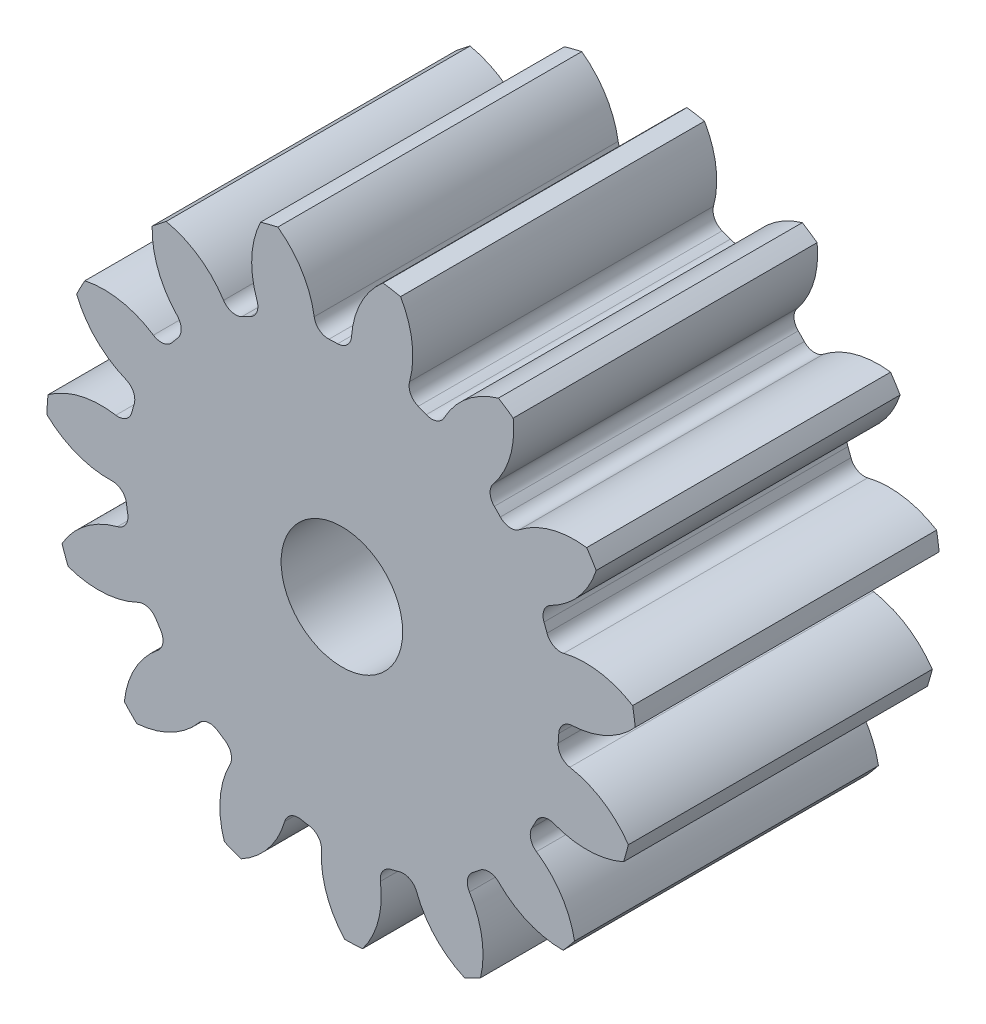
ISO-10303-21;
HEADER;
FILE_DESCRIPTION(('STEP AP214'),'2;1');
FILE_NAME('part.step','',(''),(''),'','','');
FILE_SCHEMA(('AUTOMOTIVE_DESIGN { 1 0 10303 214 1 1 1 1 }'));
ENDSEC;
DATA;
#1=APPLICATION_CONTEXT('core data for automotive mechanical design processes');
#2=APPLICATION_PROTOCOL_DEFINITION('international standard','automotive_design',2000,#1);
#3=PRODUCT_CONTEXT('',#1,'mechanical');
#4=PRODUCT('Part','Part','',(#3));
#5=PRODUCT_RELATED_PRODUCT_CATEGORY('part','',(#4));
#6=PRODUCT_DEFINITION_FORMATION('','',#4);
#7=PRODUCT_DEFINITION_CONTEXT('part definition',#1,'design');
#8=PRODUCT_DEFINITION('design','',#6,#7);
#9=PRODUCT_DEFINITION_SHAPE('','',#8);
#10=(LENGTH_UNIT() NAMED_UNIT(*) SI_UNIT(.MILLI.,.METRE.));
#11=(NAMED_UNIT(*) PLANE_ANGLE_UNIT() SI_UNIT($,.RADIAN.));
#12=(NAMED_UNIT(*) SI_UNIT($,.STERADIAN.) SOLID_ANGLE_UNIT());
#13=UNCERTAINTY_MEASURE_WITH_UNIT(LENGTH_MEASURE(1.E-05),#10,'distance_accuracy_value','');
#14=(GEOMETRIC_REPRESENTATION_CONTEXT(3) GLOBAL_UNCERTAINTY_ASSIGNED_CONTEXT((#13)) GLOBAL_UNIT_ASSIGNED_CONTEXT((#10,
#11,#12)) REPRESENTATION_CONTEXT('',''));
#15=CARTESIAN_POINT('',(0.,0.,0.));
#16=DIRECTION('',(0.,0.,1.));
#17=DIRECTION('',(1.,0.,0.));
#18=AXIS2_PLACEMENT_3D('',#15,#16,#17);
#19=CARTESIAN_POINT('',(0.,0.,88.9));
#20=DIRECTION('',(0.,0.,-1.));
#21=DIRECTION('',(-1.,0.,0.));
#22=AXIS2_PLACEMENT_3D('',#19,#20,#21);
#23=CYLINDRICAL_SURFACE('',#22,86.36);
#24=DIRECTION('',(0.,0.,-1.));
#25=VECTOR('',#24,1.);
#26=CARTESIAN_POINT('',(85.0495620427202,14.9873812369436,44.45));
#27=LINE('',#26,#25);
#28=CARTESIAN_POINT('',(85.0495620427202,14.9873812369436,88.9));
#29=VERTEX_POINT('',#28);
#30=CARTESIAN_POINT('',(85.0495620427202,14.9873812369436,0.));
#31=VERTEX_POINT('',#30);
#32=EDGE_CURVE('E636',#29,#31,#27,.T.);
#33=ORIENTED_EDGE('',*,*,#32,.F.);
#34=CARTESIAN_POINT('',(0.,0.,88.9));
#35=DIRECTION('',(0.,0.,1.));
#36=DIRECTION('',(1.,0.,0.));
#37=AXIS2_PLACEMENT_3D('',#34,#35,#36);
#38=CIRCLE('',#37,86.36);
#39=CARTESIAN_POINT('',(85.7987154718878,9.83005713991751,88.9));
#40=VERTEX_POINT('',#39);
#41=EDGE_CURVE('E1167',#40,#29,#38,.T.);
#42=ORIENTED_EDGE('',*,*,#41,.F.);
#43=DIRECTION('',(0.,0.,-1.));
#44=VECTOR('',#43,1.);
#45=CARTESIAN_POINT('',(85.7987154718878,9.83005713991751,44.45));
#46=LINE('',#45,#44);
#47=CARTESIAN_POINT('',(85.7987154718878,9.83005713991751,0.));
#48=VERTEX_POINT('',#47);
#49=EDGE_CURVE('E1161',#48,#40,#46,.F.);
#50=ORIENTED_EDGE('',*,*,#49,.F.);
#51=CARTESIAN_POINT('',(0.,0.,0.));
#52=DIRECTION('',(0.,0.,1.));
#53=DIRECTION('',(1.,0.,0.));
#54=AXIS2_PLACEMENT_3D('',#51,#52,#53);
#55=CIRCLE('',#54,86.36);
#56=EDGE_CURVE('E1172',#48,#31,#55,.T.);
#57=ORIENTED_EDGE('',*,*,#56,.T.);
#58=EDGE_LOOP('',(#33,#42,#50,#57));
#59=FACE_BOUND('',#58,.T.);
#60=ADVANCED_FACE('F33',(#59),#23,.T.);
#61=DIRECTION('',(0.,0.,-1.));
#62=VECTOR('',#61,1.);
#63=CARTESIAN_POINT('',(74.3827823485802,43.8776855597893,44.45));
#64=LINE('',#63,#62);
#65=CARTESIAN_POINT('',(74.3827823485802,43.8776855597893,0.));
#66=VERTEX_POINT('',#65);
#67=CARTESIAN_POINT('',(74.3827823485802,43.8776855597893,88.9));
#68=VERTEX_POINT('',#67);
#69=EDGE_CURVE('E607',#66,#68,#64,.F.);
#70=ORIENTED_EDGE('',*,*,#69,.F.);
#71=CARTESIAN_POINT('',(71.6007239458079,48.2844274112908,0.));
#72=VERTEX_POINT('',#71);
#73=EDGE_CURVE('E1175',#66,#72,#55,.T.);
#74=ORIENTED_EDGE('',*,*,#73,.T.);
#75=DIRECTION('',(0.,0.,-1.));
#76=VECTOR('',#75,1.);
#77=CARTESIAN_POINT('',(71.6007239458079,48.2844274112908,44.45));
#78=LINE('',#77,#76);
#79=CARTESIAN_POINT('',(71.6007239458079,48.2844274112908,88.9));
#80=VERTEX_POINT('',#79);
#81=EDGE_CURVE('E669',#80,#72,#78,.T.);
#82=ORIENTED_EDGE('',*,*,#81,.F.);
#83=EDGE_CURVE('E1170',#68,#80,#38,.T.);
#84=ORIENTED_EDGE('',*,*,#83,.F.);
#85=EDGE_LOOP('',(#70,#74,#82,#84));
#86=FACE_BOUND('',#85,.T.);
#87=ADVANCED_FACE('F1346',(#86),#23,.T.);
#88=CARTESIAN_POINT('',(0.,0.,88.9));
#89=DIRECTION('',(0.,0.,1.));
#90=DIRECTION('',(1.,0.,0.));
#91=AXIS2_PLACEMENT_3D('',#88,#89,#90);
#92=PLANE('',#91);
#93=CARTESIAN_POINT('',(0.,0.,88.9000000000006));
#94=DIRECTION('',(0.,0.,1.));
#95=DIRECTION('',(1.,0.,0.));
#96=AXIS2_PLACEMENT_3D('',#93,#94,#95);
#97=CIRCLE('',#96,17.78);
#98=CARTESIAN_POINT('',(17.78,0.,88.9000000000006));
#99=VERTEX_POINT('',#98);
#100=EDGE_CURVE('E624',#99,#99,#97,.T.);
#101=ORIENTED_EDGE('',*,*,#100,.F.);
#102=EDGE_LOOP('',(#101));
#103=FACE_BOUND('',#102,.T.);
#104=ORIENTED_EDGE('',*,*,#41,.T.);
#105=CARTESIAN_POINT('',(71.2162250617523,-7.44747179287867,88.9));
#106=DIRECTION('',(0.,0.,-1.));
#107=DIRECTION('',(0.913545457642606,0.406736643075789,0.));
#108=AXIS2_PLACEMENT_3D('',#105,#106,#107);
#109=CIRCLE('',#108,26.356855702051);
#110=CARTESIAN_POINT('',(64.8953551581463,18.1402292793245,88.9));
#111=VERTEX_POINT('',#110);
#112=EDGE_CURVE('E616',#111,#29,#109,.T.);
#113=ORIENTED_EDGE('',*,*,#112,.F.);
#114=CARTESIAN_POINT('',(63.9036755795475,22.1546768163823,88.9));
#115=DIRECTION('',(0.,0.,1.));
#116=DIRECTION('',(-0.913545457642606,-0.406736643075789,0.));
#117=AXIS2_PLACEMENT_3D('',#114,#115,#116);
#118=CIRCLE('',#117,4.13512);
#119=CARTESIAN_POINT('',(59.9966910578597,20.8001697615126,88.9));
#120=VERTEX_POINT('',#119);
#121=EDGE_CURVE('E614',#120,#111,#118,.T.);
#122=ORIENTED_EDGE('',*,*,#121,.F.);
#123=CARTESIAN_POINT('',(0.,0.,88.9));
#124=DIRECTION('',(0.,0.,-1.));
#125=DIRECTION('',(0.913545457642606,0.406736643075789,0.));
#126=AXIS2_PLACEMENT_3D('',#123,#124,#125);
#127=CIRCLE('',#126,63.5);
#128=CARTESIAN_POINT('',(59.1183570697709,23.1790823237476,88.9));
#129=VERTEX_POINT('',#128);
#130=EDGE_CURVE('E599',#129,#120,#127,.T.);
#131=ORIENTED_EDGE('',*,*,#130,.F.);
#132=CARTESIAN_POINT('',(62.9681444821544,24.68850416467,88.9));
#133=DIRECTION('',(0.,0.,1.));
#134=DIRECTION('',(-0.913545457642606,-0.406736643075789,0.));
#135=AXIS2_PLACEMENT_3D('',#132,#133,#134);
#136=CIRCLE('',#135,4.13512);
#137=CARTESIAN_POINT('',(61.1131153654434,28.3841887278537,88.9));
#138=VERTEX_POINT('',#137);
#139=EDGE_CURVE('E591',#138,#129,#136,.T.);
#140=ORIENTED_EDGE('',*,*,#139,.F.);
#141=CARTESIAN_POINT('',(49.2893388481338,51.9401253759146,88.9));
#142=DIRECTION('',(0.,0.,-1.));
#143=DIRECTION('',(-0.913545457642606,-0.406736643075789,0.));
#144=AXIS2_PLACEMENT_3D('',#141,#142,#143);
#145=CIRCLE('',#144,26.356855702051);
#146=EDGE_CURVE('E621',#68,#138,#145,.T.);
#147=ORIENTED_EDGE('',*,*,#146,.F.);
#148=ORIENTED_EDGE('',*,*,#83,.T.);
#149=CARTESIAN_POINT('',(68.0884185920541,22.1626442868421,88.9));
#150=DIRECTION('',(0.,0.,-1.));
#151=DIRECTION('',(0.669130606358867,0.743144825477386,0.));
#152=AXIS2_PLACEMENT_3D('',#149,#150,#151);
#153=CIRCLE('',#152,26.356855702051);
#154=CARTESIAN_POINT('',(51.9065609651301,42.9672429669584,88.9));
#155=VERTEX_POINT('',#154);
#156=EDGE_CURVE('E645',#155,#80,#153,.T.);
#157=ORIENTED_EDGE('',*,*,#156,.F.);
#158=CARTESIAN_POINT('',(49.3677936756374,46.2312708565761,88.9));
#159=DIRECTION('',(0.,0.,1.));
#160=DIRECTION('',(-0.669130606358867,-0.743144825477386,0.));
#161=AXIS2_PLACEMENT_3D('',#158,#159,#160);
#162=CIRCLE('',#161,4.13512);
#163=CARTESIAN_POINT('',(46.3495133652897,43.4047533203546,88.9));
#164=VERTEX_POINT('',#163);
#165=EDGE_CURVE('E643',#164,#155,#162,.T.);
#166=ORIENTED_EDGE('',*,*,#165,.F.);
#167=CARTESIAN_POINT('',(0.,0.,88.9));
#168=DIRECTION('',(0.,0.,-1.));
#169=DIRECTION('',(0.669130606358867,0.743144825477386,0.));
#170=AXIS2_PLACEMENT_3D('',#167,#168,#169);
#171=CIRCLE('',#170,63.5);
#172=CARTESIAN_POINT('',(44.5795244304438,45.2207474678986,88.9));
#173=VERTEX_POINT('',#172);
#174=EDGE_CURVE('E640',#173,#164,#171,.T.);
#175=ORIENTED_EDGE('',*,*,#174,.F.);
#176=CARTESIAN_POINT('',(47.4825430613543,48.1655225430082,88.9));
#177=DIRECTION('',(0.,0.,1.));
#178=DIRECTION('',(-0.669130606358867,-0.743144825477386,0.));
#179=AXIS2_PLACEMENT_3D('',#176,#177,#178);
#180=CIRCLE('',#179,4.13512);
#181=CARTESIAN_POINT('',(44.2847193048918,50.7871900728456,88.9));
#182=VERTEX_POINT('',#181);
#183=EDGE_CURVE('E638',#182,#173,#180,.T.);
#184=ORIENTED_EDGE('',*,*,#183,.F.);
#185=CARTESIAN_POINT('',(23.9020993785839,67.4974458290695,88.9));
#186=DIRECTION('',(0.,0.,-1.));
#187=DIRECTION('',(-0.669130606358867,-0.743144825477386,0.));
#188=AXIS2_PLACEMENT_3D('',#185,#186,#187);
#189=CIRCLE('',#188,26.356855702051);
#190=CARTESIAN_POINT('',(50.1053904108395,70.3384635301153,88.9));
#191=VERTEX_POINT('',#190);
#192=EDGE_CURVE('E648',#191,#182,#189,.T.);
#193=ORIENTED_EDGE('',*,*,#192,.F.);
#194=CARTESIAN_POINT('',(45.7714702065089,73.2326574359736,88.9));
#195=VERTEX_POINT('',#194);
#196=EDGE_CURVE('E1213',#191,#195,#38,.T.);
#197=ORIENTED_EDGE('',*,*,#196,.T.);
#198=CARTESIAN_POINT('',(53.1875059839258,47.9406378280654,88.9));
#199=DIRECTION('',(0.,0.,-1.));
#200=DIRECTION('',(0.309016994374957,0.95105651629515,0.));
#201=AXIS2_PLACEMENT_3D('',#198,#199,#200);
#202=CIRCLE('',#201,26.356855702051);
#203=CARTESIAN_POINT('',(29.9426508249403,60.3648300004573,88.9));
#204=VERTEX_POINT('',#203);
#205=EDGE_CURVE('E680',#204,#195,#202,.T.);
#206=ORIENTED_EDGE('',*,*,#205,.F.);
#207=CARTESIAN_POINT('',(26.2957717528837,62.3140581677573,88.9));
#208=DIRECTION('',(0.,0.,1.));
#209=DIRECTION('',(-0.309016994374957,-0.95105651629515,0.));
#210=AXIS2_PLACEMENT_3D('',#207,#208,#209);
#211=CIRCLE('',#210,4.13512);
#212=CARTESIAN_POINT('',(24.6880837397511,58.5042607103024,88.9));
#213=VERTEX_POINT('',#212);
#214=EDGE_CURVE('E678',#213,#204,#211,.T.);
#215=ORIENTED_EDGE('',*,*,#214,.F.);
#216=CARTESIAN_POINT('',(0.,0.,88.9));
#217=DIRECTION('',(0.,0.,-1.));
#218=DIRECTION('',(0.309016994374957,0.95105651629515,0.));
#219=AXIS2_PLACEMENT_3D('',#216,#217,#218);
#220=CIRCLE('',#219,63.5);
#221=CARTESIAN_POINT('',(22.3324870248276,59.4433345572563,88.9));
#222=VERTEX_POINT('',#221);
#223=EDGE_CURVE('E675',#222,#213,#220,.T.);
#224=ORIENTED_EDGE('',*,*,#223,.F.);
#225=CARTESIAN_POINT('',(23.7867785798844,63.3142845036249,88.9));
#226=DIRECTION('',(0.,0.,1.));
#227=DIRECTION('',(-0.309016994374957,-0.95105651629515,0.));
#228=AXIS2_PLACEMENT_3D('',#225,#226,#227);
#229=CIRCLE('',#228,4.13512);
#230=CARTESIAN_POINT('',(19.7990929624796,64.4086248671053,88.9));
#231=VERTEX_POINT('',#230);
#232=EDGE_CURVE('E673',#231,#222,#229,.T.);
#233=ORIENTED_EDGE('',*,*,#232,.F.);
#234=CARTESIAN_POINT('',(-5.61803021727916,71.3838447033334,88.9));
#235=DIRECTION('',(0.,0.,-1.));
#236=DIRECTION('',(-0.309016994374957,-0.95105651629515,0.));
#237=AXIS2_PLACEMENT_3D('',#234,#235,#236);
#238=CIRCLE('',#237,26.356855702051);
#239=CARTESIAN_POINT('',(17.1643212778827,84.6370821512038,88.9));
#240=VERTEX_POINT('',#239);
#241=EDGE_CURVE('E683',#240,#231,#238,.T.);
#242=ORIENTED_EDGE('',*,*,#241,.F.);
#243=CARTESIAN_POINT('',(12.0279134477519,85.5182956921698,88.9));
#244=VERTEX_POINT('',#243);
#245=EDGE_CURVE('E1328',#240,#244,#38,.T.);
#246=ORIENTED_EDGE('',*,*,#245,.T.);
#247=CARTESIAN_POINT('',(29.0899903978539,65.4292595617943,88.9));
#248=DIRECTION('',(0.,0.,-1.));
#249=DIRECTION('',(-0.104528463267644,0.994521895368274,0.));
#250=AXIS2_PLACEMENT_3D('',#247,#248,#249);
#251=CIRCLE('',#250,26.356855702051);
#252=CARTESIAN_POINT('',(2.80138433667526,67.3247895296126,88.9));
#253=VERTEX_POINT('',#252);
#254=EDGE_CURVE('E718',#253,#244,#251,.T.);
#255=ORIENTED_EDGE('',*,*,#254,.F.);
#256=CARTESIAN_POINT('',(-1.32302799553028,67.6221787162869,88.9));
#257=DIRECTION('',(0.,0.,1.));
#258=DIRECTION('',(0.104528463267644,-0.994521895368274,0.));
#259=AXIS2_PLACEMENT_3D('',#256,#257,#258);
#260=CIRCLE('',#259,4.13512);
#261=CARTESIAN_POINT('',(-1.24213984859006,63.4878499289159,88.9));
#262=VERTEX_POINT('',#261);
#263=EDGE_CURVE('E716',#262,#253,#260,.T.);
#264=ORIENTED_EDGE('',*,*,#263,.F.);
#265=CARTESIAN_POINT('',(0.,0.,88.9));
#266=DIRECTION('',(0.,0.,-1.));
#267=DIRECTION('',(-0.104528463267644,0.994521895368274,0.));
#268=AXIS2_PLACEMENT_3D('',#265,#266,#267);
#269=CIRCLE('',#268,63.5);
#270=CARTESIAN_POINT('',(-3.77604027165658,63.3876290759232,88.9));
#271=VERTEX_POINT('',#270);
#272=EDGE_CURVE('E713',#271,#262,#269,.T.);
#273=ORIENTED_EDGE('',*,*,#272,.F.);
#274=CARTESIAN_POINT('',(-4.02193601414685,67.5154314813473,88.9));
#275=DIRECTION('',(0.,0.,1.));
#276=DIRECTION('',(0.104528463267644,-0.994521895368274,0.));
#277=AXIS2_PLACEMENT_3D('',#274,#275,#276);
#278=CIRCLE('',#277,4.13512);
#279=CARTESIAN_POINT('',(-8.10997642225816,66.893223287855,88.9));
#280=VERTEX_POINT('',#279);
#281=EDGE_CURVE('E711',#280,#271,#278,.T.);
#282=ORIENTED_EDGE('',*,*,#281,.F.);
#283=CARTESIAN_POINT('',(-34.1667513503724,62.9273283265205,88.9));
#284=DIRECTION('',(0.,0.,-1.));
#285=DIRECTION('',(0.104528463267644,-0.994521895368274,0.));
#286=AXIS2_PLACEMENT_3D('',#283,#284,#285);
#287=CIRCLE('',#286,26.356855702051);
#288=CARTESIAN_POINT('',(-18.7446149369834,84.3011803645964,88.9));
#289=VERTEX_POINT('',#288);
#290=EDGE_CURVE('E721',#289,#280,#287,.T.);
#291=ORIENTED_EDGE('',*,*,#290,.F.);
#292=CARTESIAN_POINT('',(-23.7953788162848,83.0170437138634,88.9));
#293=VERTEX_POINT('',#292);
#294=EDGE_CURVE('E1324',#289,#293,#38,.T.);
#295=ORIENTED_EDGE('',*,*,#294,.T.);
#296=CARTESIAN_POINT('',(-0.0374488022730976,71.6045679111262,88.9));
#297=DIRECTION('',(0.,0.,-1.));
#298=DIRECTION('',(-0.499999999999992,0.866025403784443,0.));
#299=AXIS2_PLACEMENT_3D('',#296,#297,#298);
#300=CIRCLE('',#299,26.356855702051);
#301=CARTESIAN_POINT('',(-24.8242669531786,62.6436813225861,88.9));
#302=VERTEX_POINT('',#301);
#303=EDGE_CURVE('E756',#302,#293,#300,.T.);
#304=ORIENTED_EDGE('',*,*,#303,.F.);
#305=CARTESIAN_POINT('',(-28.7130641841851,61.2378102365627,88.9));
#306=DIRECTION('',(0.,0.,1.));
#307=DIRECTION('',(0.499999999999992,-0.866025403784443,0.));
#308=AXIS2_PLACEMENT_3D('',#305,#306,#307);
#309=CIRCLE('',#308,4.13512);
#310=CARTESIAN_POINT('',(-26.9575861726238,57.49381312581,88.9));
#311=VERTEX_POINT('',#310);
#312=EDGE_CURVE('E754',#311,#302,#309,.T.);
#313=ORIENTED_EDGE('',*,*,#312,.F.);
#314=CARTESIAN_POINT('',(0.,0.,88.9));
#315=DIRECTION('',(0.,0.,-1.));
#316=DIRECTION('',(-0.499999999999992,0.866025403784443,0.));
#317=AXIS2_PLACEMENT_3D('',#314,#315,#316);
#318=CIRCLE('',#317,63.5);
#319=CARTESIAN_POINT('',(-29.2316559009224,56.3716266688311,88.9));
#320=VERTEX_POINT('',#319);
#321=EDGE_CURVE('E751',#320,#311,#318,.T.);
#322=ORIENTED_EDGE('',*,*,#321,.F.);
#323=CARTESIAN_POINT('',(-31.1352213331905,60.0425469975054,88.9));
#324=DIRECTION('',(0.,0.,1.));
#325=DIRECTION('',(0.499999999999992,-0.866025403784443,0.));
#326=AXIS2_PLACEMENT_3D('',#323,#324,#325);
#327=CIRCLE('',#326,4.13512);
#328=CARTESIAN_POINT('',(-34.6167572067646,57.811375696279,88.9));
#329=VERTEX_POINT('',#328);
#330=EDGE_CURVE('E749',#329,#320,#327,.T.);
#331=ORIENTED_EDGE('',*,*,#330,.F.);
#332=CARTESIAN_POINT('',(-56.8077307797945,43.5901052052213,88.9));
#333=DIRECTION('',(0.,0.,-1.));
#334=DIRECTION('',(0.499999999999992,-0.866025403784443,0.));
#335=AXIS2_PLACEMENT_3D('',#332,#333,#334);
#336=CIRCLE('',#335,26.356855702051);
#337=CARTESIAN_POINT('',(-51.4124369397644,69.3888386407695,88.9));
#338=VERTEX_POINT('',#337);
#339=EDGE_CURVE('E759',#338,#329,#336,.T.);
#340=ORIENTED_EDGE('',*,*,#339,.F.);
#341=CARTESIAN_POINT('',(-55.5042339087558,66.1613906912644,88.9));
#342=VERTEX_POINT('',#341);
#343=EDGE_CURVE('E1320',#338,#342,#38,.T.);
#344=ORIENTED_EDGE('',*,*,#343,.T.);
#345=CARTESIAN_POINT('',(-29.1584127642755,65.3987959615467,88.9));
#346=DIRECTION('',(0.,0.,-1.));
#347=DIRECTION('',(-0.809016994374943,0.58778525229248,0.));
#348=AXIS2_PLACEMENT_3D('',#345,#346,#347);
#349=CIRCLE('',#348,26.356855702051);
#350=CARTESIAN_POINT('',(-48.1575769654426,47.1309115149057,88.9));
#351=VERTEX_POINT('',#350);
#352=EDGE_CURVE('E794',#351,#342,#349,.T.);
#353=ORIENTED_EDGE('',*,*,#352,.F.);
#354=CARTESIAN_POINT('',(-51.1383507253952,44.264868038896,88.9));
#355=DIRECTION('',(0.,0.,1.));
#356=DIRECTION('',(0.809016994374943,-0.58778525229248,0.));
#357=AXIS2_PLACEMENT_3D('',#354,#355,#356);
#358=CIRCLE('',#357,4.13512);
#359=CARTESIAN_POINT('',(-48.0118209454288,41.5585737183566,88.9));
#360=VERTEX_POINT('',#359);
#361=EDGE_CURVE('E792',#360,#351,#358,.T.);
#362=ORIENTED_EDGE('',*,*,#361,.F.);
#363=CARTESIAN_POINT('',(0.,0.,88.9));
#364=DIRECTION('',(0.,0.,-1.));
#365=DIRECTION('',(-0.809016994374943,0.58778525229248,0.));
#366=AXIS2_PLACEMENT_3D('',#363,#364,#365);
#367=CIRCLE('',#366,63.5);
#368=CARTESIAN_POINT('',(-49.6328526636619,39.608457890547,88.9));
#369=VERTEX_POINT('',#368);
#370=EDGE_CURVE('E789',#369,#360,#367,.T.);
#371=ORIENTED_EDGE('',*,*,#370,.F.);
#372=CARTESIAN_POINT('',(-52.8649440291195,42.1877606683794,88.9));
#373=DIRECTION('',(0.,0.,1.));
#374=DIRECTION('',(0.809016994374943,-0.58778525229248,0.));
#375=AXIS2_PLACEMENT_3D('',#372,#373,#374);
#376=CIRCLE('',#375,4.13512);
#377=CARTESIAN_POINT('',(-55.137986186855,38.733416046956,88.9));
#378=VERTEX_POINT('',#377);
#379=EDGE_CURVE('E787',#378,#369,#376,.T.);
#380=ORIENTED_EDGE('',*,*,#379,.F.);
#381=CARTESIAN_POINT('',(-69.6261374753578,16.7157568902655,88.9));
#382=DIRECTION('',(0.,0.,-1.));
#383=DIRECTION('',(0.809016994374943,-0.58778525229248,0.));
#384=AXIS2_PLACEMENT_3D('',#381,#382,#383);
#385=CIRCLE('',#384,26.356855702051);
#386=CARTESIAN_POINT('',(-75.1905815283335,42.4785363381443,88.9));
#387=VERTEX_POINT('',#386);
#388=EDGE_CURVE('E797',#387,#378,#385,.T.);
#389=ORIENTED_EDGE('',*,*,#388,.F.);
#390=CARTESIAN_POINT('',(-77.6159027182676,37.8658321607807,88.9));
#391=VERTEX_POINT('',#390);
#392=EDGE_CURVE('E1316',#387,#391,#38,.T.);
#393=ORIENTED_EDGE('',*,*,#392,.T.);
#394=CARTESIAN_POINT('',(-53.2376222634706,47.8849780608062,88.9));
#395=DIRECTION('',(0.,0.,-1.));
#396=DIRECTION('',(-0.978147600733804,0.207911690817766,0.));
#397=AXIS2_PLACEMENT_3D('',#394,#395,#396);
#398=CIRCLE('',#397,26.356855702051);
#399=CARTESIAN_POINT('',(-63.1640044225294,23.4687789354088,88.9));
#400=VERTEX_POINT('',#399);
#401=EDGE_CURVE('E832',#400,#391,#398,.T.);
#402=ORIENTED_EDGE('',*,*,#401,.F.);
#403=CARTESIAN_POINT('',(-64.7213518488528,19.6381280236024,88.9));
#404=DIRECTION('',(0.,0.,1.));
#405=DIRECTION('',(0.978147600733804,-0.207911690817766,0.));
#406=AXIS2_PLACEMENT_3D('',#403,#404,#405);
#407=CIRCLE('',#406,4.13512);
#408=CARTESIAN_POINT('',(-60.764375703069,18.4374793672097,88.9));
#409=VERTEX_POINT('',#408);
#410=EDGE_CURVE('E830',#409,#400,#407,.T.);
#411=ORIENTED_EDGE('',*,*,#410,.F.);
#412=CARTESIAN_POINT('',(0.,0.,88.9));
#413=DIRECTION('',(0.,0.,-1.));
#414=DIRECTION('',(-0.978147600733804,0.207911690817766,0.));
#415=AXIS2_PLACEMENT_3D('',#412,#413,#414);
#416=CIRCLE('',#415,63.5);
#417=CARTESIAN_POINT('',(-61.4520783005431,15.9966269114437,88.9));
#418=VERTEX_POINT('',#417);
#419=EDGE_CURVE('E827',#418,#409,#416,.T.);
#420=ORIENTED_EDGE('',*,*,#419,.F.);
#421=CARTESIAN_POINT('',(-65.4538376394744,17.038327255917,88.9));
#422=DIRECTION('',(0.,0.,1.));
#423=DIRECTION('',(0.978147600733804,-0.207911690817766,0.));
#424=AXIS2_PLACEMENT_3D('',#421,#422,#423);
#425=CIRCLE('',#424,4.13512);
#426=CARTESIAN_POINT('',(-66.1253564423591,12.9580968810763,88.9));
#427=VERTEX_POINT('',#426);
#428=EDGE_CURVE('E825',#427,#418,#425,.T.);
#429=ORIENTED_EDGE('',*,*,#428,.F.);
#430=CARTESIAN_POINT('',(-70.4055524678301,-13.0488976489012,88.9));
#431=DIRECTION('',(0.,0.,-1.));
#432=DIRECTION('',(0.978147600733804,-0.207911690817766,0.));
#433=AXIS2_PLACEMENT_3D('',#430,#431,#432);
#434=CIRCLE('',#433,26.356855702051);
#435=CARTESIAN_POINT('',(-85.9675914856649,8.22330919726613,88.9));
#436=VERTEX_POINT('',#435);
#437=EDGE_CURVE('E835',#436,#427,#434,.T.);
#438=ORIENTED_EDGE('',*,*,#437,.F.);
#439=CARTESIAN_POINT('',(-86.307076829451,3.02292724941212,88.9));
#440=VERTEX_POINT('',#439);
#441=EDGE_CURVE('E1312',#436,#440,#38,.T.);
#442=ORIENTED_EDGE('',*,*,#441,.T.);
#443=CARTESIAN_POINT('',(-68.1115632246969,22.0914124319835,88.9));
#444=DIRECTION('',(0.,0.,-1.));
#445=DIRECTION('',(-0.978147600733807,-0.207911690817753,0.));
#446=AXIS2_PLACEMENT_3D('',#443,#444,#445);
#447=CIRCLE('',#446,26.356855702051);
#448=CARTESIAN_POINT('',(-67.2488016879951,-4.25131872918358,88.9));
#449=VERTEX_POINT('',#448);
#450=EDGE_CURVE('E870',#449,#440,#447,.T.);
#451=ORIENTED_EDGE('',*,*,#450,.F.);
#452=CARTESIAN_POINT('',(-67.1134432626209,-8.3842227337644,88.9));
#453=DIRECTION('',(0.,0.,1.));
#454=DIRECTION('',(0.978147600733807,0.207911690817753,0.));
#455=AXIS2_PLACEMENT_3D('',#452,#453,#454);
#456=CIRCLE('',#455,4.13512);
#457=CARTESIAN_POINT('',(-63.0102178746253,-7.87162266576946,88.9));
#458=VERTEX_POINT('',#457);
#459=EDGE_CURVE('E868',#458,#449,#456,.T.);
#460=ORIENTED_EDGE('',*,*,#459,.F.);
#461=CARTESIAN_POINT('',(0.,0.,88.9));
#462=DIRECTION('',(0.,0.,-1.));
#463=DIRECTION('',(-0.978147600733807,-0.207911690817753,0.));
#464=AXIS2_PLACEMENT_3D('',#461,#462,#463);
#465=CIRCLE('',#464,63.5);
#466=CARTESIAN_POINT('',(-62.6456813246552,-10.3811661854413,88.9));
#467=VERTEX_POINT('',#466);
#468=EDGE_CURVE('E865',#467,#458,#465,.T.);
#469=ORIENTED_EDGE('',*,*,#468,.F.);
#470=CARTESIAN_POINT('',(-66.7251680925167,-11.0571877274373,88.9));
#471=DIRECTION('',(0.,0.,1.));
#472=DIRECTION('',(0.978147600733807,0.207911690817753,0.));
#473=AXIS2_PLACEMENT_3D('',#470,#471,#472);
#474=CIRCLE('',#473,4.13512);
#475=CARTESIAN_POINT('',(-65.679051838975,-15.0577949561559,88.9));
#476=VERTEX_POINT('',#475);
#477=EDGE_CURVE('E863',#476,#467,#474,.T.);
#478=ORIENTED_EDGE('',*,*,#477,.F.);
#479=CARTESIAN_POINT('',(-59.0112078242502,-40.5572792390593,88.9));
#480=DIRECTION('',(0.,0.,-1.));
#481=DIRECTION('',(0.978147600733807,0.207911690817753,0.));
#482=AXIS2_PLACEMENT_3D('',#479,#480,#481);
#483=CIRCLE('',#482,26.356855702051);
#484=CARTESIAN_POINT('',(-81.8800238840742,-27.4538028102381,88.9));
#485=VERTEX_POINT('',#484);
#486=EDGE_CURVE('E873',#485,#476,#483,.T.);
#487=ORIENTED_EDGE('',*,*,#486,.F.);
#488=CARTESIAN_POINT('',(-80.0749732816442,-32.3426692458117,88.9));
#489=VERTEX_POINT('',#488);
#490=EDGE_CURVE('E1308',#485,#489,#38,.T.);
#491=ORIENTED_EDGE('',*,*,#490,.T.);
#492=CARTESIAN_POINT('',(-71.2083961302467,-7.52195910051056,88.9));
#493=DIRECTION('',(0.,0.,-1.));
#494=DIRECTION('',(-0.80901699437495,-0.587785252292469,0.));
#495=AXIS2_PLACEMENT_3D('',#492,#493,#494);
#496=CIRCLE('',#495,26.356855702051);
#497=CARTESIAN_POINT('',(-59.7056702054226,-31.236324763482,88.9));
#498=VERTEX_POINT('',#497);
#499=EDGE_CURVE('E908',#498,#489,#496,.T.);
#500=ORIENTED_EDGE('',*,*,#499,.F.);
#501=CARTESIAN_POINT('',(-57.9010106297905,-34.9568652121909,88.9));
#502=DIRECTION('',(0.,0.,1.));
#503=DIRECTION('',(0.80901699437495,0.587785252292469,0.));
#504=AXIS2_PLACEMENT_3D('',#501,#502,#503);
#505=CIRCLE('',#504,4.13512);
#506=CARTESIAN_POINT('',(-54.3610209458,-32.8196496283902,88.9));
#507=VERTEX_POINT('',#506);
#508=EDGE_CURVE('E906',#507,#498,#505,.T.);
#509=ORIENTED_EDGE('',*,*,#508,.F.);
#510=CARTESIAN_POINT('',(0.,0.,88.9));
#511=DIRECTION('',(0.,0.,-1.));
#512=DIRECTION('',(-0.80901699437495,-0.587785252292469,0.));
#513=AXIS2_PLACEMENT_3D('',#510,#511,#512);
#514=CIRCLE('',#513,63.5);
#515=CARTESIAN_POINT('',(-53.0072769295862,-34.9639613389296,88.9));
#516=VERTEX_POINT('',#515);
#517=EDGE_CURVE('E903',#516,#507,#514,.T.);
#518=ORIENTED_EDGE('',*,*,#517,.F.);
#519=CARTESIAN_POINT('',(-56.4591108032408,-37.2408145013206,88.9));
#520=DIRECTION('',(0.,0.,1.));
#521=DIRECTION('',(0.80901699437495,0.587785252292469,0.));
#522=AXIS2_PLACEMENT_3D('',#519,#520,#521);
#523=CIRCLE('',#522,4.13512);
#524=CARTESIAN_POINT('',(-53.8762424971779,-40.4700572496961,88.9));
#525=VERTEX_POINT('',#524);
#526=EDGE_CURVE('E901',#525,#516,#523,.T.);
#527=ORIENTED_EDGE('',*,*,#526,.F.);
#528=CARTESIAN_POINT('',(-37.4132892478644,-61.0529387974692,88.9));
#529=DIRECTION('',(0.,0.,-1.));
#530=DIRECTION('',(0.80901699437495,0.587785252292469,0.));
#531=AXIS2_PLACEMENT_3D('',#528,#529,#530);
#532=CIRCLE('',#531,26.356855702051);
#533=CARTESIAN_POINT('',(-63.6346562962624,-58.3839029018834,88.9));
#534=VERTEX_POINT('',#533);
#535=EDGE_CURVE('E911',#534,#525,#532,.T.);
#536=ORIENTED_EDGE('',*,*,#535,.F.);
#537=CARTESIAN_POINT('',(-59.9971793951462,-62.1159244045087,88.9));
#538=VERTEX_POINT('',#537);
#539=EDGE_CURVE('E1304',#534,#538,#38,.T.);
#540=ORIENTED_EDGE('',*,*,#539,.T.);
#541=CARTESIAN_POINT('',(-61.9926504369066,-35.8347155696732,88.9));
#542=DIRECTION('',(0.,0.,-1.));
#543=DIRECTION('',(-0.500000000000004,-0.866025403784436,0.));
#544=AXIS2_PLACEMENT_3D('',#541,#542,#543);
#545=CIRCLE('',#544,26.356855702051);
#546=CARTESIAN_POINT('',(-41.8388859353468,-52.8202864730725,88.9));
#547=VERTEX_POINT('',#546);
#548=EDGE_CURVE('E946',#547,#538,#545,.T.);
#549=ORIENTED_EDGE('',*,*,#548,.F.);
#550=CARTESIAN_POINT('',(-38.6769672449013,-55.485148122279,88.9));
#551=DIRECTION('',(0.,0.,1.));
#552=DIRECTION('',(0.500000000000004,0.866025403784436,0.));
#553=AXIS2_PLACEMENT_3D('',#550,#551,#552);
#554=CIRCLE('',#553,4.13512);
#555=CARTESIAN_POINT('',(-36.3123096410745,-52.0928610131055,88.9));
#556=VERTEX_POINT('',#555);
#557=EDGE_CURVE('E944',#556,#547,#554,.T.);
#558=ORIENTED_EDGE('',*,*,#557,.F.);
#559=CARTESIAN_POINT('',(0.,0.,88.9));
#560=DIRECTION('',(0.,0.,-1.));
#561=DIRECTION('',(-0.500000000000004,-0.866025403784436,0.));
#562=AXIS2_PLACEMENT_3D('',#559,#560,#561);
#563=CIRCLE('',#562,63.5);
#564=CARTESIAN_POINT('',(-34.2034327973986,-53.5011699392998,88.9));
#565=VERTEX_POINT('',#564);
#566=EDGE_CURVE('E941',#565,#556,#563,.T.);
#567=ORIENTED_EDGE('',*,*,#566,.F.);
#568=CARTESIAN_POINT('',(-36.4307603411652,-56.985166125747,88.9));
#569=DIRECTION('',(0.,0.,1.));
#570=DIRECTION('',(0.500000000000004,0.866025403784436,0.));
#571=AXIS2_PLACEMENT_3D('',#568,#569,#570);
#572=CIRCLE('',#571,4.13512);
#573=CARTESIAN_POINT('',(-32.7577413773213,-58.8846789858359,88.9));
#574=VERTEX_POINT('',#573);
#575=EDGE_CURVE('E939',#574,#565,#572,.T.);
#576=ORIENTED_EDGE('',*,*,#575,.F.);
#577=CARTESIAN_POINT('',(-9.34627307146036,-70.99199058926,88.9));
#578=DIRECTION('',(0.,0.,-1.));
#579=DIRECTION('',(0.500000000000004,0.866025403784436,0.));
#580=AXIS2_PLACEMENT_3D('',#577,#578,#579);
#581=CIRCLE('',#580,26.356855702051);
#582=CARTESIAN_POINT('',(-34.3862785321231,-79.2188957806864,88.9));
#583=VERTEX_POINT('',#582);
#584=EDGE_CURVE('E949',#583,#574,#581,.T.);
#585=ORIENTED_EDGE('',*,*,#584,.F.);
#586=CARTESIAN_POINT('',(-29.545328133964,-81.1487719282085,88.9));
#587=VERTEX_POINT('',#586);
#588=EDGE_CURVE('E1300',#583,#587,#38,.T.);
#589=ORIENTED_EDGE('',*,*,#588,.T.);
#590=CARTESIAN_POINT('',(-42.0578122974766,-57.9513241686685,88.9));
#591=DIRECTION('',(0.,0.,-1.));
#592=DIRECTION('',(-0.104528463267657,-0.994521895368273,0.));
#593=AXIS2_PLACEMENT_3D('',#590,#591,#592);
#594=CIRCLE('',#593,26.356855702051);
#595=CARTESIAN_POINT('',(-16.7377781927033,-65.2711407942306,88.9));
#596=VERTEX_POINT('',#595);
#597=EDGE_CURVE('E984',#596,#587,#594,.T.);
#598=ORIENTED_EDGE('',*,*,#597,.F.);
#599=CARTESIAN_POINT('',(-12.7653248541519,-66.4195448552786,88.9));
#600=DIRECTION('',(0.,0.,1.));
#601=DIRECTION('',(0.104528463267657,0.994521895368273,0.));
#602=AXIS2_PLACEMENT_3D('',#599,#600,#601);
#603=CIRCLE('',#602,4.13512);
#604=CARTESIAN_POINT('',(-11.9848701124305,-62.3587434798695,88.9));
#605=VERTEX_POINT('',#604);
#606=EDGE_CURVE('E982',#605,#596,#603,.T.);
#607=ORIENTED_EDGE('',*,*,#606,.F.);
#608=CARTESIAN_POINT('',(0.,0.,88.9));
#609=DIRECTION('',(0.,0.,-1.));
#610=DIRECTION('',(-0.104528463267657,-0.994521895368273,0.));
#611=AXIS2_PLACEMENT_3D('',#608,#609,#610);
#612=CIRCLE('',#611,63.5);
#613=CARTESIAN_POINT('',(-9.48550440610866,-62.7875402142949,88.9));
#614=VERTEX_POINT('',#613);
#615=EDGE_CURVE('E979',#614,#605,#612,.T.);
#616=ORIENTED_EDGE('',*,*,#615,.F.);
#617=CARTESIAN_POINT('',(-10.1032004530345,-66.8762648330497,88.9));
#618=DIRECTION('',(0.,0.,1.));
#619=DIRECTION('',(0.104528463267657,0.994521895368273,0.));
#620=AXIS2_PLACEMENT_3D('',#617,#618,#619);
#621=CIRCLE('',#620,4.13512);
#622=CARTESIAN_POINT('',(-5.97512917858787,-67.11760477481,88.9));
#623=VERTEX_POINT('',#622);
#624=EDGE_CURVE('E977',#623,#614,#621,.T.);
#625=ORIENTED_EDGE('',*,*,#624,.F.);
#626=CARTESIAN_POINT('',(20.3367986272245,-68.6558822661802,88.9));
#627=DIRECTION('',(0.,0.,-1.));
#628=DIRECTION('',(0.104528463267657,0.994521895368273,0.));
#629=AXIS2_PLACEMENT_3D('',#626,#627,#628);
#630=CIRCLE('',#629,26.356855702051);
#631=CARTESIAN_POINT('',(0.807799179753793,-86.3562218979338,88.9));
#632=VERTEX_POINT('',#631);
#633=EDGE_CURVE('E987',#632,#623,#630,.T.);
#634=ORIENTED_EDGE('',*,*,#633,.F.);
#635=CARTESIAN_POINT('',(6.01517877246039,-86.1502595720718,88.9));
#636=VERTEX_POINT('',#635);
#637=EDGE_CURVE('E1296',#632,#636,#38,.T.);
#638=ORIENTED_EDGE('',*,*,#637,.T.);
#639=CARTESIAN_POINT('',(-14.8507963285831,-70.0476223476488,88.9));
#640=DIRECTION('',(0.,0.,-1.));
#641=DIRECTION('',(0.309016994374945,-0.951056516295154,0.));
#642=AXIS2_PLACEMENT_3D('',#639,#640,#641);
#643=CIRCLE('',#642,26.356855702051);
#644=CARTESIAN_POINT('',(11.2574434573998,-66.4360219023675,88.9));
#645=VERTEX_POINT('',#644);
#646=EDGE_CURVE('E1022',#645,#636,#643,.T.);
#647=ORIENTED_EDGE('',*,*,#646,.F.);
#648=CARTESIAN_POINT('',(15.353558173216,-65.8693988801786,88.9));
#649=DIRECTION('',(0.,0.,1.));
#650=DIRECTION('',(-0.309016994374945,0.951056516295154,0.));
#651=AXIS2_PLACEMENT_3D('',#648,#649,#650);
#652=CIRCLE('',#651,4.13512);
#653=CARTESIAN_POINT('',(14.4148623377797,-61.8422326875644,88.9));
#654=VERTEX_POINT('',#653);
#655=EDGE_CURVE('E1020',#654,#645,#652,.T.);
#656=ORIENTED_EDGE('',*,*,#655,.F.);
#657=CARTESIAN_POINT('',(0.,0.,88.9));
#658=DIRECTION('',(0.,0.,-1.));
#659=DIRECTION('',(0.309016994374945,-0.951056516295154,0.));
#660=AXIS2_PLACEMENT_3D('',#657,#658,#659);
#661=CIRCLE('',#660,63.5);
#662=CARTESIAN_POINT('',(16.8725538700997,-61.2173743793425,88.9));
#663=VERTEX_POINT('',#662);
#664=EDGE_CURVE('E1017',#663,#654,#661,.T.);
#665=ORIENTED_EDGE('',*,*,#664,.F.);
#666=CARTESIAN_POINT('',(17.9712945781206,-65.2038497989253,88.9));
#667=DIRECTION('',(0.,0.,1.));
#668=DIRECTION('',(-0.309016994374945,0.951056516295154,0.));
#669=AXIS2_PLACEMENT_3D('',#666,#667,#668);
#670=CIRCLE('',#669,4.13512);
#671=CARTESIAN_POINT('',(21.8406371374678,-63.745286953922,88.9));
#672=VERTEX_POINT('',#671);
#673=EDGE_CURVE('E1015',#672,#663,#670,.T.);
#674=ORIENTED_EDGE('',*,*,#673,.F.);
#675=CARTESIAN_POINT('',(46.5034530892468,-54.4485481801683,88.9));
#676=DIRECTION('',(0.,0.,-1.));
#677=DIRECTION('',(-0.309016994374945,0.951056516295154,0.));
#678=AXIS2_PLACEMENT_3D('',#675,#676,#677);
#679=CIRCLE('',#678,26.356855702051);
#680=CARTESIAN_POINT('',(35.8622010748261,-78.5617727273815,88.9));
#681=VERTEX_POINT('',#680);
#682=EDGE_CURVE('E1025',#681,#672,#679,.T.);
#683=ORIENTED_EDGE('',*,*,#682,.F.);
#684=CARTESIAN_POINT('',(40.5356066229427,-76.2555846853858,88.9));
#685=VERTEX_POINT('',#684);
#686=EDGE_CURVE('E1292',#681,#685,#38,.T.);
#687=ORIENTED_EDGE('',*,*,#686,.T.);
#688=CARTESIAN_POINT('',(14.9240572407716,-70.0320502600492,88.9));
#689=DIRECTION('',(0.,0.,-1.));
#690=DIRECTION('',(0.669130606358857,-0.743144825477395,0.));
#691=AXIS2_PLACEMENT_3D('',#688,#689,#690);
#692=CIRCLE('',#691,26.356855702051);
#693=CARTESIAN_POINT('',(37.3061508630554,-56.1135112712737,88.9));
#694=VERTEX_POINT('',#693);
#695=EDGE_CURVE('E1060',#694,#685,#692,.T.);
#696=ORIENTED_EDGE('',*,*,#695,.F.);
#697=CARTESIAN_POINT('',(40.8176715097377,-53.9298354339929,88.9));
#698=DIRECTION('',(0.,0.,1.));
#699=DIRECTION('',(-0.669130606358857,0.743144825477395,0.));
#700=AXIS2_PLACEMENT_3D('',#697,#698,#699);
#701=CIRCLE('',#700,4.13512);
#702=CARTESIAN_POINT('',(38.3221341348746,-50.6326380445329,88.9));
#703=VERTEX_POINT('',#702);
#704=EDGE_CURVE('E1058',#703,#694,#701,.T.);
#705=ORIENTED_EDGE('',*,*,#704,.F.);
#706=CARTESIAN_POINT('',(0.,0.,88.9));
#707=DIRECTION('',(0.,0.,-1.));
#708=DIRECTION('',(0.669130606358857,-0.743144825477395,0.));
#709=AXIS2_PLACEMENT_3D('',#706,#707,#708);
#710=CIRCLE('',#709,63.5);
#711=CARTESIAN_POINT('',(40.313194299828,-49.0621683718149,88.9));
#712=VERTEX_POINT('',#711);
#713=EDGE_CURVE('E1055',#712,#703,#710,.T.);
#714=ORIENTED_EDGE('',*,*,#713,.F.);
#715=CARTESIAN_POINT('',(42.9383895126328,-52.2570967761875,88.9));
#716=DIRECTION('',(0.,0.,1.));
#717=DIRECTION('',(-0.669130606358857,0.743144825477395,0.));
#718=AXIS2_PLACEMENT_3D('',#715,#716,#717);
#719=CIRCLE('',#718,4.13512);
#720=CARTESIAN_POINT('',(45.8799588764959,-49.3508299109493,88.9));
#721=VERTEX_POINT('',#720);
#722=EDGE_CURVE('E1053',#721,#712,#719,.T.);
#723=ORIENTED_EDGE('',*,*,#722,.F.);
#724=CARTESIAN_POINT('',(64.6292380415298,-30.8265654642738,88.9));
#725=DIRECTION('',(0.,0.,-1.));
#726=DIRECTION('',(-0.669130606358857,0.743144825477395,0.));
#727=AXIS2_PLACEMENT_3D('',#724,#725,#726);
#728=CIRCLE('',#727,26.356855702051);
#729=CARTESIAN_POINT('',(64.7157026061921,-57.1832793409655,88.9));
#730=VERTEX_POINT('',#729);
#731=EDGE_CURVE('E1063',#730,#721,#728,.T.);
#732=ORIENTED_EDGE('',*,*,#731,.F.);
#733=CARTESIAN_POINT('',(68.0470598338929,-53.1756264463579,88.9));
#734=VERTEX_POINT('',#733);
#735=EDGE_CURVE('E1291',#730,#734,#38,.T.);
#736=ORIENTED_EDGE('',*,*,#735,.T.);
#737=CARTESIAN_POINT('',(42.1184057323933,-57.9073004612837,88.9));
#738=DIRECTION('',(0.,0.,-1.));
#739=DIRECTION('',(0.913545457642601,-0.406736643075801,0.));
#740=AXIS2_PLACEMENT_3D('',#737,#738,#739);
#741=CIRCLE('',#740,26.356855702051);
#742=CARTESIAN_POINT('',(56.9042858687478,-36.0884647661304,88.9));
#743=VERTEX_POINT('',#742);
#744=EDGE_CURVE('E1098',#743,#734,#741,.T.);
#745=ORIENTED_EDGE('',*,*,#744,.F.);
#746=CARTESIAN_POINT('',(59.2240386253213,-32.6653135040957,88.9));
#747=DIRECTION('',(0.,0.,1.));
#748=DIRECTION('',(-0.913545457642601,0.406736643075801,0.));
#749=AXIS2_PLACEMENT_3D('',#746,#747,#748);
#750=CIRCLE('',#749,4.13512);
#751=CARTESIAN_POINT('',(55.6031607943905,-30.6682003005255,88.9));
#752=VERTEX_POINT('',#751);
#753=EDGE_CURVE('E1096',#752,#743,#750,.T.);
#754=ORIENTED_EDGE('',*,*,#753,.F.);
#755=CARTESIAN_POINT('',(0.,0.,88.9));
#756=DIRECTION('',(0.,0.,-1.));
#757=DIRECTION('',(0.913545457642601,-0.406736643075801,0.));
#758=AXIS2_PLACEMENT_3D('',#755,#756,#757);
#759=CIRCLE('',#758,63.5);
#760=CARTESIAN_POINT('',(56.7833172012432,-28.4236677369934,88.9));
#761=VERTEX_POINT('',#760);
#762=EDGE_CURVE('E1093',#761,#752,#759,.T.);
#763=ORIENTED_EDGE('',*,*,#762,.F.);
#764=CARTESIAN_POINT('',(60.4810468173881,-30.2746169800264,88.9));
#765=DIRECTION('',(0.,0.,1.));
#766=DIRECTION('',(-0.913545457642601,0.406736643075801,0.));
#767=AXIS2_PLACEMENT_3D('',#764,#765,#766);
#768=CIRCLE('',#767,4.13512);
#769=CARTESIAN_POINT('',(61.9862189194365,-26.4231660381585,88.9));
#770=VERTEX_POINT('',#769);
#771=EDGE_CURVE('E1091',#770,#761,#768,.T.);
#772=ORIENTED_EDGE('',*,*,#771,.F.);
#773=CARTESIAN_POINT('',(71.580040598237,-1.87438952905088,88.9));
#774=DIRECTION('',(0.,0.,-1.));
#775=DIRECTION('',(-0.913545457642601,0.406736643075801,0.));
#776=AXIS2_PLACEMENT_3D('',#773,#774,#775);
#777=CIRCLE('',#776,26.356855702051);
#778=CARTESIAN_POINT('',(82.3792712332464,-25.9172774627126,88.9));
#779=VERTEX_POINT('',#778);
#780=EDGE_CURVE('E1101',#779,#770,#777,.T.);
#781=ORIENTED_EDGE('',*,*,#780,.F.);
#782=CARTESIAN_POINT('',(83.7925582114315,-20.9011193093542,88.9));
#783=VERTEX_POINT('',#782);
#784=EDGE_CURVE('E1171',#779,#783,#38,.T.);
#785=ORIENTED_EDGE('',*,*,#784,.T.);
#786=CARTESIAN_POINT('',(62.0300992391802,-35.7698523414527,88.9));
#787=DIRECTION('',(0.,0.,-1.));
#788=DIRECTION('',(1.,0.,0.));
#789=AXIS2_PLACEMENT_3D('',#786,#787,#788);
#790=CIRCLE('',#789,26.356855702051);
#791=CARTESIAN_POINT('',(66.6631528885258,-9.82339484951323,88.9));
#792=VERTEX_POINT('',#791);
#793=EDGE_CURVE('E1136',#792,#783,#790,.T.);
#794=ORIENTED_EDGE('',*,*,#793,.F.);
#795=CARTESIAN_POINT('',(67.3900314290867,-5.75266211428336,88.9));
#796=DIRECTION('',(0.,0.,1.));
#797=DIRECTION('',(-1.,0.,0.));
#798=AXIS2_PLACEMENT_3D('',#795,#796,#797);
#799=CIRCLE('',#798,4.13512);
#800=CARTESIAN_POINT('',(63.2698958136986,-5.4009521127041,88.9));
#801=VERTEX_POINT('',#800);
#802=EDGE_CURVE('E1134',#801,#792,#799,.T.);
#803=ORIENTED_EDGE('',*,*,#802,.F.);
#804=CARTESIAN_POINT('',(0.,0.,88.9));
#805=DIRECTION('',(0.,0.,-1.));
#806=DIRECTION('',(1.,0.,0.));
#807=AXIS2_PLACEMENT_3D('',#804,#805,#806);
#808=CIRCLE('',#807,63.5);
#809=CARTESIAN_POINT('',(63.4350886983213,-2.87045672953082,88.9));
#810=VERTEX_POINT('',#809);
#811=EDGE_CURVE('E1131',#810,#801,#808,.T.);
#812=ORIENTED_EDGE('',*,*,#811,.F.);
#813=CARTESIAN_POINT('',(67.565981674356,-3.05738087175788,88.9));
#814=DIRECTION('',(0.,0.,1.));
#815=DIRECTION('',(-1.,0.,0.));
#816=AXIS2_PLACEMENT_3D('',#813,#814,#815);
#817=CIRCLE('',#816,4.13512);
#818=CARTESIAN_POINT('',(67.3744985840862,1.07330328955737,88.9));
#819=VERTEX_POINT('',#818);
#820=EDGE_CURVE('E1129',#819,#810,#817,.T.);
#821=ORIENTED_EDGE('',*,*,#820,.F.);
#822=CARTESIAN_POINT('',(66.154003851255,27.4018853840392,88.9));
#823=DIRECTION('',(0.,0.,-1.));
#824=DIRECTION('',(-1.,0.,0.));
#825=AXIS2_PLACEMENT_3D('',#822,#823,#824);
#826=CIRCLE('',#825,26.356855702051);
#827=EDGE_CURVE('E1139',#40,#819,#826,.T.);
#828=ORIENTED_EDGE('',*,*,#827,.F.);
#829=EDGE_LOOP('',(#104,#113,#122,#131,#140,#147,#148,#157,#166,#175,#184,#193,#197,#206,#215,
#224,#233,#242,#246,#255,#264,#273,#282,#291,#295,#304,#313,#322,#331,#340,#344,#353,#362,#371,
#380,#389,#393,#402,#411,#420,#429,#438,#442,#451,#460,#469,#478,#487,#491,#500,#509,#518,#527,
#536,#540,#549,#558,#567,#576,#585,#589,#598,#607,#616,#625,#634,#638,#647,#656,#665,#674,#683,
#687,#696,#705,#714,#723,#732,#736,#745,#754,#763,#772,#781,#785,#794,#803,#812,#821,#828));
#830=FACE_BOUND('',#829,.T.);
#831=ADVANCED_FACE('F612',(#103,#830),#92,.T.);
#832=CARTESIAN_POINT('',(0.,0.,0.));
#833=DIRECTION('',(0.,0.,1.));
#834=DIRECTION('',(1.,0.,0.));
#835=AXIS2_PLACEMENT_3D('',#832,#833,#834);
#836=PLANE('',#835);
#837=CARTESIAN_POINT('',(0.,0.,0.));
#838=DIRECTION('',(0.,0.,1.));
#839=DIRECTION('',(1.,0.,0.));
#840=AXIS2_PLACEMENT_3D('',#837,#838,#839);
#841=CIRCLE('',#840,17.78);
#842=CARTESIAN_POINT('',(17.78,0.,-1.77635683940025E-12));
#843=VERTEX_POINT('',#842);
#844=EDGE_CURVE('E36',#843,#843,#841,.T.);
#845=ORIENTED_EDGE('',*,*,#844,.T.);
#846=EDGE_LOOP('',(#845));
#847=FACE_BOUND('',#846,.T.);
#848=CARTESIAN_POINT('',(71.2162250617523,-7.44747179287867,0.));
#849=DIRECTION('',(0.,0.,-1.));
#850=DIRECTION('',(0.913545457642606,0.406736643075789,0.));
#851=AXIS2_PLACEMENT_3D('',#848,#849,#850);
#852=CIRCLE('',#851,26.356855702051);
#853=CARTESIAN_POINT('',(64.8953551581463,18.1402292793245,0.));
#854=VERTEX_POINT('',#853);
#855=EDGE_CURVE('E600',#854,#31,#852,.T.);
#856=ORIENTED_EDGE('',*,*,#855,.T.);
#857=ORIENTED_EDGE('',*,*,#56,.F.);
#858=CARTESIAN_POINT('',(66.154003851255,27.4018853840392,0.));
#859=DIRECTION('',(0.,0.,1.));
#860=DIRECTION('',(1.,0.,0.));
#861=AXIS2_PLACEMENT_3D('',#858,#859,#860);
#862=CIRCLE('',#861,26.356855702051);
#863=CARTESIAN_POINT('',(67.3744985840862,1.07330328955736,0.));
#864=VERTEX_POINT('',#863);
#865=EDGE_CURVE('E1169',#864,#48,#862,.T.);
#866=ORIENTED_EDGE('',*,*,#865,.F.);
#867=CARTESIAN_POINT('',(67.565981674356,-3.05738087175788,0.));
#868=DIRECTION('',(0.,0.,1.));
#869=DIRECTION('',(-1.,0.,0.));
#870=AXIS2_PLACEMENT_3D('',#867,#868,#869);
#871=CIRCLE('',#870,4.13512);
#872=CARTESIAN_POINT('',(63.4350886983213,-2.87045672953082,0.));
#873=VERTEX_POINT('',#872);
#874=EDGE_CURVE('E1128',#864,#873,#871,.T.);
#875=ORIENTED_EDGE('',*,*,#874,.T.);
#876=CARTESIAN_POINT('',(0.,0.,0.));
#877=DIRECTION('',(0.,0.,-1.));
#878=DIRECTION('',(1.,0.,0.));
#879=AXIS2_PLACEMENT_3D('',#876,#877,#878);
#880=CIRCLE('',#879,63.5);
#881=CARTESIAN_POINT('',(63.2698958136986,-5.4009521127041,0.));
#882=VERTEX_POINT('',#881);
#883=EDGE_CURVE('E1144',#873,#882,#880,.T.);
#884=ORIENTED_EDGE('',*,*,#883,.T.);
#885=CARTESIAN_POINT('',(67.3900314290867,-5.75266211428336,0.));
#886=DIRECTION('',(0.,0.,1.));
#887=DIRECTION('',(-1.,0.,0.));
#888=AXIS2_PLACEMENT_3D('',#885,#886,#887);
#889=CIRCLE('',#888,4.13512);
#890=CARTESIAN_POINT('',(66.6631528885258,-9.82339484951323,0.));
#891=VERTEX_POINT('',#890);
#892=EDGE_CURVE('E1147',#882,#891,#889,.T.);
#893=ORIENTED_EDGE('',*,*,#892,.T.);
#894=CARTESIAN_POINT('',(62.0300992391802,-35.7698523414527,0.));
#895=DIRECTION('',(0.,0.,-1.));
#896=DIRECTION('',(1.,0.,0.));
#897=AXIS2_PLACEMENT_3D('',#894,#895,#896);
#898=CIRCLE('',#897,26.356855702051);
#899=CARTESIAN_POINT('',(83.7925582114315,-20.9011193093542,0.));
#900=VERTEX_POINT('',#899);
#901=EDGE_CURVE('E1132',#891,#900,#898,.T.);
#902=ORIENTED_EDGE('',*,*,#901,.T.);
#903=CARTESIAN_POINT('',(82.3792712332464,-25.9172774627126,0.));
#904=VERTEX_POINT('',#903);
#905=EDGE_CURVE('E1166',#904,#900,#55,.T.);
#906=ORIENTED_EDGE('',*,*,#905,.F.);
#907=CARTESIAN_POINT('',(71.580040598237,-1.87438952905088,0.));
#908=DIRECTION('',(0.,0.,1.));
#909=DIRECTION('',(1.,0.,0.));
#910=AXIS2_PLACEMENT_3D('',#907,#908,#909);
#911=CIRCLE('',#910,26.356855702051);
#912=CARTESIAN_POINT('',(61.9862189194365,-26.4231660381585,0.));
#913=VERTEX_POINT('',#912);
#914=EDGE_CURVE('E1177',#913,#904,#911,.T.);
#915=ORIENTED_EDGE('',*,*,#914,.F.);
#916=CARTESIAN_POINT('',(60.4810468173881,-30.2746169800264,0.));
#917=DIRECTION('',(0.,0.,1.));
#918=DIRECTION('',(-0.913545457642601,0.406736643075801,0.));
#919=AXIS2_PLACEMENT_3D('',#916,#917,#918);
#920=CIRCLE('',#919,4.13512);
#921=CARTESIAN_POINT('',(56.7833172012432,-28.4236677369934,0.));
#922=VERTEX_POINT('',#921);
#923=EDGE_CURVE('E1090',#913,#922,#920,.T.);
#924=ORIENTED_EDGE('',*,*,#923,.T.);
#925=CARTESIAN_POINT('',(0.,0.,0.));
#926=DIRECTION('',(0.,0.,-1.));
#927=DIRECTION('',(0.913545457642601,-0.406736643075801,0.));
#928=AXIS2_PLACEMENT_3D('',#925,#926,#927);
#929=CIRCLE('',#928,63.5);
#930=CARTESIAN_POINT('',(55.6031607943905,-30.6682003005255,0.));
#931=VERTEX_POINT('',#930);
#932=EDGE_CURVE('E1106',#922,#931,#929,.T.);
#933=ORIENTED_EDGE('',*,*,#932,.T.);
#934=CARTESIAN_POINT('',(59.2240386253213,-32.6653135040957,0.));
#935=DIRECTION('',(0.,0.,1.));
#936=DIRECTION('',(-0.913545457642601,0.406736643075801,0.));
#937=AXIS2_PLACEMENT_3D('',#934,#935,#936);
#938=CIRCLE('',#937,4.13512);
#939=CARTESIAN_POINT('',(56.9042858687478,-36.0884647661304,0.));
#940=VERTEX_POINT('',#939);
#941=EDGE_CURVE('E1109',#931,#940,#938,.T.);
#942=ORIENTED_EDGE('',*,*,#941,.T.);
#943=CARTESIAN_POINT('',(42.1184057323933,-57.9073004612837,0.));
#944=DIRECTION('',(0.,0.,-1.));
#945=DIRECTION('',(0.913545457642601,-0.406736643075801,0.));
#946=AXIS2_PLACEMENT_3D('',#943,#944,#945);
#947=CIRCLE('',#946,26.356855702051);
#948=CARTESIAN_POINT('',(68.0470598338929,-53.1756264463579,0.));
#949=VERTEX_POINT('',#948);
#950=EDGE_CURVE('E1094',#940,#949,#947,.T.);
#951=ORIENTED_EDGE('',*,*,#950,.T.);
#952=CARTESIAN_POINT('',(64.7157026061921,-57.1832793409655,0.));
#953=VERTEX_POINT('',#952);
#954=EDGE_CURVE('E1262',#953,#949,#55,.T.);
#955=ORIENTED_EDGE('',*,*,#954,.F.);
#956=CARTESIAN_POINT('',(64.6292380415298,-30.8265654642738,0.));
#957=DIRECTION('',(0.,0.,1.));
#958=DIRECTION('',(1.,0.,0.));
#959=AXIS2_PLACEMENT_3D('',#956,#957,#958);
#960=CIRCLE('',#959,26.356855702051);
#961=CARTESIAN_POINT('',(45.8799588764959,-49.3508299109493,0.));
#962=VERTEX_POINT('',#961);
#963=EDGE_CURVE('E1179',#962,#953,#960,.T.);
#964=ORIENTED_EDGE('',*,*,#963,.F.);
#965=CARTESIAN_POINT('',(42.9383895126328,-52.2570967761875,0.));
#966=DIRECTION('',(0.,0.,1.));
#967=DIRECTION('',(-0.669130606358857,0.743144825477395,0.));
#968=AXIS2_PLACEMENT_3D('',#965,#966,#967);
#969=CIRCLE('',#968,4.13512);
#970=CARTESIAN_POINT('',(40.313194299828,-49.0621683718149,0.));
#971=VERTEX_POINT('',#970);
#972=EDGE_CURVE('E1052',#962,#971,#969,.T.);
#973=ORIENTED_EDGE('',*,*,#972,.T.);
#974=CARTESIAN_POINT('',(0.,0.,0.));
#975=DIRECTION('',(0.,0.,-1.));
#976=DIRECTION('',(0.669130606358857,-0.743144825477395,0.));
#977=AXIS2_PLACEMENT_3D('',#974,#975,#976);
#978=CIRCLE('',#977,63.5);
#979=CARTESIAN_POINT('',(38.3221341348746,-50.6326380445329,0.));
#980=VERTEX_POINT('',#979);
#981=EDGE_CURVE('E1068',#971,#980,#978,.T.);
#982=ORIENTED_EDGE('',*,*,#981,.T.);
#983=CARTESIAN_POINT('',(40.8176715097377,-53.9298354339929,0.));
#984=DIRECTION('',(0.,0.,1.));
#985=DIRECTION('',(-0.669130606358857,0.743144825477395,0.));
#986=AXIS2_PLACEMENT_3D('',#983,#984,#985);
#987=CIRCLE('',#986,4.13512);
#988=CARTESIAN_POINT('',(37.3061508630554,-56.1135112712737,0.));
#989=VERTEX_POINT('',#988);
#990=EDGE_CURVE('E1071',#980,#989,#987,.T.);
#991=ORIENTED_EDGE('',*,*,#990,.T.);
#992=CARTESIAN_POINT('',(14.9240572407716,-70.0320502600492,0.));
#993=DIRECTION('',(0.,0.,-1.));
#994=DIRECTION('',(0.669130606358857,-0.743144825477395,0.));
#995=AXIS2_PLACEMENT_3D('',#992,#993,#994);
#996=CIRCLE('',#995,26.356855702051);
#997=CARTESIAN_POINT('',(40.5356066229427,-76.2555846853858,0.));
#998=VERTEX_POINT('',#997);
#999=EDGE_CURVE('E1056',#989,#998,#996,.T.);
#1000=ORIENTED_EDGE('',*,*,#999,.T.);
#1001=CARTESIAN_POINT('',(35.8622010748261,-78.5617727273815,0.));
#1002=VERTEX_POINT('',#1001);
#1003=EDGE_CURVE('E1257',#1002,#998,#55,.T.);
#1004=ORIENTED_EDGE('',*,*,#1003,.F.);
#1005=CARTESIAN_POINT('',(46.5034530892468,-54.4485481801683,0.));
#1006=DIRECTION('',(0.,0.,1.));
#1007=DIRECTION('',(1.,0.,0.));
#1008=AXIS2_PLACEMENT_3D('',#1005,#1006,#1007);
#1009=CIRCLE('',#1008,26.356855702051);
#1010=CARTESIAN_POINT('',(21.8406371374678,-63.745286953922,0.));
#1011=VERTEX_POINT('',#1010);
#1012=EDGE_CURVE('E1181',#1011,#1002,#1009,.T.);
#1013=ORIENTED_EDGE('',*,*,#1012,.F.);
#1014=CARTESIAN_POINT('',(17.9712945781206,-65.2038497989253,0.));
#1015=DIRECTION('',(0.,0.,1.));
#1016=DIRECTION('',(-0.309016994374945,0.951056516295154,0.));
#1017=AXIS2_PLACEMENT_3D('',#1014,#1015,#1016);
#1018=CIRCLE('',#1017,4.13512);
#1019=CARTESIAN_POINT('',(16.8725538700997,-61.2173743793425,0.));
#1020=VERTEX_POINT('',#1019);
#1021=EDGE_CURVE('E1014',#1011,#1020,#1018,.T.);
#1022=ORIENTED_EDGE('',*,*,#1021,.T.);
#1023=CARTESIAN_POINT('',(0.,0.,0.));
#1024=DIRECTION('',(0.,0.,-1.));
#1025=DIRECTION('',(0.309016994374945,-0.951056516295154,0.));
#1026=AXIS2_PLACEMENT_3D('',#1023,#1024,#1025);
#1027=CIRCLE('',#1026,63.5);
#1028=CARTESIAN_POINT('',(14.4148623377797,-61.8422326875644,0.));
#1029=VERTEX_POINT('',#1028);
#1030=EDGE_CURVE('E1030',#1020,#1029,#1027,.T.);
#1031=ORIENTED_EDGE('',*,*,#1030,.T.);
#1032=CARTESIAN_POINT('',(15.353558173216,-65.8693988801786,0.));
#1033=DIRECTION('',(0.,0.,1.));
#1034=DIRECTION('',(-0.309016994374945,0.951056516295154,0.));
#1035=AXIS2_PLACEMENT_3D('',#1032,#1033,#1034);
#1036=CIRCLE('',#1035,4.13512);
#1037=CARTESIAN_POINT('',(11.2574434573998,-66.4360219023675,0.));
#1038=VERTEX_POINT('',#1037);
#1039=EDGE_CURVE('E1033',#1029,#1038,#1036,.T.);
#1040=ORIENTED_EDGE('',*,*,#1039,.T.);
#1041=CARTESIAN_POINT('',(-14.8507963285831,-70.0476223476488,0.));
#1042=DIRECTION('',(0.,0.,-1.));
#1043=DIRECTION('',(0.309016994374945,-0.951056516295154,0.));
#1044=AXIS2_PLACEMENT_3D('',#1041,#1042,#1043);
#1045=CIRCLE('',#1044,26.356855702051);
#1046=CARTESIAN_POINT('',(6.01517877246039,-86.1502595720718,0.));
#1047=VERTEX_POINT('',#1046);
#1048=EDGE_CURVE('E1018',#1038,#1047,#1045,.T.);
#1049=ORIENTED_EDGE('',*,*,#1048,.T.);
#1050=CARTESIAN_POINT('',(0.807799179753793,-86.3562218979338,0.));
#1051=VERTEX_POINT('',#1050);
#1052=EDGE_CURVE('E1252',#1051,#1047,#55,.T.);
#1053=ORIENTED_EDGE('',*,*,#1052,.F.);
#1054=CARTESIAN_POINT('',(20.3367986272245,-68.6558822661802,0.));
#1055=DIRECTION('',(0.,0.,1.));
#1056=DIRECTION('',(1.,0.,0.));
#1057=AXIS2_PLACEMENT_3D('',#1054,#1055,#1056);
#1058=CIRCLE('',#1057,26.356855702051);
#1059=CARTESIAN_POINT('',(-5.97512917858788,-67.11760477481,0.));
#1060=VERTEX_POINT('',#1059);
#1061=EDGE_CURVE('E1183',#1060,#1051,#1058,.T.);
#1062=ORIENTED_EDGE('',*,*,#1061,.F.);
#1063=CARTESIAN_POINT('',(-10.1032004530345,-66.8762648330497,0.));
#1064=DIRECTION('',(0.,0.,1.));
#1065=DIRECTION('',(0.104528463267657,0.994521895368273,0.));
#1066=AXIS2_PLACEMENT_3D('',#1063,#1064,#1065);
#1067=CIRCLE('',#1066,4.13512);
#1068=CARTESIAN_POINT('',(-9.48550440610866,-62.7875402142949,0.));
#1069=VERTEX_POINT('',#1068);
#1070=EDGE_CURVE('E976',#1060,#1069,#1067,.T.);
#1071=ORIENTED_EDGE('',*,*,#1070,.T.);
#1072=CARTESIAN_POINT('',(0.,0.,0.));
#1073=DIRECTION('',(0.,0.,-1.));
#1074=DIRECTION('',(-0.104528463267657,-0.994521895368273,0.));
#1075=AXIS2_PLACEMENT_3D('',#1072,#1073,#1074);
#1076=CIRCLE('',#1075,63.5);
#1077=CARTESIAN_POINT('',(-11.9848701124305,-62.3587434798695,0.));
#1078=VERTEX_POINT('',#1077);
#1079=EDGE_CURVE('E992',#1069,#1078,#1076,.T.);
#1080=ORIENTED_EDGE('',*,*,#1079,.T.);
#1081=CARTESIAN_POINT('',(-12.7653248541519,-66.4195448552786,0.));
#1082=DIRECTION('',(0.,0.,1.));
#1083=DIRECTION('',(0.104528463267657,0.994521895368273,0.));
#1084=AXIS2_PLACEMENT_3D('',#1081,#1082,#1083);
#1085=CIRCLE('',#1084,4.13512);
#1086=CARTESIAN_POINT('',(-16.7377781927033,-65.2711407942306,0.));
#1087=VERTEX_POINT('',#1086);
#1088=EDGE_CURVE('E995',#1078,#1087,#1085,.T.);
#1089=ORIENTED_EDGE('',*,*,#1088,.T.);
#1090=CARTESIAN_POINT('',(-42.0578122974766,-57.9513241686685,0.));
#1091=DIRECTION('',(0.,0.,-1.));
#1092=DIRECTION('',(-0.104528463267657,-0.994521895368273,0.));
#1093=AXIS2_PLACEMENT_3D('',#1090,#1091,#1092);
#1094=CIRCLE('',#1093,26.356855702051);
#1095=CARTESIAN_POINT('',(-29.545328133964,-81.1487719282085,0.));
#1096=VERTEX_POINT('',#1095);
#1097=EDGE_CURVE('E980',#1087,#1096,#1094,.T.);
#1098=ORIENTED_EDGE('',*,*,#1097,.T.);
#1099=CARTESIAN_POINT('',(-34.3862785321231,-79.2188957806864,0.));
#1100=VERTEX_POINT('',#1099);
#1101=EDGE_CURVE('E1247',#1100,#1096,#55,.T.);
#1102=ORIENTED_EDGE('',*,*,#1101,.F.);
#1103=CARTESIAN_POINT('',(-9.34627307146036,-70.99199058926,0.));
#1104=DIRECTION('',(0.,0.,1.));
#1105=DIRECTION('',(1.,0.,0.));
#1106=AXIS2_PLACEMENT_3D('',#1103,#1104,#1105);
#1107=CIRCLE('',#1106,26.356855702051);
#1108=CARTESIAN_POINT('',(-32.7577413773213,-58.8846789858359,0.));
#1109=VERTEX_POINT('',#1108);
#1110=EDGE_CURVE('E1185',#1109,#1100,#1107,.T.);
#1111=ORIENTED_EDGE('',*,*,#1110,.F.);
#1112=CARTESIAN_POINT('',(-36.4307603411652,-56.985166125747,0.));
#1113=DIRECTION('',(0.,0.,1.));
#1114=DIRECTION('',(0.500000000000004,0.866025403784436,0.));
#1115=AXIS2_PLACEMENT_3D('',#1112,#1113,#1114);
#1116=CIRCLE('',#1115,4.13512);
#1117=CARTESIAN_POINT('',(-34.2034327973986,-53.5011699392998,0.));
#1118=VERTEX_POINT('',#1117);
#1119=EDGE_CURVE('E938',#1109,#1118,#1116,.T.);
#1120=ORIENTED_EDGE('',*,*,#1119,.T.);
#1121=CARTESIAN_POINT('',(0.,0.,0.));
#1122=DIRECTION('',(0.,0.,-1.));
#1123=DIRECTION('',(-0.500000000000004,-0.866025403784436,0.));
#1124=AXIS2_PLACEMENT_3D('',#1121,#1122,#1123);
#1125=CIRCLE('',#1124,63.5);
#1126=CARTESIAN_POINT('',(-36.3123096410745,-52.0928610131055,0.));
#1127=VERTEX_POINT('',#1126);
#1128=EDGE_CURVE('E954',#1118,#1127,#1125,.T.);
#1129=ORIENTED_EDGE('',*,*,#1128,.T.);
#1130=CARTESIAN_POINT('',(-38.6769672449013,-55.485148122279,0.));
#1131=DIRECTION('',(0.,0.,1.));
#1132=DIRECTION('',(0.500000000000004,0.866025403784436,0.));
#1133=AXIS2_PLACEMENT_3D('',#1130,#1131,#1132);
#1134=CIRCLE('',#1133,4.13512);
#1135=CARTESIAN_POINT('',(-41.8388859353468,-52.8202864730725,0.));
#1136=VERTEX_POINT('',#1135);
#1137=EDGE_CURVE('E957',#1127,#1136,#1134,.T.);
#1138=ORIENTED_EDGE('',*,*,#1137,.T.);
#1139=CARTESIAN_POINT('',(-61.9926504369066,-35.8347155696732,0.));
#1140=DIRECTION('',(0.,0.,-1.));
#1141=DIRECTION('',(-0.500000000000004,-0.866025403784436,0.));
#1142=AXIS2_PLACEMENT_3D('',#1139,#1140,#1141);
#1143=CIRCLE('',#1142,26.356855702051);
#1144=CARTESIAN_POINT('',(-59.9971793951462,-62.1159244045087,0.));
#1145=VERTEX_POINT('',#1144);
#1146=EDGE_CURVE('E942',#1136,#1145,#1143,.T.);
#1147=ORIENTED_EDGE('',*,*,#1146,.T.);
#1148=CARTESIAN_POINT('',(-63.6346562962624,-58.3839029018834,0.));
#1149=VERTEX_POINT('',#1148);
#1150=EDGE_CURVE('E1242',#1149,#1145,#55,.T.);
#1151=ORIENTED_EDGE('',*,*,#1150,.F.);
#1152=CARTESIAN_POINT('',(-37.4132892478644,-61.0529387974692,0.));
#1153=DIRECTION('',(0.,0.,1.));
#1154=DIRECTION('',(1.,0.,0.));
#1155=AXIS2_PLACEMENT_3D('',#1152,#1153,#1154);
#1156=CIRCLE('',#1155,26.356855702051);
#1157=CARTESIAN_POINT('',(-53.8762424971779,-40.4700572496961,0.));
#1158=VERTEX_POINT('',#1157);
#1159=EDGE_CURVE('E1187',#1158,#1149,#1156,.T.);
#1160=ORIENTED_EDGE('',*,*,#1159,.F.);
#1161=CARTESIAN_POINT('',(-56.4591108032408,-37.2408145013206,0.));
#1162=DIRECTION('',(0.,0.,1.));
#1163=DIRECTION('',(0.80901699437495,0.587785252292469,0.));
#1164=AXIS2_PLACEMENT_3D('',#1161,#1162,#1163);
#1165=CIRCLE('',#1164,4.13512);
#1166=CARTESIAN_POINT('',(-53.0072769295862,-34.9639613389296,0.));
#1167=VERTEX_POINT('',#1166);
#1168=EDGE_CURVE('E900',#1158,#1167,#1165,.T.);
#1169=ORIENTED_EDGE('',*,*,#1168,.T.);
#1170=CARTESIAN_POINT('',(0.,0.,0.));
#1171=DIRECTION('',(0.,0.,-1.));
#1172=DIRECTION('',(-0.80901699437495,-0.587785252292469,0.));
#1173=AXIS2_PLACEMENT_3D('',#1170,#1171,#1172);
#1174=CIRCLE('',#1173,63.5);
#1175=CARTESIAN_POINT('',(-54.3610209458,-32.8196496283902,0.));
#1176=VERTEX_POINT('',#1175);
#1177=EDGE_CURVE('E916',#1167,#1176,#1174,.T.);
#1178=ORIENTED_EDGE('',*,*,#1177,.T.);
#1179=CARTESIAN_POINT('',(-57.9010106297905,-34.9568652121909,0.));
#1180=DIRECTION('',(0.,0.,1.));
#1181=DIRECTION('',(0.80901699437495,0.587785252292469,0.));
#1182=AXIS2_PLACEMENT_3D('',#1179,#1180,#1181);
#1183=CIRCLE('',#1182,4.13512);
#1184=CARTESIAN_POINT('',(-59.7056702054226,-31.236324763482,0.));
#1185=VERTEX_POINT('',#1184);
#1186=EDGE_CURVE('E919',#1176,#1185,#1183,.T.);
#1187=ORIENTED_EDGE('',*,*,#1186,.T.);
#1188=CARTESIAN_POINT('',(-71.2083961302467,-7.52195910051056,0.));
#1189=DIRECTION('',(0.,0.,-1.));
#1190=DIRECTION('',(-0.80901699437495,-0.587785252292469,0.));
#1191=AXIS2_PLACEMENT_3D('',#1188,#1189,#1190);
#1192=CIRCLE('',#1191,26.356855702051);
#1193=CARTESIAN_POINT('',(-80.0749732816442,-32.3426692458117,0.));
#1194=VERTEX_POINT('',#1193);
#1195=EDGE_CURVE('E904',#1185,#1194,#1192,.T.);
#1196=ORIENTED_EDGE('',*,*,#1195,.T.);
#1197=CARTESIAN_POINT('',(-81.8800238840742,-27.4538028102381,0.));
#1198=VERTEX_POINT('',#1197);
#1199=EDGE_CURVE('E1237',#1198,#1194,#55,.T.);
#1200=ORIENTED_EDGE('',*,*,#1199,.F.);
#1201=CARTESIAN_POINT('',(-59.0112078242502,-40.5572792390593,0.));
#1202=DIRECTION('',(0.,0.,1.));
#1203=DIRECTION('',(1.,0.,0.));
#1204=AXIS2_PLACEMENT_3D('',#1201,#1202,#1203);
#1205=CIRCLE('',#1204,26.356855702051);
#1206=CARTESIAN_POINT('',(-65.679051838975,-15.0577949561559,0.));
#1207=VERTEX_POINT('',#1206);
#1208=EDGE_CURVE('E1189',#1207,#1198,#1205,.T.);
#1209=ORIENTED_EDGE('',*,*,#1208,.F.);
#1210=CARTESIAN_POINT('',(-66.7251680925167,-11.0571877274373,0.));
#1211=DIRECTION('',(0.,0.,1.));
#1212=DIRECTION('',(0.978147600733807,0.207911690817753,0.));
#1213=AXIS2_PLACEMENT_3D('',#1210,#1211,#1212);
#1214=CIRCLE('',#1213,4.13512);
#1215=CARTESIAN_POINT('',(-62.6456813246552,-10.3811661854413,0.));
#1216=VERTEX_POINT('',#1215);
#1217=EDGE_CURVE('E862',#1207,#1216,#1214,.T.);
#1218=ORIENTED_EDGE('',*,*,#1217,.T.);
#1219=CARTESIAN_POINT('',(0.,0.,0.));
#1220=DIRECTION('',(0.,0.,-1.));
#1221=DIRECTION('',(-0.978147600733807,-0.207911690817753,0.));
#1222=AXIS2_PLACEMENT_3D('',#1219,#1220,#1221);
#1223=CIRCLE('',#1222,63.5);
#1224=CARTESIAN_POINT('',(-63.0102178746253,-7.87162266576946,0.));
#1225=VERTEX_POINT('',#1224);
#1226=EDGE_CURVE('E878',#1216,#1225,#1223,.T.);
#1227=ORIENTED_EDGE('',*,*,#1226,.T.);
#1228=CARTESIAN_POINT('',(-67.1134432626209,-8.3842227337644,0.));
#1229=DIRECTION('',(0.,0.,1.));
#1230=DIRECTION('',(0.978147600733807,0.207911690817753,0.));
#1231=AXIS2_PLACEMENT_3D('',#1228,#1229,#1230);
#1232=CIRCLE('',#1231,4.13512);
#1233=CARTESIAN_POINT('',(-67.2488016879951,-4.25131872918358,0.));
#1234=VERTEX_POINT('',#1233);
#1235=EDGE_CURVE('E881',#1225,#1234,#1232,.T.);
#1236=ORIENTED_EDGE('',*,*,#1235,.T.);
#1237=CARTESIAN_POINT('',(-68.1115632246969,22.0914124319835,0.));
#1238=DIRECTION('',(0.,0.,-1.));
#1239=DIRECTION('',(-0.978147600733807,-0.207911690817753,0.));
#1240=AXIS2_PLACEMENT_3D('',#1237,#1238,#1239);
#1241=CIRCLE('',#1240,26.356855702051);
#1242=CARTESIAN_POINT('',(-86.307076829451,3.02292724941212,0.));
#1243=VERTEX_POINT('',#1242);
#1244=EDGE_CURVE('E866',#1234,#1243,#1241,.T.);
#1245=ORIENTED_EDGE('',*,*,#1244,.T.);
#1246=CARTESIAN_POINT('',(-85.9675914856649,8.22330919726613,0.));
#1247=VERTEX_POINT('',#1246);
#1248=EDGE_CURVE('E1232',#1247,#1243,#55,.T.);
#1249=ORIENTED_EDGE('',*,*,#1248,.F.);
#1250=CARTESIAN_POINT('',(-70.4055524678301,-13.0488976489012,0.));
#1251=DIRECTION('',(0.,0.,1.));
#1252=DIRECTION('',(1.,0.,0.));
#1253=AXIS2_PLACEMENT_3D('',#1250,#1251,#1252);
#1254=CIRCLE('',#1253,26.356855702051);
#1255=CARTESIAN_POINT('',(-66.1253564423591,12.9580968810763,0.));
#1256=VERTEX_POINT('',#1255);
#1257=EDGE_CURVE('E1191',#1256,#1247,#1254,.T.);
#1258=ORIENTED_EDGE('',*,*,#1257,.F.);
#1259=CARTESIAN_POINT('',(-65.4538376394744,17.038327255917,0.));
#1260=DIRECTION('',(0.,0.,1.));
#1261=DIRECTION('',(0.978147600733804,-0.207911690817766,0.));
#1262=AXIS2_PLACEMENT_3D('',#1259,#1260,#1261);
#1263=CIRCLE('',#1262,4.13512);
#1264=CARTESIAN_POINT('',(-61.4520783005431,15.9966269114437,0.));
#1265=VERTEX_POINT('',#1264);
#1266=EDGE_CURVE('E824',#1256,#1265,#1263,.T.);
#1267=ORIENTED_EDGE('',*,*,#1266,.T.);
#1268=CARTESIAN_POINT('',(0.,0.,0.));
#1269=DIRECTION('',(0.,0.,-1.));
#1270=DIRECTION('',(-0.978147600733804,0.207911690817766,0.));
#1271=AXIS2_PLACEMENT_3D('',#1268,#1269,#1270);
#1272=CIRCLE('',#1271,63.5);
#1273=CARTESIAN_POINT('',(-60.764375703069,18.4374793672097,0.));
#1274=VERTEX_POINT('',#1273);
#1275=EDGE_CURVE('E840',#1265,#1274,#1272,.T.);
#1276=ORIENTED_EDGE('',*,*,#1275,.T.);
#1277=CARTESIAN_POINT('',(-64.7213518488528,19.6381280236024,0.));
#1278=DIRECTION('',(0.,0.,1.));
#1279=DIRECTION('',(0.978147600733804,-0.207911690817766,0.));
#1280=AXIS2_PLACEMENT_3D('',#1277,#1278,#1279);
#1281=CIRCLE('',#1280,4.13512);
#1282=CARTESIAN_POINT('',(-63.1640044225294,23.4687789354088,0.));
#1283=VERTEX_POINT('',#1282);
#1284=EDGE_CURVE('E843',#1274,#1283,#1281,.T.);
#1285=ORIENTED_EDGE('',*,*,#1284,.T.);
#1286=CARTESIAN_POINT('',(-53.2376222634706,47.8849780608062,0.));
#1287=DIRECTION('',(0.,0.,-1.));
#1288=DIRECTION('',(-0.978147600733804,0.207911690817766,0.));
#1289=AXIS2_PLACEMENT_3D('',#1286,#1287,#1288);
#1290=CIRCLE('',#1289,26.356855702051);
#1291=CARTESIAN_POINT('',(-77.6159027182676,37.8658321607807,0.));
#1292=VERTEX_POINT('',#1291);
#1293=EDGE_CURVE('E828',#1283,#1292,#1290,.T.);
#1294=ORIENTED_EDGE('',*,*,#1293,.T.);
#1295=CARTESIAN_POINT('',(-75.1905815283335,42.4785363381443,0.));
#1296=VERTEX_POINT('',#1295);
#1297=EDGE_CURVE('E1227',#1296,#1292,#55,.T.);
#1298=ORIENTED_EDGE('',*,*,#1297,.F.);
#1299=CARTESIAN_POINT('',(-69.6261374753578,16.7157568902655,0.));
#1300=DIRECTION('',(0.,0.,1.));
#1301=DIRECTION('',(1.,0.,0.));
#1302=AXIS2_PLACEMENT_3D('',#1299,#1300,#1301);
#1303=CIRCLE('',#1302,26.356855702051);
#1304=CARTESIAN_POINT('',(-55.137986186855,38.733416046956,0.));
#1305=VERTEX_POINT('',#1304);
#1306=EDGE_CURVE('E1193',#1305,#1296,#1303,.T.);
#1307=ORIENTED_EDGE('',*,*,#1306,.F.);
#1308=CARTESIAN_POINT('',(-52.8649440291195,42.1877606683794,0.));
#1309=DIRECTION('',(0.,0.,1.));
#1310=DIRECTION('',(0.809016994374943,-0.58778525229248,0.));
#1311=AXIS2_PLACEMENT_3D('',#1308,#1309,#1310);
#1312=CIRCLE('',#1311,4.13512);
#1313=CARTESIAN_POINT('',(-49.6328526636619,39.608457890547,0.));
#1314=VERTEX_POINT('',#1313);
#1315=EDGE_CURVE('E786',#1305,#1314,#1312,.T.);
#1316=ORIENTED_EDGE('',*,*,#1315,.T.);
#1317=CARTESIAN_POINT('',(0.,0.,0.));
#1318=DIRECTION('',(0.,0.,-1.));
#1319=DIRECTION('',(-0.809016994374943,0.58778525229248,0.));
#1320=AXIS2_PLACEMENT_3D('',#1317,#1318,#1319);
#1321=CIRCLE('',#1320,63.5);
#1322=CARTESIAN_POINT('',(-48.0118209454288,41.5585737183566,0.));
#1323=VERTEX_POINT('',#1322);
#1324=EDGE_CURVE('E802',#1314,#1323,#1321,.T.);
#1325=ORIENTED_EDGE('',*,*,#1324,.T.);
#1326=CARTESIAN_POINT('',(-51.1383507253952,44.264868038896,0.));
#1327=DIRECTION('',(0.,0.,1.));
#1328=DIRECTION('',(0.809016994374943,-0.58778525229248,0.));
#1329=AXIS2_PLACEMENT_3D('',#1326,#1327,#1328);
#1330=CIRCLE('',#1329,4.13512);
#1331=CARTESIAN_POINT('',(-48.1575769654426,47.1309115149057,0.));
#1332=VERTEX_POINT('',#1331);
#1333=EDGE_CURVE('E805',#1323,#1332,#1330,.T.);
#1334=ORIENTED_EDGE('',*,*,#1333,.T.);
#1335=CARTESIAN_POINT('',(-29.1584127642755,65.3987959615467,0.));
#1336=DIRECTION('',(0.,0.,-1.));
#1337=DIRECTION('',(-0.809016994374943,0.58778525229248,0.));
#1338=AXIS2_PLACEMENT_3D('',#1335,#1336,#1337);
#1339=CIRCLE('',#1338,26.356855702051);
#1340=CARTESIAN_POINT('',(-55.5042339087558,66.1613906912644,0.));
#1341=VERTEX_POINT('',#1340);
#1342=EDGE_CURVE('E790',#1332,#1341,#1339,.T.);
#1343=ORIENTED_EDGE('',*,*,#1342,.T.);
#1344=CARTESIAN_POINT('',(-51.4124369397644,69.3888386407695,0.));
#1345=VERTEX_POINT('',#1344);
#1346=EDGE_CURVE('E1222',#1345,#1341,#55,.T.);
#1347=ORIENTED_EDGE('',*,*,#1346,.F.);
#1348=CARTESIAN_POINT('',(-56.8077307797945,43.5901052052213,0.));
#1349=DIRECTION('',(0.,0.,1.));
#1350=DIRECTION('',(1.,0.,0.));
#1351=AXIS2_PLACEMENT_3D('',#1348,#1349,#1350);
#1352=CIRCLE('',#1351,26.356855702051);
#1353=CARTESIAN_POINT('',(-34.6167572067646,57.811375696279,0.));
#1354=VERTEX_POINT('',#1353);
#1355=EDGE_CURVE('E1195',#1354,#1345,#1352,.T.);
#1356=ORIENTED_EDGE('',*,*,#1355,.F.);
#1357=CARTESIAN_POINT('',(-31.1352213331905,60.0425469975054,0.));
#1358=DIRECTION('',(0.,0.,1.));
#1359=DIRECTION('',(0.499999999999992,-0.866025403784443,0.));
#1360=AXIS2_PLACEMENT_3D('',#1357,#1358,#1359);
#1361=CIRCLE('',#1360,4.13512);
#1362=CARTESIAN_POINT('',(-29.2316559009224,56.3716266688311,0.));
#1363=VERTEX_POINT('',#1362);
#1364=EDGE_CURVE('E748',#1354,#1363,#1361,.T.);
#1365=ORIENTED_EDGE('',*,*,#1364,.T.);
#1366=CARTESIAN_POINT('',(0.,0.,0.));
#1367=DIRECTION('',(0.,0.,-1.));
#1368=DIRECTION('',(-0.499999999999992,0.866025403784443,0.));
#1369=AXIS2_PLACEMENT_3D('',#1366,#1367,#1368);
#1370=CIRCLE('',#1369,63.5);
#1371=CARTESIAN_POINT('',(-26.9575861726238,57.49381312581,0.));
#1372=VERTEX_POINT('',#1371);
#1373=EDGE_CURVE('E764',#1363,#1372,#1370,.T.);
#1374=ORIENTED_EDGE('',*,*,#1373,.T.);
#1375=CARTESIAN_POINT('',(-28.7130641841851,61.2378102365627,0.));
#1376=DIRECTION('',(0.,0.,1.));
#1377=DIRECTION('',(0.499999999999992,-0.866025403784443,0.));
#1378=AXIS2_PLACEMENT_3D('',#1375,#1376,#1377);
#1379=CIRCLE('',#1378,4.13512);
#1380=CARTESIAN_POINT('',(-24.8242669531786,62.6436813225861,0.));
#1381=VERTEX_POINT('',#1380);
#1382=EDGE_CURVE('E767',#1372,#1381,#1379,.T.);
#1383=ORIENTED_EDGE('',*,*,#1382,.T.);
#1384=CARTESIAN_POINT('',(-0.0374488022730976,71.6045679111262,0.));
#1385=DIRECTION('',(0.,0.,-1.));
#1386=DIRECTION('',(-0.499999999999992,0.866025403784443,0.));
#1387=AXIS2_PLACEMENT_3D('',#1384,#1385,#1386);
#1388=CIRCLE('',#1387,26.356855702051);
#1389=CARTESIAN_POINT('',(-23.7953788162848,83.0170437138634,0.));
#1390=VERTEX_POINT('',#1389);
#1391=EDGE_CURVE('E752',#1381,#1390,#1388,.T.);
#1392=ORIENTED_EDGE('',*,*,#1391,.T.);
#1393=CARTESIAN_POINT('',(-18.7446149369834,84.3011803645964,0.));
#1394=VERTEX_POINT('',#1393);
#1395=EDGE_CURVE('E1217',#1394,#1390,#55,.T.);
#1396=ORIENTED_EDGE('',*,*,#1395,.F.);
#1397=CARTESIAN_POINT('',(-34.1667513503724,62.9273283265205,0.));
#1398=DIRECTION('',(0.,0.,1.));
#1399=DIRECTION('',(1.,0.,0.));
#1400=AXIS2_PLACEMENT_3D('',#1397,#1398,#1399);
#1401=CIRCLE('',#1400,26.356855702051);
#1402=CARTESIAN_POINT('',(-8.10997642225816,66.893223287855,0.));
#1403=VERTEX_POINT('',#1402);
#1404=EDGE_CURVE('E1197',#1403,#1394,#1401,.T.);
#1405=ORIENTED_EDGE('',*,*,#1404,.F.);
#1406=CARTESIAN_POINT('',(-4.02193601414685,67.5154314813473,0.));
#1407=DIRECTION('',(0.,0.,1.));
#1408=DIRECTION('',(0.104528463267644,-0.994521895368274,0.));
#1409=AXIS2_PLACEMENT_3D('',#1406,#1407,#1408);
#1410=CIRCLE('',#1409,4.13512);
#1411=CARTESIAN_POINT('',(-3.77604027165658,63.3876290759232,0.));
#1412=VERTEX_POINT('',#1411);
#1413=EDGE_CURVE('E710',#1403,#1412,#1410,.T.);
#1414=ORIENTED_EDGE('',*,*,#1413,.T.);
#1415=CARTESIAN_POINT('',(0.,0.,0.));
#1416=DIRECTION('',(0.,0.,-1.));
#1417=DIRECTION('',(-0.104528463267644,0.994521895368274,0.));
#1418=AXIS2_PLACEMENT_3D('',#1415,#1416,#1417);
#1419=CIRCLE('',#1418,63.5);
#1420=CARTESIAN_POINT('',(-1.24213984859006,63.4878499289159,0.));
#1421=VERTEX_POINT('',#1420);
#1422=EDGE_CURVE('E726',#1412,#1421,#1419,.T.);
#1423=ORIENTED_EDGE('',*,*,#1422,.T.);
#1424=CARTESIAN_POINT('',(-1.32302799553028,67.6221787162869,0.));
#1425=DIRECTION('',(0.,0.,1.));
#1426=DIRECTION('',(0.104528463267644,-0.994521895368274,0.));
#1427=AXIS2_PLACEMENT_3D('',#1424,#1425,#1426);
#1428=CIRCLE('',#1427,4.13512);
#1429=CARTESIAN_POINT('',(2.80138433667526,67.3247895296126,0.));
#1430=VERTEX_POINT('',#1429);
#1431=EDGE_CURVE('E729',#1421,#1430,#1428,.T.);
#1432=ORIENTED_EDGE('',*,*,#1431,.T.);
#1433=CARTESIAN_POINT('',(29.0899903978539,65.4292595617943,0.));
#1434=DIRECTION('',(0.,0.,-1.));
#1435=DIRECTION('',(-0.104528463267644,0.994521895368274,0.));
#1436=AXIS2_PLACEMENT_3D('',#1433,#1434,#1435);
#1437=CIRCLE('',#1436,26.356855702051);
#1438=CARTESIAN_POINT('',(12.0279134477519,85.5182956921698,0.));
#1439=VERTEX_POINT('',#1438);
#1440=EDGE_CURVE('E714',#1430,#1439,#1437,.T.);
#1441=ORIENTED_EDGE('',*,*,#1440,.T.);
#1442=CARTESIAN_POINT('',(17.1643212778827,84.6370821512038,0.));
#1443=VERTEX_POINT('',#1442);
#1444=EDGE_CURVE('E1216',#1443,#1439,#55,.T.);
#1445=ORIENTED_EDGE('',*,*,#1444,.F.);
#1446=CARTESIAN_POINT('',(-5.61803021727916,71.3838447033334,0.));
#1447=DIRECTION('',(0.,0.,1.));
#1448=DIRECTION('',(1.,0.,0.));
#1449=AXIS2_PLACEMENT_3D('',#1446,#1447,#1448);
#1450=CIRCLE('',#1449,26.356855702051);
#1451=CARTESIAN_POINT('',(19.7990929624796,64.4086248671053,0.));
#1452=VERTEX_POINT('',#1451);
#1453=EDGE_CURVE('E1199',#1452,#1443,#1450,.T.);
#1454=ORIENTED_EDGE('',*,*,#1453,.F.);
#1455=CARTESIAN_POINT('',(23.7867785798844,63.3142845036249,0.));
#1456=DIRECTION('',(0.,0.,1.));
#1457=DIRECTION('',(-0.309016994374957,-0.95105651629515,0.));
#1458=AXIS2_PLACEMENT_3D('',#1455,#1456,#1457);
#1459=CIRCLE('',#1458,4.13512);
#1460=CARTESIAN_POINT('',(22.3324870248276,59.4433345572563,0.));
#1461=VERTEX_POINT('',#1460);
#1462=EDGE_CURVE('E672',#1452,#1461,#1459,.T.);
#1463=ORIENTED_EDGE('',*,*,#1462,.T.);
#1464=CARTESIAN_POINT('',(0.,0.,0.));
#1465=DIRECTION('',(0.,0.,-1.));
#1466=DIRECTION('',(0.309016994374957,0.95105651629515,0.));
#1467=AXIS2_PLACEMENT_3D('',#1464,#1465,#1466);
#1468=CIRCLE('',#1467,63.5);
#1469=CARTESIAN_POINT('',(24.6880837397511,58.5042607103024,0.));
#1470=VERTEX_POINT('',#1469);
#1471=EDGE_CURVE('E688',#1461,#1470,#1468,.T.);
#1472=ORIENTED_EDGE('',*,*,#1471,.T.);
#1473=CARTESIAN_POINT('',(26.2957717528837,62.3140581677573,0.));
#1474=DIRECTION('',(0.,0.,1.));
#1475=DIRECTION('',(-0.309016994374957,-0.95105651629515,0.));
#1476=AXIS2_PLACEMENT_3D('',#1473,#1474,#1475);
#1477=CIRCLE('',#1476,4.13512);
#1478=CARTESIAN_POINT('',(29.9426508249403,60.3648300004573,0.));
#1479=VERTEX_POINT('',#1478);
#1480=EDGE_CURVE('E691',#1470,#1479,#1477,.T.);
#1481=ORIENTED_EDGE('',*,*,#1480,.T.);
#1482=CARTESIAN_POINT('',(53.1875059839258,47.9406378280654,0.));
#1483=DIRECTION('',(0.,0.,-1.));
#1484=DIRECTION('',(0.309016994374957,0.95105651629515,0.));
#1485=AXIS2_PLACEMENT_3D('',#1482,#1483,#1484);
#1486=CIRCLE('',#1485,26.356855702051);
#1487=CARTESIAN_POINT('',(45.7714702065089,73.2326574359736,0.));
#1488=VERTEX_POINT('',#1487);
#1489=EDGE_CURVE('E676',#1479,#1488,#1486,.T.);
#1490=ORIENTED_EDGE('',*,*,#1489,.T.);
#1491=CARTESIAN_POINT('',(50.1053904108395,70.3384635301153,0.));
#1492=VERTEX_POINT('',#1491);
#1493=EDGE_CURVE('E1212',#1492,#1488,#55,.T.);
#1494=ORIENTED_EDGE('',*,*,#1493,.F.);
#1495=CARTESIAN_POINT('',(23.9020993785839,67.4974458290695,0.));
#1496=DIRECTION('',(0.,0.,1.));
#1497=DIRECTION('',(1.,0.,0.));
#1498=AXIS2_PLACEMENT_3D('',#1495,#1496,#1497);
#1499=CIRCLE('',#1498,26.356855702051);
#1500=CARTESIAN_POINT('',(44.2847193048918,50.7871900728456,0.));
#1501=VERTEX_POINT('',#1500);
#1502=EDGE_CURVE('E41',#1501,#1492,#1499,.T.);
#1503=ORIENTED_EDGE('',*,*,#1502,.F.);
#1504=CARTESIAN_POINT('',(47.4825430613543,48.1655225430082,0.));
#1505=DIRECTION('',(0.,0.,1.));
#1506=DIRECTION('',(-0.669130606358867,-0.743144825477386,0.));
#1507=AXIS2_PLACEMENT_3D('',#1504,#1505,#1506);
#1508=CIRCLE('',#1507,4.13512);
#1509=CARTESIAN_POINT('',(44.5795244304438,45.2207474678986,0.));
#1510=VERTEX_POINT('',#1509);
#1511=EDGE_CURVE('E56',#1501,#1510,#1508,.T.);
#1512=ORIENTED_EDGE('',*,*,#1511,.T.);
#1513=CARTESIAN_POINT('',(0.,0.,0.));
#1514=DIRECTION('',(0.,0.,-1.));
#1515=DIRECTION('',(0.669130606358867,0.743144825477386,0.));
#1516=AXIS2_PLACEMENT_3D('',#1513,#1514,#1515);
#1517=CIRCLE('',#1516,63.5);
#1518=CARTESIAN_POINT('',(46.3495133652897,43.4047533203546,0.));
#1519=VERTEX_POINT('',#1518);
#1520=EDGE_CURVE('E652',#1510,#1519,#1517,.T.);
#1521=ORIENTED_EDGE('',*,*,#1520,.T.);
#1522=CARTESIAN_POINT('',(49.3677936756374,46.2312708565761,0.));
#1523=DIRECTION('',(0.,0.,1.));
#1524=DIRECTION('',(-0.669130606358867,-0.743144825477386,0.));
#1525=AXIS2_PLACEMENT_3D('',#1522,#1523,#1524);
#1526=CIRCLE('',#1525,4.13512);
#1527=CARTESIAN_POINT('',(51.9065609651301,42.9672429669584,0.));
#1528=VERTEX_POINT('',#1527);
#1529=EDGE_CURVE('E655',#1519,#1528,#1526,.T.);
#1530=ORIENTED_EDGE('',*,*,#1529,.T.);
#1531=CARTESIAN_POINT('',(68.0884185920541,22.1626442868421,0.));
#1532=DIRECTION('',(0.,0.,-1.));
#1533=DIRECTION('',(0.669130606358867,0.743144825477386,0.));
#1534=AXIS2_PLACEMENT_3D('',#1531,#1532,#1533);
#1535=CIRCLE('',#1534,26.356855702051);
#1536=EDGE_CURVE('E641',#1528,#72,#1535,.T.);
#1537=ORIENTED_EDGE('',*,*,#1536,.T.);
#1538=ORIENTED_EDGE('',*,*,#73,.F.);
#1539=CARTESIAN_POINT('',(49.2893388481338,51.9401253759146,0.));
#1540=DIRECTION('',(0.,0.,1.));
#1541=DIRECTION('',(1.,0.,0.));
#1542=AXIS2_PLACEMENT_3D('',#1539,#1540,#1541);
#1543=CIRCLE('',#1542,26.356855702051);
#1544=CARTESIAN_POINT('',(61.1131153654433,28.3841887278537,0.));
#1545=VERTEX_POINT('',#1544);
#1546=EDGE_CURVE('E11',#1545,#66,#1543,.T.);
#1547=ORIENTED_EDGE('',*,*,#1546,.F.);
#1548=CARTESIAN_POINT('',(62.9681444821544,24.68850416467,0.));
#1549=DIRECTION('',(0.,0.,1.));
#1550=DIRECTION('',(-0.913545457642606,-0.406736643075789,0.));
#1551=AXIS2_PLACEMENT_3D('',#1548,#1549,#1550);
#1552=CIRCLE('',#1551,4.13512);
#1553=CARTESIAN_POINT('',(59.1183570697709,23.1790823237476,0.));
#1554=VERTEX_POINT('',#1553);
#1555=EDGE_CURVE('E48',#1545,#1554,#1552,.T.);
#1556=ORIENTED_EDGE('',*,*,#1555,.T.);
#1557=CARTESIAN_POINT('',(0.,0.,0.));
#1558=DIRECTION('',(0.,0.,-1.));
#1559=DIRECTION('',(0.913545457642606,0.406736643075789,0.));
#1560=AXIS2_PLACEMENT_3D('',#1557,#1558,#1559);
#1561=CIRCLE('',#1560,63.5);
#1562=CARTESIAN_POINT('',(59.9966910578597,20.8001697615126,0.));
#1563=VERTEX_POINT('',#1562);
#1564=EDGE_CURVE('E606',#1554,#1563,#1561,.T.);
#1565=ORIENTED_EDGE('',*,*,#1564,.T.);
#1566=CARTESIAN_POINT('',(63.9036755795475,22.1546768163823,0.));
#1567=DIRECTION('',(0.,0.,1.));
#1568=DIRECTION('',(-0.913545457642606,-0.406736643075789,0.));
#1569=AXIS2_PLACEMENT_3D('',#1566,#1567,#1568);
#1570=CIRCLE('',#1569,4.13512);
#1571=EDGE_CURVE('E626',#1563,#854,#1570,.T.);
#1572=ORIENTED_EDGE('',*,*,#1571,.T.);
#1573=EDGE_LOOP('',(#856,#857,#866,#875,#884,#893,#902,#906,#915,#924,#933,#942,#951,#955,#964,
#973,#982,#991,#1000,#1004,#1013,#1022,#1031,#1040,#1049,#1053,#1062,#1071,#1080,#1089,#1098,
#1102,#1111,#1120,#1129,#1138,#1147,#1151,#1160,#1169,#1178,#1187,#1196,#1200,#1209,#1218,#1227,
#1236,#1245,#1249,#1258,#1267,#1276,#1285,#1294,#1298,#1307,#1316,#1325,#1334,#1343,#1347,#1356,
#1365,#1374,#1383,#1392,#1396,#1405,#1414,#1423,#1432,#1441,#1445,#1454,#1463,#1472,#1481,#1490,
#1494,#1503,#1512,#1521,#1530,#1537,#1538,#1547,#1556,#1565,#1572));
#1574=FACE_BOUND('',#1573,.T.);
#1575=ADVANCED_FACE('F1214',(#847,#1574),#836,.F.);
#1576=DIRECTION('',(0.,0.,-1.));
#1577=VECTOR('',#1576,1.);
#1578=CARTESIAN_POINT('',(50.1053904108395,70.3384635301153,44.45));
#1579=LINE('',#1578,#1577);
#1580=EDGE_CURVE('E667',#1492,#191,#1579,.F.);
#1581=ORIENTED_EDGE('',*,*,#1580,.F.);
#1582=ORIENTED_EDGE('',*,*,#1493,.T.);
#1583=DIRECTION('',(0.,0.,-1.));
#1584=VECTOR('',#1583,1.);
#1585=CARTESIAN_POINT('',(45.7714702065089,73.2326574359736,44.45));
#1586=LINE('',#1585,#1584);
#1587=EDGE_CURVE('E707',#195,#1488,#1586,.T.);
#1588=ORIENTED_EDGE('',*,*,#1587,.F.);
#1589=ORIENTED_EDGE('',*,*,#196,.F.);
#1590=EDGE_LOOP('',(#1581,#1582,#1588,#1589));
#1591=FACE_BOUND('',#1590,.T.);
#1592=ADVANCED_FACE('F1210',(#1591),#23,.T.);
#1593=DIRECTION('',(0.,0.,-1.));
#1594=VECTOR('',#1593,1.);
#1595=CARTESIAN_POINT('',(17.1643212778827,84.6370821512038,44.45));
#1596=LINE('',#1595,#1594);
#1597=EDGE_CURVE('E705',#1443,#240,#1596,.F.);
#1598=ORIENTED_EDGE('',*,*,#1597,.F.);
#1599=ORIENTED_EDGE('',*,*,#1444,.T.);
#1600=DIRECTION('',(0.,0.,-1.));
#1601=VECTOR('',#1600,1.);
#1602=CARTESIAN_POINT('',(12.0279134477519,85.5182956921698,44.45));
#1603=LINE('',#1602,#1601);
#1604=EDGE_CURVE('E745',#244,#1439,#1603,.T.);
#1605=ORIENTED_EDGE('',*,*,#1604,.F.);
#1606=ORIENTED_EDGE('',*,*,#245,.F.);
#1607=EDGE_LOOP('',(#1598,#1599,#1605,#1606));
#1608=FACE_BOUND('',#1607,.T.);
#1609=ADVANCED_FACE('F1444',(#1608),#23,.T.);
#1610=DIRECTION('',(0.,0.,-1.));
#1611=VECTOR('',#1610,1.);
#1612=CARTESIAN_POINT('',(-18.7446149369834,84.3011803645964,44.45));
#1613=LINE('',#1612,#1611);
#1614=EDGE_CURVE('E743',#1394,#289,#1613,.F.);
#1615=ORIENTED_EDGE('',*,*,#1614,.F.);
#1616=ORIENTED_EDGE('',*,*,#1395,.T.);
#1617=DIRECTION('',(0.,0.,-1.));
#1618=VECTOR('',#1617,1.);
#1619=CARTESIAN_POINT('',(-23.7953788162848,83.0170437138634,44.45));
#1620=LINE('',#1619,#1618);
#1621=EDGE_CURVE('E783',#293,#1390,#1620,.T.);
#1622=ORIENTED_EDGE('',*,*,#1621,.F.);
#1623=ORIENTED_EDGE('',*,*,#294,.F.);
#1624=EDGE_LOOP('',(#1615,#1616,#1622,#1623));
#1625=FACE_BOUND('',#1624,.T.);
#1626=ADVANCED_FACE('F1532',(#1625),#23,.T.);
#1627=DIRECTION('',(0.,0.,-1.));
#1628=VECTOR('',#1627,1.);
#1629=CARTESIAN_POINT('',(-51.4124369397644,69.3888386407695,44.45));
#1630=LINE('',#1629,#1628);
#1631=EDGE_CURVE('E781',#1345,#338,#1630,.F.);
#1632=ORIENTED_EDGE('',*,*,#1631,.F.);
#1633=ORIENTED_EDGE('',*,*,#1346,.T.);
#1634=DIRECTION('',(0.,0.,-1.));
#1635=VECTOR('',#1634,1.);
#1636=CARTESIAN_POINT('',(-55.5042339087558,66.1613906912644,44.45));
#1637=LINE('',#1636,#1635);
#1638=EDGE_CURVE('E821',#342,#1341,#1637,.T.);
#1639=ORIENTED_EDGE('',*,*,#1638,.F.);
#1640=ORIENTED_EDGE('',*,*,#343,.F.);
#1641=EDGE_LOOP('',(#1632,#1633,#1639,#1640));
#1642=FACE_BOUND('',#1641,.T.);
#1643=ADVANCED_FACE('F1539',(#1642),#23,.T.);
#1644=DIRECTION('',(0.,0.,-1.));
#1645=VECTOR('',#1644,1.);
#1646=CARTESIAN_POINT('',(-75.1905815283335,42.4785363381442,44.45));
#1647=LINE('',#1646,#1645);
#1648=EDGE_CURVE('E819',#1296,#387,#1647,.F.);
#1649=ORIENTED_EDGE('',*,*,#1648,.F.);
#1650=ORIENTED_EDGE('',*,*,#1297,.T.);
#1651=DIRECTION('',(0.,0.,-1.));
#1652=VECTOR('',#1651,1.);
#1653=CARTESIAN_POINT('',(-77.6159027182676,37.8658321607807,44.45));
#1654=LINE('',#1653,#1652);
#1655=EDGE_CURVE('E859',#391,#1292,#1654,.T.);
#1656=ORIENTED_EDGE('',*,*,#1655,.F.);
#1657=ORIENTED_EDGE('',*,*,#392,.F.);
#1658=EDGE_LOOP('',(#1649,#1650,#1656,#1657));
#1659=FACE_BOUND('',#1658,.T.);
#1660=ADVANCED_FACE('F1546',(#1659),#23,.T.);
#1661=DIRECTION('',(0.,0.,-1.));
#1662=VECTOR('',#1661,1.);
#1663=CARTESIAN_POINT('',(-85.9675914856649,8.22330919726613,44.45));
#1664=LINE('',#1663,#1662);
#1665=EDGE_CURVE('E857',#1247,#436,#1664,.F.);
#1666=ORIENTED_EDGE('',*,*,#1665,.F.);
#1667=ORIENTED_EDGE('',*,*,#1248,.T.);
#1668=DIRECTION('',(0.,0.,-1.));
#1669=VECTOR('',#1668,1.);
#1670=CARTESIAN_POINT('',(-86.307076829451,3.02292724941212,44.45));
#1671=LINE('',#1670,#1669);
#1672=EDGE_CURVE('E897',#440,#1243,#1671,.T.);
#1673=ORIENTED_EDGE('',*,*,#1672,.F.);
#1674=ORIENTED_EDGE('',*,*,#441,.F.);
#1675=EDGE_LOOP('',(#1666,#1667,#1673,#1674));
#1676=FACE_BOUND('',#1675,.T.);
#1677=ADVANCED_FACE('F1553',(#1676),#23,.T.);
#1678=DIRECTION('',(0.,0.,-1.));
#1679=VECTOR('',#1678,1.);
#1680=CARTESIAN_POINT('',(-81.8800238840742,-27.4538028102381,44.45));
#1681=LINE('',#1680,#1679);
#1682=EDGE_CURVE('E895',#1198,#485,#1681,.F.);
#1683=ORIENTED_EDGE('',*,*,#1682,.F.);
#1684=ORIENTED_EDGE('',*,*,#1199,.T.);
#1685=DIRECTION('',(0.,0.,-1.));
#1686=VECTOR('',#1685,1.);
#1687=CARTESIAN_POINT('',(-80.0749732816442,-32.3426692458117,44.45));
#1688=LINE('',#1687,#1686);
#1689=EDGE_CURVE('E935',#489,#1194,#1688,.T.);
#1690=ORIENTED_EDGE('',*,*,#1689,.F.);
#1691=ORIENTED_EDGE('',*,*,#490,.F.);
#1692=EDGE_LOOP('',(#1683,#1684,#1690,#1691));
#1693=FACE_BOUND('',#1692,.T.);
#1694=ADVANCED_FACE('F1560',(#1693),#23,.T.);
#1695=DIRECTION('',(0.,0.,-1.));
#1696=VECTOR('',#1695,1.);
#1697=CARTESIAN_POINT('',(-63.6346562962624,-58.3839029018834,44.45));
#1698=LINE('',#1697,#1696);
#1699=EDGE_CURVE('E933',#1149,#534,#1698,.F.);
#1700=ORIENTED_EDGE('',*,*,#1699,.F.);
#1701=ORIENTED_EDGE('',*,*,#1150,.T.);
#1702=DIRECTION('',(0.,0.,-1.));
#1703=VECTOR('',#1702,1.);
#1704=CARTESIAN_POINT('',(-59.9971793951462,-62.1159244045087,44.45));
#1705=LINE('',#1704,#1703);
#1706=EDGE_CURVE('E973',#538,#1145,#1705,.T.);
#1707=ORIENTED_EDGE('',*,*,#1706,.F.);
#1708=ORIENTED_EDGE('',*,*,#539,.F.);
#1709=EDGE_LOOP('',(#1700,#1701,#1707,#1708));
#1710=FACE_BOUND('',#1709,.T.);
#1711=ADVANCED_FACE('F1567',(#1710),#23,.T.);
#1712=DIRECTION('',(0.,0.,-1.));
#1713=VECTOR('',#1712,1.);
#1714=CARTESIAN_POINT('',(-34.3862785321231,-79.2188957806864,44.45));
#1715=LINE('',#1714,#1713);
#1716=EDGE_CURVE('E971',#1100,#583,#1715,.F.);
#1717=ORIENTED_EDGE('',*,*,#1716,.F.);
#1718=ORIENTED_EDGE('',*,*,#1101,.T.);
#1719=DIRECTION('',(0.,0.,-1.));
#1720=VECTOR('',#1719,1.);
#1721=CARTESIAN_POINT('',(-29.545328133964,-81.1487719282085,44.45));
#1722=LINE('',#1721,#1720);
#1723=EDGE_CURVE('E1011',#587,#1096,#1722,.T.);
#1724=ORIENTED_EDGE('',*,*,#1723,.F.);
#1725=ORIENTED_EDGE('',*,*,#588,.F.);
#1726=EDGE_LOOP('',(#1717,#1718,#1724,#1725));
#1727=FACE_BOUND('',#1726,.T.);
#1728=ADVANCED_FACE('F1574',(#1727),#23,.T.);
#1729=DIRECTION('',(0.,0.,-1.));
#1730=VECTOR('',#1729,1.);
#1731=CARTESIAN_POINT('',(0.807799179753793,-86.3562218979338,44.45));
#1732=LINE('',#1731,#1730);
#1733=EDGE_CURVE('E1009',#1051,#632,#1732,.F.);
#1734=ORIENTED_EDGE('',*,*,#1733,.F.);
#1735=ORIENTED_EDGE('',*,*,#1052,.T.);
#1736=DIRECTION('',(0.,0.,-1.));
#1737=VECTOR('',#1736,1.);
#1738=CARTESIAN_POINT('',(6.01517877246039,-86.1502595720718,44.45));
#1739=LINE('',#1738,#1737);
#1740=EDGE_CURVE('E1049',#636,#1047,#1739,.T.);
#1741=ORIENTED_EDGE('',*,*,#1740,.F.);
#1742=ORIENTED_EDGE('',*,*,#637,.F.);
#1743=EDGE_LOOP('',(#1734,#1735,#1741,#1742));
#1744=FACE_BOUND('',#1743,.T.);
#1745=ADVANCED_FACE('F1386',(#1744),#23,.T.);
#1746=DIRECTION('',(0.,0.,-1.));
#1747=VECTOR('',#1746,1.);
#1748=CARTESIAN_POINT('',(35.8622010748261,-78.5617727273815,44.45));
#1749=LINE('',#1748,#1747);
#1750=EDGE_CURVE('E1047',#1002,#681,#1749,.F.);
#1751=ORIENTED_EDGE('',*,*,#1750,.F.);
#1752=ORIENTED_EDGE('',*,*,#1003,.T.);
#1753=DIRECTION('',(0.,0.,-1.));
#1754=VECTOR('',#1753,1.);
#1755=CARTESIAN_POINT('',(40.5356066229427,-76.2555846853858,44.45));
#1756=LINE('',#1755,#1754);
#1757=EDGE_CURVE('E1087',#685,#998,#1756,.T.);
#1758=ORIENTED_EDGE('',*,*,#1757,.F.);
#1759=ORIENTED_EDGE('',*,*,#686,.F.);
#1760=EDGE_LOOP('',(#1751,#1752,#1758,#1759));
#1761=FACE_BOUND('',#1760,.T.);
#1762=ADVANCED_FACE('F1382',(#1761),#23,.T.);
#1763=DIRECTION('',(0.,0.,-1.));
#1764=VECTOR('',#1763,1.);
#1765=CARTESIAN_POINT('',(64.7157026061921,-57.1832793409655,44.45));
#1766=LINE('',#1765,#1764);
#1767=EDGE_CURVE('E1085',#953,#730,#1766,.F.);
#1768=ORIENTED_EDGE('',*,*,#1767,.F.);
#1769=ORIENTED_EDGE('',*,*,#954,.T.);
#1770=DIRECTION('',(0.,0.,-1.));
#1771=VECTOR('',#1770,1.);
#1772=CARTESIAN_POINT('',(68.0470598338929,-53.1756264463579,44.45));
#1773=LINE('',#1772,#1771);
#1774=EDGE_CURVE('E1125',#734,#949,#1773,.T.);
#1775=ORIENTED_EDGE('',*,*,#1774,.F.);
#1776=ORIENTED_EDGE('',*,*,#735,.F.);
#1777=EDGE_LOOP('',(#1768,#1769,#1775,#1776));
#1778=FACE_BOUND('',#1777,.T.);
#1779=ADVANCED_FACE('F1375',(#1778),#23,.T.);
#1780=DIRECTION('',(0.,0.,-1.));
#1781=VECTOR('',#1780,1.);
#1782=CARTESIAN_POINT('',(82.3792712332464,-25.9172774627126,44.45));
#1783=LINE('',#1782,#1781);
#1784=EDGE_CURVE('E1123',#904,#779,#1783,.F.);
#1785=ORIENTED_EDGE('',*,*,#1784,.F.);
#1786=ORIENTED_EDGE('',*,*,#905,.T.);
#1787=DIRECTION('',(0.,0.,-1.));
#1788=VECTOR('',#1787,1.);
#1789=CARTESIAN_POINT('',(83.7925582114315,-20.9011193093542,44.45));
#1790=LINE('',#1789,#1788);
#1791=EDGE_CURVE('E1163',#783,#900,#1790,.T.);
#1792=ORIENTED_EDGE('',*,*,#1791,.F.);
#1793=ORIENTED_EDGE('',*,*,#784,.F.);
#1794=EDGE_LOOP('',(#1785,#1786,#1792,#1793));
#1795=FACE_BOUND('',#1794,.T.);
#1796=ADVANCED_FACE('F1275',(#1795),#23,.T.);
#1797=CARTESIAN_POINT('',(62.0300992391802,-35.7698523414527,88.9));
#1798=DIRECTION('',(0.,0.,-1.));
#1799=DIRECTION('',(-1.,0.,0.));
#1800=AXIS2_PLACEMENT_3D('',#1797,#1798,#1799);
#1801=CYLINDRICAL_SURFACE('',#1800,26.356855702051);
#1802=ORIENTED_EDGE('',*,*,#1791,.T.);
#1803=ORIENTED_EDGE('',*,*,#901,.F.);
#1804=DIRECTION('',(0.,0.,-1.));
#1805=VECTOR('',#1804,1.);
#1806=CARTESIAN_POINT('',(66.6631528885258,-9.82339484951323,88.9));
#1807=LINE('',#1806,#1805);
#1808=EDGE_CURVE('E1154',#792,#891,#1807,.T.);
#1809=ORIENTED_EDGE('',*,*,#1808,.F.);
#1810=ORIENTED_EDGE('',*,*,#793,.T.);
#1811=EDGE_LOOP('',(#1802,#1803,#1809,#1810));
#1812=FACE_BOUND('',#1811,.T.);
#1813=ADVANCED_FACE('F1280',(#1812),#1801,.T.);
#1814=CARTESIAN_POINT('',(66.154003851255,27.4018853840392,88.9));
#1815=DIRECTION('',(0.,0.,-1.));
#1816=DIRECTION('',(-1.,0.,0.));
#1817=AXIS2_PLACEMENT_3D('',#1814,#1815,#1816);
#1818=CYLINDRICAL_SURFACE('',#1817,26.356855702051);
#1819=ORIENTED_EDGE('',*,*,#49,.T.);
#1820=ORIENTED_EDGE('',*,*,#827,.T.);
#1821=DIRECTION('',(0.,0.,-1.));
#1822=VECTOR('',#1821,1.);
#1823=CARTESIAN_POINT('',(67.3744985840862,1.07330328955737,88.9));
#1824=LINE('',#1823,#1822);
#1825=EDGE_CURVE('E1141',#819,#864,#1824,.T.);
#1826=ORIENTED_EDGE('',*,*,#1825,.T.);
#1827=ORIENTED_EDGE('',*,*,#865,.T.);
#1828=EDGE_LOOP('',(#1819,#1820,#1826,#1827));
#1829=FACE_BOUND('',#1828,.T.);
#1830=ADVANCED_FACE('F1380',(#1829),#1818,.T.);
#1831=CARTESIAN_POINT('',(67.565981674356,-3.05738087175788,88.9));
#1832=DIRECTION('',(0.,0.,-1.));
#1833=DIRECTION('',(-1.,0.,0.));
#1834=AXIS2_PLACEMENT_3D('',#1831,#1832,#1833);
#1835=CYLINDRICAL_SURFACE('',#1834,4.13512);
#1836=ORIENTED_EDGE('',*,*,#874,.F.);
#1837=ORIENTED_EDGE('',*,*,#1825,.F.);
#1838=ORIENTED_EDGE('',*,*,#820,.T.);
#1839=DIRECTION('',(0.,0.,-1.));
#1840=VECTOR('',#1839,1.);
#1841=CARTESIAN_POINT('',(63.4350886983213,-2.87045672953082,88.9));
#1842=LINE('',#1841,#1840);
#1843=EDGE_CURVE('E1158',#810,#873,#1842,.T.);
#1844=ORIENTED_EDGE('',*,*,#1843,.T.);
#1845=EDGE_LOOP('',(#1836,#1837,#1838,#1844));
#1846=FACE_BOUND('',#1845,.T.);
#1847=ADVANCED_FACE('F1425',(#1846),#1835,.F.);
#1848=CARTESIAN_POINT('',(0.,0.,88.9));
#1849=DIRECTION('',(0.,0.,-1.));
#1850=DIRECTION('',(-1.,0.,0.));
#1851=AXIS2_PLACEMENT_3D('',#1848,#1849,#1850);
#1852=CYLINDRICAL_SURFACE('',#1851,63.5);
#1853=ORIENTED_EDGE('',*,*,#883,.F.);
#1854=ORIENTED_EDGE('',*,*,#1843,.F.);
#1855=ORIENTED_EDGE('',*,*,#811,.T.);
#1856=DIRECTION('',(0.,0.,-1.));
#1857=VECTOR('',#1856,1.);
#1858=CARTESIAN_POINT('',(63.2698958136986,-5.4009521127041,88.9));
#1859=LINE('',#1858,#1857);
#1860=EDGE_CURVE('E1156',#801,#882,#1859,.T.);
#1861=ORIENTED_EDGE('',*,*,#1860,.T.);
#1862=EDGE_LOOP('',(#1853,#1854,#1855,#1861));
#1863=FACE_BOUND('',#1862,.T.);
#1864=ADVANCED_FACE('F1430',(#1863),#1852,.T.);
#1865=CARTESIAN_POINT('',(67.3900314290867,-5.75266211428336,88.9));
#1866=DIRECTION('',(0.,0.,-1.));
#1867=DIRECTION('',(-1.,0.,0.));
#1868=AXIS2_PLACEMENT_3D('',#1865,#1866,#1867);
#1869=CYLINDRICAL_SURFACE('',#1868,4.13512);
#1870=ORIENTED_EDGE('',*,*,#892,.F.);
#1871=ORIENTED_EDGE('',*,*,#1860,.F.);
#1872=ORIENTED_EDGE('',*,*,#802,.T.);
#1873=ORIENTED_EDGE('',*,*,#1808,.T.);
#1874=EDGE_LOOP('',(#1870,#1871,#1872,#1873));
#1875=FACE_BOUND('',#1874,.T.);
#1876=ADVANCED_FACE('F1286',(#1875),#1869,.F.);
#1877=CARTESIAN_POINT('',(42.1184057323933,-57.9073004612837,88.9));
#1878=DIRECTION('',(0.,0.,-1.));
#1879=DIRECTION('',(-1.,0.,0.));
#1880=AXIS2_PLACEMENT_3D('',#1877,#1878,#1879);
#1881=CYLINDRICAL_SURFACE('',#1880,26.356855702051);
#1882=ORIENTED_EDGE('',*,*,#1774,.T.);
#1883=ORIENTED_EDGE('',*,*,#950,.F.);
#1884=DIRECTION('',(0.,0.,-1.));
#1885=VECTOR('',#1884,1.);
#1886=CARTESIAN_POINT('',(56.9042858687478,-36.0884647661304,88.9));
#1887=LINE('',#1886,#1885);
#1888=EDGE_CURVE('E1116',#743,#940,#1887,.T.);
#1889=ORIENTED_EDGE('',*,*,#1888,.F.);
#1890=ORIENTED_EDGE('',*,*,#744,.T.);
#1891=EDGE_LOOP('',(#1882,#1883,#1889,#1890));
#1892=FACE_BOUND('',#1891,.T.);
#1893=ADVANCED_FACE('F1393',(#1892),#1881,.T.);
#1894=CARTESIAN_POINT('',(71.580040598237,-1.87438952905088,88.9));
#1895=DIRECTION('',(0.,0.,-1.));
#1896=DIRECTION('',(-1.,0.,0.));
#1897=AXIS2_PLACEMENT_3D('',#1894,#1895,#1896);
#1898=CYLINDRICAL_SURFACE('',#1897,26.356855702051);
#1899=ORIENTED_EDGE('',*,*,#1784,.T.);
#1900=ORIENTED_EDGE('',*,*,#780,.T.);
#1901=DIRECTION('',(0.,0.,-1.));
#1902=VECTOR('',#1901,1.);
#1903=CARTESIAN_POINT('',(61.9862189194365,-26.4231660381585,88.9));
#1904=LINE('',#1903,#1902);
#1905=EDGE_CURVE('E1103',#770,#913,#1904,.T.);
#1906=ORIENTED_EDGE('',*,*,#1905,.T.);
#1907=ORIENTED_EDGE('',*,*,#914,.T.);
#1908=EDGE_LOOP('',(#1899,#1900,#1906,#1907));
#1909=FACE_BOUND('',#1908,.T.);
#1910=ADVANCED_FACE('F1406',(#1909),#1898,.T.);
#1911=CARTESIAN_POINT('',(60.4810468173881,-30.2746169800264,88.9));
#1912=DIRECTION('',(0.,0.,-1.));
#1913=DIRECTION('',(-1.,0.,0.));
#1914=AXIS2_PLACEMENT_3D('',#1911,#1912,#1913);
#1915=CYLINDRICAL_SURFACE('',#1914,4.13512);
#1916=ORIENTED_EDGE('',*,*,#923,.F.);
#1917=ORIENTED_EDGE('',*,*,#1905,.F.);
#1918=ORIENTED_EDGE('',*,*,#771,.T.);
#1919=DIRECTION('',(0.,0.,-1.));
#1920=VECTOR('',#1919,1.);
#1921=CARTESIAN_POINT('',(56.7833172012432,-28.4236677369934,88.9));
#1922=LINE('',#1921,#1920);
#1923=EDGE_CURVE('E1120',#761,#922,#1922,.T.);
#1924=ORIENTED_EDGE('',*,*,#1923,.T.);
#1925=EDGE_LOOP('',(#1916,#1917,#1918,#1924));
#1926=FACE_BOUND('',#1925,.T.);
#1927=ADVANCED_FACE('F1403',(#1926),#1915,.F.);
#1928=CARTESIAN_POINT('',(0.,0.,88.9));
#1929=DIRECTION('',(0.,0.,-1.));
#1930=DIRECTION('',(-1.,0.,0.));
#1931=AXIS2_PLACEMENT_3D('',#1928,#1929,#1930);
#1932=CYLINDRICAL_SURFACE('',#1931,63.5);
#1933=ORIENTED_EDGE('',*,*,#932,.F.);
#1934=ORIENTED_EDGE('',*,*,#1923,.F.);
#1935=ORIENTED_EDGE('',*,*,#762,.T.);
#1936=DIRECTION('',(0.,0.,-1.));
#1937=VECTOR('',#1936,1.);
#1938=CARTESIAN_POINT('',(55.6031607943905,-30.6682003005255,88.9));
#1939=LINE('',#1938,#1937);
#1940=EDGE_CURVE('E1118',#752,#931,#1939,.T.);
#1941=ORIENTED_EDGE('',*,*,#1940,.T.);
#1942=EDGE_LOOP('',(#1933,#1934,#1935,#1941));
#1943=FACE_BOUND('',#1942,.T.);
#1944=ADVANCED_FACE('F1400',(#1943),#1932,.T.);
#1945=CARTESIAN_POINT('',(59.2240386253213,-32.6653135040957,88.9));
#1946=DIRECTION('',(0.,0.,-1.));
#1947=DIRECTION('',(-1.,0.,0.));
#1948=AXIS2_PLACEMENT_3D('',#1945,#1946,#1947);
#1949=CYLINDRICAL_SURFACE('',#1948,4.13512);
#1950=ORIENTED_EDGE('',*,*,#941,.F.);
#1951=ORIENTED_EDGE('',*,*,#1940,.F.);
#1952=ORIENTED_EDGE('',*,*,#753,.T.);
#1953=ORIENTED_EDGE('',*,*,#1888,.T.);
#1954=EDGE_LOOP('',(#1950,#1951,#1952,#1953));
#1955=FACE_BOUND('',#1954,.T.);
#1956=ADVANCED_FACE('F1398',(#1955),#1949,.F.);
#1957=CARTESIAN_POINT('',(14.9240572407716,-70.0320502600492,88.9));
#1958=DIRECTION('',(0.,0.,-1.));
#1959=DIRECTION('',(-1.,0.,0.));
#1960=AXIS2_PLACEMENT_3D('',#1957,#1958,#1959);
#1961=CYLINDRICAL_SURFACE('',#1960,26.356855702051);
#1962=ORIENTED_EDGE('',*,*,#1757,.T.);
#1963=ORIENTED_EDGE('',*,*,#999,.F.);
#1964=DIRECTION('',(0.,0.,-1.));
#1965=VECTOR('',#1964,1.);
#1966=CARTESIAN_POINT('',(37.3061508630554,-56.1135112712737,88.9));
#1967=LINE('',#1966,#1965);
#1968=EDGE_CURVE('E1078',#694,#989,#1967,.T.);
#1969=ORIENTED_EDGE('',*,*,#1968,.F.);
#1970=ORIENTED_EDGE('',*,*,#695,.T.);
#1971=EDGE_LOOP('',(#1962,#1963,#1969,#1970));
#1972=FACE_BOUND('',#1971,.T.);
#1973=ADVANCED_FACE('F1421',(#1972),#1961,.T.);
#1974=CARTESIAN_POINT('',(64.6292380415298,-30.8265654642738,88.9));
#1975=DIRECTION('',(0.,0.,-1.));
#1976=DIRECTION('',(-1.,0.,0.));
#1977=AXIS2_PLACEMENT_3D('',#1974,#1975,#1976);
#1978=CYLINDRICAL_SURFACE('',#1977,26.356855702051);
#1979=ORIENTED_EDGE('',*,*,#1767,.T.);
#1980=ORIENTED_EDGE('',*,*,#731,.T.);
#1981=DIRECTION('',(0.,0.,-1.));
#1982=VECTOR('',#1981,1.);
#1983=CARTESIAN_POINT('',(45.8799588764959,-49.3508299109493,88.9));
#1984=LINE('',#1983,#1982);
#1985=EDGE_CURVE('E1065',#721,#962,#1984,.T.);
#1986=ORIENTED_EDGE('',*,*,#1985,.T.);
#1987=ORIENTED_EDGE('',*,*,#963,.T.);
#1988=EDGE_LOOP('',(#1979,#1980,#1986,#1987));
#1989=FACE_BOUND('',#1988,.T.);
#1990=ADVANCED_FACE('F1664',(#1989),#1978,.T.);
#1991=CARTESIAN_POINT('',(42.9383895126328,-52.2570967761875,88.9));
#1992=DIRECTION('',(0.,0.,-1.));
#1993=DIRECTION('',(-1.,0.,0.));
#1994=AXIS2_PLACEMENT_3D('',#1991,#1992,#1993);
#1995=CYLINDRICAL_SURFACE('',#1994,4.13512);
#1996=ORIENTED_EDGE('',*,*,#972,.F.);
#1997=ORIENTED_EDGE('',*,*,#1985,.F.);
#1998=ORIENTED_EDGE('',*,*,#722,.T.);
#1999=DIRECTION('',(0.,0.,-1.));
#2000=VECTOR('',#1999,1.);
#2001=CARTESIAN_POINT('',(40.313194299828,-49.0621683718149,88.9));
#2002=LINE('',#2001,#2000);
#2003=EDGE_CURVE('E1082',#712,#971,#2002,.T.);
#2004=ORIENTED_EDGE('',*,*,#2003,.T.);
#2005=EDGE_LOOP('',(#1996,#1997,#1998,#2004));
#2006=FACE_BOUND('',#2005,.T.);
#2007=ADVANCED_FACE('F1416',(#2006),#1995,.F.);
#2008=CARTESIAN_POINT('',(0.,0.,88.9));
#2009=DIRECTION('',(0.,0.,-1.));
#2010=DIRECTION('',(-1.,0.,0.));
#2011=AXIS2_PLACEMENT_3D('',#2008,#2009,#2010);
#2012=CYLINDRICAL_SURFACE('',#2011,63.5);
#2013=ORIENTED_EDGE('',*,*,#981,.F.);
#2014=ORIENTED_EDGE('',*,*,#2003,.F.);
#2015=ORIENTED_EDGE('',*,*,#713,.T.);
#2016=DIRECTION('',(0.,0.,-1.));
#2017=VECTOR('',#2016,1.);
#2018=CARTESIAN_POINT('',(38.3221341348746,-50.6326380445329,88.9));
#2019=LINE('',#2018,#2017);
#2020=EDGE_CURVE('E1080',#703,#980,#2019,.T.);
#2021=ORIENTED_EDGE('',*,*,#2020,.T.);
#2022=EDGE_LOOP('',(#2013,#2014,#2015,#2021));
#2023=FACE_BOUND('',#2022,.T.);
#2024=ADVANCED_FACE('F1682',(#2023),#2012,.T.);
#2025=CARTESIAN_POINT('',(40.8176715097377,-53.9298354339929,88.9));
#2026=DIRECTION('',(0.,0.,-1.));
#2027=DIRECTION('',(-1.,0.,0.));
#2028=AXIS2_PLACEMENT_3D('',#2025,#2026,#2027);
#2029=CYLINDRICAL_SURFACE('',#2028,4.13512);
#2030=ORIENTED_EDGE('',*,*,#990,.F.);
#2031=ORIENTED_EDGE('',*,*,#2020,.F.);
#2032=ORIENTED_EDGE('',*,*,#704,.T.);
#2033=ORIENTED_EDGE('',*,*,#1968,.T.);
#2034=EDGE_LOOP('',(#2030,#2031,#2032,#2033));
#2035=FACE_BOUND('',#2034,.T.);
#2036=ADVANCED_FACE('F1691',(#2035),#2029,.F.);
#2037=CARTESIAN_POINT('',(-14.8507963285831,-70.0476223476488,88.9));
#2038=DIRECTION('',(0.,0.,-1.));
#2039=DIRECTION('',(-1.,0.,0.));
#2040=AXIS2_PLACEMENT_3D('',#2037,#2038,#2039);
#2041=CYLINDRICAL_SURFACE('',#2040,26.356855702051);
#2042=ORIENTED_EDGE('',*,*,#1740,.T.);
#2043=ORIENTED_EDGE('',*,*,#1048,.F.);
#2044=DIRECTION('',(0.,0.,-1.));
#2045=VECTOR('',#2044,1.);
#2046=CARTESIAN_POINT('',(11.2574434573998,-66.4360219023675,88.9));
#2047=LINE('',#2046,#2045);
#2048=EDGE_CURVE('E1040',#645,#1038,#2047,.T.);
#2049=ORIENTED_EDGE('',*,*,#2048,.F.);
#2050=ORIENTED_EDGE('',*,*,#646,.T.);
#2051=EDGE_LOOP('',(#2042,#2043,#2049,#2050));
#2052=FACE_BOUND('',#2051,.T.);
#2053=ADVANCED_FACE('F1700',(#2052),#2041,.T.);
#2054=CARTESIAN_POINT('',(46.5034530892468,-54.4485481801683,88.9));
#2055=DIRECTION('',(0.,0.,-1.));
#2056=DIRECTION('',(-1.,0.,0.));
#2057=AXIS2_PLACEMENT_3D('',#2054,#2055,#2056);
#2058=CYLINDRICAL_SURFACE('',#2057,26.356855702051);
#2059=ORIENTED_EDGE('',*,*,#1750,.T.);
#2060=ORIENTED_EDGE('',*,*,#682,.T.);
#2061=DIRECTION('',(0.,0.,-1.));
#2062=VECTOR('',#2061,1.);
#2063=CARTESIAN_POINT('',(21.8406371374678,-63.745286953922,88.9));
#2064=LINE('',#2063,#2062);
#2065=EDGE_CURVE('E1027',#672,#1011,#2064,.T.);
#2066=ORIENTED_EDGE('',*,*,#2065,.T.);
#2067=ORIENTED_EDGE('',*,*,#1012,.T.);
#2068=EDGE_LOOP('',(#2059,#2060,#2066,#2067));
#2069=FACE_BOUND('',#2068,.T.);
#2070=ADVANCED_FACE('F1710',(#2069),#2058,.T.);
#2071=CARTESIAN_POINT('',(17.9712945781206,-65.2038497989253,88.9));
#2072=DIRECTION('',(0.,0.,-1.));
#2073=DIRECTION('',(-1.,0.,0.));
#2074=AXIS2_PLACEMENT_3D('',#2071,#2072,#2073);
#2075=CYLINDRICAL_SURFACE('',#2074,4.13512);
#2076=ORIENTED_EDGE('',*,*,#1021,.F.);
#2077=ORIENTED_EDGE('',*,*,#2065,.F.);
#2078=ORIENTED_EDGE('',*,*,#673,.T.);
#2079=DIRECTION('',(0.,0.,-1.));
#2080=VECTOR('',#2079,1.);
#2081=CARTESIAN_POINT('',(16.8725538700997,-61.2173743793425,88.9));
#2082=LINE('',#2081,#2080);
#2083=EDGE_CURVE('E1044',#663,#1020,#2082,.T.);
#2084=ORIENTED_EDGE('',*,*,#2083,.T.);
#2085=EDGE_LOOP('',(#2076,#2077,#2078,#2084));
#2086=FACE_BOUND('',#2085,.T.);
#2087=ADVANCED_FACE('F1720',(#2086),#2075,.F.);
#2088=CARTESIAN_POINT('',(0.,0.,88.9));
#2089=DIRECTION('',(0.,0.,-1.));
#2090=DIRECTION('',(-1.,0.,0.));
#2091=AXIS2_PLACEMENT_3D('',#2088,#2089,#2090);
#2092=CYLINDRICAL_SURFACE('',#2091,63.5);
#2093=ORIENTED_EDGE('',*,*,#1030,.F.);
#2094=ORIENTED_EDGE('',*,*,#2083,.F.);
#2095=ORIENTED_EDGE('',*,*,#664,.T.);
#2096=DIRECTION('',(0.,0.,-1.));
#2097=VECTOR('',#2096,1.);
#2098=CARTESIAN_POINT('',(14.4148623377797,-61.8422326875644,88.9));
#2099=LINE('',#2098,#2097);
#2100=EDGE_CURVE('E1042',#654,#1029,#2099,.T.);
#2101=ORIENTED_EDGE('',*,*,#2100,.T.);
#2102=EDGE_LOOP('',(#2093,#2094,#2095,#2101));
#2103=FACE_BOUND('',#2102,.T.);
#2104=ADVANCED_FACE('F1730',(#2103),#2092,.T.);
#2105=CARTESIAN_POINT('',(15.353558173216,-65.8693988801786,88.9));
#2106=DIRECTION('',(0.,0.,-1.));
#2107=DIRECTION('',(-1.,0.,0.));
#2108=AXIS2_PLACEMENT_3D('',#2105,#2106,#2107);
#2109=CYLINDRICAL_SURFACE('',#2108,4.13512);
#2110=ORIENTED_EDGE('',*,*,#1039,.F.);
#2111=ORIENTED_EDGE('',*,*,#2100,.F.);
#2112=ORIENTED_EDGE('',*,*,#655,.T.);
#2113=ORIENTED_EDGE('',*,*,#2048,.T.);
#2114=EDGE_LOOP('',(#2110,#2111,#2112,#2113));
#2115=FACE_BOUND('',#2114,.T.);
#2116=ADVANCED_FACE('F1740',(#2115),#2109,.F.);
#2117=CARTESIAN_POINT('',(-42.0578122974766,-57.9513241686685,88.9));
#2118=DIRECTION('',(0.,0.,-1.));
#2119=DIRECTION('',(-1.,0.,0.));
#2120=AXIS2_PLACEMENT_3D('',#2117,#2118,#2119);
#2121=CYLINDRICAL_SURFACE('',#2120,26.356855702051);
#2122=ORIENTED_EDGE('',*,*,#1723,.T.);
#2123=ORIENTED_EDGE('',*,*,#1097,.F.);
#2124=DIRECTION('',(0.,0.,-1.));
#2125=VECTOR('',#2124,1.);
#2126=CARTESIAN_POINT('',(-16.7377781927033,-65.2711407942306,88.9));
#2127=LINE('',#2126,#2125);
#2128=EDGE_CURVE('E1002',#596,#1087,#2127,.T.);
#2129=ORIENTED_EDGE('',*,*,#2128,.F.);
#2130=ORIENTED_EDGE('',*,*,#597,.T.);
#2131=EDGE_LOOP('',(#2122,#2123,#2129,#2130));
#2132=FACE_BOUND('',#2131,.T.);
#2133=ADVANCED_FACE('F1750',(#2132),#2121,.T.);
#2134=CARTESIAN_POINT('',(20.3367986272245,-68.6558822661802,88.9));
#2135=DIRECTION('',(0.,0.,-1.));
#2136=DIRECTION('',(-1.,0.,0.));
#2137=AXIS2_PLACEMENT_3D('',#2134,#2135,#2136);
#2138=CYLINDRICAL_SURFACE('',#2137,26.356855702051);
#2139=ORIENTED_EDGE('',*,*,#1733,.T.);
#2140=ORIENTED_EDGE('',*,*,#633,.T.);
#2141=DIRECTION('',(0.,0.,-1.));
#2142=VECTOR('',#2141,1.);
#2143=CARTESIAN_POINT('',(-5.97512917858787,-67.11760477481,88.9));
#2144=LINE('',#2143,#2142);
#2145=EDGE_CURVE('E989',#623,#1060,#2144,.T.);
#2146=ORIENTED_EDGE('',*,*,#2145,.T.);
#2147=ORIENTED_EDGE('',*,*,#1061,.T.);
#2148=EDGE_LOOP('',(#2139,#2140,#2146,#2147));
#2149=FACE_BOUND('',#2148,.T.);
#2150=ADVANCED_FACE('F1760',(#2149),#2138,.T.);
#2151=CARTESIAN_POINT('',(-10.1032004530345,-66.8762648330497,88.9));
#2152=DIRECTION('',(0.,0.,-1.));
#2153=DIRECTION('',(-1.,0.,0.));
#2154=AXIS2_PLACEMENT_3D('',#2151,#2152,#2153);
#2155=CYLINDRICAL_SURFACE('',#2154,4.13512);
#2156=ORIENTED_EDGE('',*,*,#1070,.F.);
#2157=ORIENTED_EDGE('',*,*,#2145,.F.);
#2158=ORIENTED_EDGE('',*,*,#624,.T.);
#2159=DIRECTION('',(0.,0.,-1.));
#2160=VECTOR('',#2159,1.);
#2161=CARTESIAN_POINT('',(-9.48550440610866,-62.7875402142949,88.9));
#2162=LINE('',#2161,#2160);
#2163=EDGE_CURVE('E1006',#614,#1069,#2162,.T.);
#2164=ORIENTED_EDGE('',*,*,#2163,.T.);
#2165=EDGE_LOOP('',(#2156,#2157,#2158,#2164));
#2166=FACE_BOUND('',#2165,.T.);
#2167=ADVANCED_FACE('F1770',(#2166),#2155,.F.);
#2168=CARTESIAN_POINT('',(0.,0.,88.9));
#2169=DIRECTION('',(0.,0.,-1.));
#2170=DIRECTION('',(-1.,0.,0.));
#2171=AXIS2_PLACEMENT_3D('',#2168,#2169,#2170);
#2172=CYLINDRICAL_SURFACE('',#2171,63.5);
#2173=ORIENTED_EDGE('',*,*,#1079,.F.);
#2174=ORIENTED_EDGE('',*,*,#2163,.F.);
#2175=ORIENTED_EDGE('',*,*,#615,.T.);
#2176=DIRECTION('',(0.,0.,-1.));
#2177=VECTOR('',#2176,1.);
#2178=CARTESIAN_POINT('',(-11.9848701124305,-62.3587434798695,88.9));
#2179=LINE('',#2178,#2177);
#2180=EDGE_CURVE('E1004',#605,#1078,#2179,.T.);
#2181=ORIENTED_EDGE('',*,*,#2180,.T.);
#2182=EDGE_LOOP('',(#2173,#2174,#2175,#2181));
#2183=FACE_BOUND('',#2182,.T.);
#2184=ADVANCED_FACE('F1780',(#2183),#2172,.T.);
#2185=CARTESIAN_POINT('',(-12.7653248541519,-66.4195448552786,88.9));
#2186=DIRECTION('',(0.,0.,-1.));
#2187=DIRECTION('',(-1.,0.,0.));
#2188=AXIS2_PLACEMENT_3D('',#2185,#2186,#2187);
#2189=CYLINDRICAL_SURFACE('',#2188,4.13512);
#2190=ORIENTED_EDGE('',*,*,#1088,.F.);
#2191=ORIENTED_EDGE('',*,*,#2180,.F.);
#2192=ORIENTED_EDGE('',*,*,#606,.T.);
#2193=ORIENTED_EDGE('',*,*,#2128,.T.);
#2194=EDGE_LOOP('',(#2190,#2191,#2192,#2193));
#2195=FACE_BOUND('',#2194,.T.);
#2196=ADVANCED_FACE('F1790',(#2195),#2189,.F.);
#2197=CARTESIAN_POINT('',(-61.9926504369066,-35.8347155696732,88.9));
#2198=DIRECTION('',(0.,0.,-1.));
#2199=DIRECTION('',(-1.,0.,0.));
#2200=AXIS2_PLACEMENT_3D('',#2197,#2198,#2199);
#2201=CYLINDRICAL_SURFACE('',#2200,26.356855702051);
#2202=ORIENTED_EDGE('',*,*,#1706,.T.);
#2203=ORIENTED_EDGE('',*,*,#1146,.F.);
#2204=DIRECTION('',(0.,0.,-1.));
#2205=VECTOR('',#2204,1.);
#2206=CARTESIAN_POINT('',(-41.8388859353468,-52.8202864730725,88.9));
#2207=LINE('',#2206,#2205);
#2208=EDGE_CURVE('E964',#547,#1136,#2207,.T.);
#2209=ORIENTED_EDGE('',*,*,#2208,.F.);
#2210=ORIENTED_EDGE('',*,*,#548,.T.);
#2211=EDGE_LOOP('',(#2202,#2203,#2209,#2210));
#2212=FACE_BOUND('',#2211,.T.);
#2213=ADVANCED_FACE('F1800',(#2212),#2201,.T.);
#2214=CARTESIAN_POINT('',(-9.34627307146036,-70.99199058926,88.9));
#2215=DIRECTION('',(0.,0.,-1.));
#2216=DIRECTION('',(-1.,0.,0.));
#2217=AXIS2_PLACEMENT_3D('',#2214,#2215,#2216);
#2218=CYLINDRICAL_SURFACE('',#2217,26.356855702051);
#2219=ORIENTED_EDGE('',*,*,#1716,.T.);
#2220=ORIENTED_EDGE('',*,*,#584,.T.);
#2221=DIRECTION('',(0.,0.,-1.));
#2222=VECTOR('',#2221,1.);
#2223=CARTESIAN_POINT('',(-32.7577413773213,-58.8846789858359,88.9));
#2224=LINE('',#2223,#2222);
#2225=EDGE_CURVE('E951',#574,#1109,#2224,.T.);
#2226=ORIENTED_EDGE('',*,*,#2225,.T.);
#2227=ORIENTED_EDGE('',*,*,#1110,.T.);
#2228=EDGE_LOOP('',(#2219,#2220,#2226,#2227));
#2229=FACE_BOUND('',#2228,.T.);
#2230=ADVANCED_FACE('F1810',(#2229),#2218,.T.);
#2231=CARTESIAN_POINT('',(-36.4307603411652,-56.985166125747,88.9));
#2232=DIRECTION('',(0.,0.,-1.));
#2233=DIRECTION('',(-1.,0.,0.));
#2234=AXIS2_PLACEMENT_3D('',#2231,#2232,#2233);
#2235=CYLINDRICAL_SURFACE('',#2234,4.13512);
#2236=ORIENTED_EDGE('',*,*,#1119,.F.);
#2237=ORIENTED_EDGE('',*,*,#2225,.F.);
#2238=ORIENTED_EDGE('',*,*,#575,.T.);
#2239=DIRECTION('',(0.,0.,-1.));
#2240=VECTOR('',#2239,1.);
#2241=CARTESIAN_POINT('',(-34.2034327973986,-53.5011699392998,88.9));
#2242=LINE('',#2241,#2240);
#2243=EDGE_CURVE('E968',#565,#1118,#2242,.T.);
#2244=ORIENTED_EDGE('',*,*,#2243,.T.);
#2245=EDGE_LOOP('',(#2236,#2237,#2238,#2244));
#2246=FACE_BOUND('',#2245,.T.);
#2247=ADVANCED_FACE('F1820',(#2246),#2235,.F.);
#2248=CARTESIAN_POINT('',(0.,0.,88.9));
#2249=DIRECTION('',(0.,0.,-1.));
#2250=DIRECTION('',(-1.,0.,0.));
#2251=AXIS2_PLACEMENT_3D('',#2248,#2249,#2250);
#2252=CYLINDRICAL_SURFACE('',#2251,63.5);
#2253=ORIENTED_EDGE('',*,*,#1128,.F.);
#2254=ORIENTED_EDGE('',*,*,#2243,.F.);
#2255=ORIENTED_EDGE('',*,*,#566,.T.);
#2256=DIRECTION('',(0.,0.,-1.));
#2257=VECTOR('',#2256,1.);
#2258=CARTESIAN_POINT('',(-36.3123096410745,-52.0928610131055,88.9));
#2259=LINE('',#2258,#2257);
#2260=EDGE_CURVE('E966',#556,#1127,#2259,.T.);
#2261=ORIENTED_EDGE('',*,*,#2260,.T.);
#2262=EDGE_LOOP('',(#2253,#2254,#2255,#2261));
#2263=FACE_BOUND('',#2262,.T.);
#2264=ADVANCED_FACE('F1830',(#2263),#2252,.T.);
#2265=CARTESIAN_POINT('',(-38.6769672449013,-55.485148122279,88.9));
#2266=DIRECTION('',(0.,0.,-1.));
#2267=DIRECTION('',(-1.,0.,0.));
#2268=AXIS2_PLACEMENT_3D('',#2265,#2266,#2267);
#2269=CYLINDRICAL_SURFACE('',#2268,4.13512);
#2270=ORIENTED_EDGE('',*,*,#1137,.F.);
#2271=ORIENTED_EDGE('',*,*,#2260,.F.);
#2272=ORIENTED_EDGE('',*,*,#557,.T.);
#2273=ORIENTED_EDGE('',*,*,#2208,.T.);
#2274=EDGE_LOOP('',(#2270,#2271,#2272,#2273));
#2275=FACE_BOUND('',#2274,.T.);
#2276=ADVANCED_FACE('F1840',(#2275),#2269,.F.);
#2277=CARTESIAN_POINT('',(-71.2083961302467,-7.52195910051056,88.9));
#2278=DIRECTION('',(0.,0.,-1.));
#2279=DIRECTION('',(-1.,0.,0.));
#2280=AXIS2_PLACEMENT_3D('',#2277,#2278,#2279);
#2281=CYLINDRICAL_SURFACE('',#2280,26.356855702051);
#2282=ORIENTED_EDGE('',*,*,#1689,.T.);
#2283=ORIENTED_EDGE('',*,*,#1195,.F.);
#2284=DIRECTION('',(0.,0.,-1.));
#2285=VECTOR('',#2284,1.);
#2286=CARTESIAN_POINT('',(-59.7056702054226,-31.236324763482,88.9));
#2287=LINE('',#2286,#2285);
#2288=EDGE_CURVE('E926',#498,#1185,#2287,.T.);
#2289=ORIENTED_EDGE('',*,*,#2288,.F.);
#2290=ORIENTED_EDGE('',*,*,#499,.T.);
#2291=EDGE_LOOP('',(#2282,#2283,#2289,#2290));
#2292=FACE_BOUND('',#2291,.T.);
#2293=ADVANCED_FACE('F1850',(#2292),#2281,.T.);
#2294=CARTESIAN_POINT('',(-37.4132892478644,-61.0529387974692,88.9));
#2295=DIRECTION('',(0.,0.,-1.));
#2296=DIRECTION('',(-1.,0.,0.));
#2297=AXIS2_PLACEMENT_3D('',#2294,#2295,#2296);
#2298=CYLINDRICAL_SURFACE('',#2297,26.356855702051);
#2299=ORIENTED_EDGE('',*,*,#1699,.T.);
#2300=ORIENTED_EDGE('',*,*,#535,.T.);
#2301=DIRECTION('',(0.,0.,-1.));
#2302=VECTOR('',#2301,1.);
#2303=CARTESIAN_POINT('',(-53.8762424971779,-40.4700572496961,88.9));
#2304=LINE('',#2303,#2302);
#2305=EDGE_CURVE('E913',#525,#1158,#2304,.T.);
#2306=ORIENTED_EDGE('',*,*,#2305,.T.);
#2307=ORIENTED_EDGE('',*,*,#1159,.T.);
#2308=EDGE_LOOP('',(#2299,#2300,#2306,#2307));
#2309=FACE_BOUND('',#2308,.T.);
#2310=ADVANCED_FACE('F1860',(#2309),#2298,.T.);
#2311=CARTESIAN_POINT('',(-56.4591108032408,-37.2408145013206,88.9));
#2312=DIRECTION('',(0.,0.,-1.));
#2313=DIRECTION('',(-1.,0.,0.));
#2314=AXIS2_PLACEMENT_3D('',#2311,#2312,#2313);
#2315=CYLINDRICAL_SURFACE('',#2314,4.13512);
#2316=ORIENTED_EDGE('',*,*,#1168,.F.);
#2317=ORIENTED_EDGE('',*,*,#2305,.F.);
#2318=ORIENTED_EDGE('',*,*,#526,.T.);
#2319=DIRECTION('',(0.,0.,-1.));
#2320=VECTOR('',#2319,1.);
#2321=CARTESIAN_POINT('',(-53.0072769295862,-34.9639613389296,88.9));
#2322=LINE('',#2321,#2320);
#2323=EDGE_CURVE('E930',#516,#1167,#2322,.T.);
#2324=ORIENTED_EDGE('',*,*,#2323,.T.);
#2325=EDGE_LOOP('',(#2316,#2317,#2318,#2324));
#2326=FACE_BOUND('',#2325,.T.);
#2327=ADVANCED_FACE('F1870',(#2326),#2315,.F.);
#2328=CARTESIAN_POINT('',(0.,0.,88.9));
#2329=DIRECTION('',(0.,0.,-1.));
#2330=DIRECTION('',(-1.,0.,0.));
#2331=AXIS2_PLACEMENT_3D('',#2328,#2329,#2330);
#2332=CYLINDRICAL_SURFACE('',#2331,63.5);
#2333=ORIENTED_EDGE('',*,*,#1177,.F.);
#2334=ORIENTED_EDGE('',*,*,#2323,.F.);
#2335=ORIENTED_EDGE('',*,*,#517,.T.);
#2336=DIRECTION('',(0.,0.,-1.));
#2337=VECTOR('',#2336,1.);
#2338=CARTESIAN_POINT('',(-54.3610209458,-32.8196496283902,88.9));
#2339=LINE('',#2338,#2337);
#2340=EDGE_CURVE('E928',#507,#1176,#2339,.T.);
#2341=ORIENTED_EDGE('',*,*,#2340,.T.);
#2342=EDGE_LOOP('',(#2333,#2334,#2335,#2341));
#2343=FACE_BOUND('',#2342,.T.);
#2344=ADVANCED_FACE('F1880',(#2343),#2332,.T.);
#2345=CARTESIAN_POINT('',(-57.9010106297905,-34.9568652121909,88.9));
#2346=DIRECTION('',(0.,0.,-1.));
#2347=DIRECTION('',(-1.,0.,0.));
#2348=AXIS2_PLACEMENT_3D('',#2345,#2346,#2347);
#2349=CYLINDRICAL_SURFACE('',#2348,4.13512);
#2350=ORIENTED_EDGE('',*,*,#1186,.F.);
#2351=ORIENTED_EDGE('',*,*,#2340,.F.);
#2352=ORIENTED_EDGE('',*,*,#508,.T.);
#2353=ORIENTED_EDGE('',*,*,#2288,.T.);
#2354=EDGE_LOOP('',(#2350,#2351,#2352,#2353));
#2355=FACE_BOUND('',#2354,.T.);
#2356=ADVANCED_FACE('F1890',(#2355),#2349,.F.);
#2357=CARTESIAN_POINT('',(-68.1115632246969,22.0914124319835,88.9));
#2358=DIRECTION('',(0.,0.,-1.));
#2359=DIRECTION('',(-1.,0.,0.));
#2360=AXIS2_PLACEMENT_3D('',#2357,#2358,#2359);
#2361=CYLINDRICAL_SURFACE('',#2360,26.356855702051);
#2362=ORIENTED_EDGE('',*,*,#1672,.T.);
#2363=ORIENTED_EDGE('',*,*,#1244,.F.);
#2364=DIRECTION('',(0.,0.,-1.));
#2365=VECTOR('',#2364,1.);
#2366=CARTESIAN_POINT('',(-67.2488016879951,-4.25131872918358,88.9));
#2367=LINE('',#2366,#2365);
#2368=EDGE_CURVE('E888',#449,#1234,#2367,.T.);
#2369=ORIENTED_EDGE('',*,*,#2368,.F.);
#2370=ORIENTED_EDGE('',*,*,#450,.T.);
#2371=EDGE_LOOP('',(#2362,#2363,#2369,#2370));
#2372=FACE_BOUND('',#2371,.T.);
#2373=ADVANCED_FACE('F1900',(#2372),#2361,.T.);
#2374=CARTESIAN_POINT('',(-59.0112078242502,-40.5572792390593,88.9));
#2375=DIRECTION('',(0.,0.,-1.));
#2376=DIRECTION('',(-1.,0.,0.));
#2377=AXIS2_PLACEMENT_3D('',#2374,#2375,#2376);
#2378=CYLINDRICAL_SURFACE('',#2377,26.356855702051);
#2379=ORIENTED_EDGE('',*,*,#1682,.T.);
#2380=ORIENTED_EDGE('',*,*,#486,.T.);
#2381=DIRECTION('',(0.,0.,-1.));
#2382=VECTOR('',#2381,1.);
#2383=CARTESIAN_POINT('',(-65.679051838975,-15.0577949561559,88.9));
#2384=LINE('',#2383,#2382);
#2385=EDGE_CURVE('E875',#476,#1207,#2384,.T.);
#2386=ORIENTED_EDGE('',*,*,#2385,.T.);
#2387=ORIENTED_EDGE('',*,*,#1208,.T.);
#2388=EDGE_LOOP('',(#2379,#2380,#2386,#2387));
#2389=FACE_BOUND('',#2388,.T.);
#2390=ADVANCED_FACE('F1910',(#2389),#2378,.T.);
#2391=CARTESIAN_POINT('',(-66.7251680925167,-11.0571877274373,88.9));
#2392=DIRECTION('',(0.,0.,-1.));
#2393=DIRECTION('',(-1.,0.,0.));
#2394=AXIS2_PLACEMENT_3D('',#2391,#2392,#2393);
#2395=CYLINDRICAL_SURFACE('',#2394,4.13512);
#2396=ORIENTED_EDGE('',*,*,#1217,.F.);
#2397=ORIENTED_EDGE('',*,*,#2385,.F.);
#2398=ORIENTED_EDGE('',*,*,#477,.T.);
#2399=DIRECTION('',(0.,0.,-1.));
#2400=VECTOR('',#2399,1.);
#2401=CARTESIAN_POINT('',(-62.6456813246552,-10.3811661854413,88.9));
#2402=LINE('',#2401,#2400);
#2403=EDGE_CURVE('E892',#467,#1216,#2402,.T.);
#2404=ORIENTED_EDGE('',*,*,#2403,.T.);
#2405=EDGE_LOOP('',(#2396,#2397,#2398,#2404));
#2406=FACE_BOUND('',#2405,.T.);
#2407=ADVANCED_FACE('F1920',(#2406),#2395,.F.);
#2408=CARTESIAN_POINT('',(0.,0.,88.9));
#2409=DIRECTION('',(0.,0.,-1.));
#2410=DIRECTION('',(-1.,0.,0.));
#2411=AXIS2_PLACEMENT_3D('',#2408,#2409,#2410);
#2412=CYLINDRICAL_SURFACE('',#2411,63.5);
#2413=ORIENTED_EDGE('',*,*,#1226,.F.);
#2414=ORIENTED_EDGE('',*,*,#2403,.F.);
#2415=ORIENTED_EDGE('',*,*,#468,.T.);
#2416=DIRECTION('',(0.,0.,-1.));
#2417=VECTOR('',#2416,1.);
#2418=CARTESIAN_POINT('',(-63.0102178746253,-7.87162266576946,88.9));
#2419=LINE('',#2418,#2417);
#2420=EDGE_CURVE('E890',#458,#1225,#2419,.T.);
#2421=ORIENTED_EDGE('',*,*,#2420,.T.);
#2422=EDGE_LOOP('',(#2413,#2414,#2415,#2421));
#2423=FACE_BOUND('',#2422,.T.);
#2424=ADVANCED_FACE('F1930',(#2423),#2412,.T.);
#2425=CARTESIAN_POINT('',(-67.1134432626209,-8.3842227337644,88.9));
#2426=DIRECTION('',(0.,0.,-1.));
#2427=DIRECTION('',(-1.,0.,0.));
#2428=AXIS2_PLACEMENT_3D('',#2425,#2426,#2427);
#2429=CYLINDRICAL_SURFACE('',#2428,4.13512);
#2430=ORIENTED_EDGE('',*,*,#1235,.F.);
#2431=ORIENTED_EDGE('',*,*,#2420,.F.);
#2432=ORIENTED_EDGE('',*,*,#459,.T.);
#2433=ORIENTED_EDGE('',*,*,#2368,.T.);
#2434=EDGE_LOOP('',(#2430,#2431,#2432,#2433));
#2435=FACE_BOUND('',#2434,.T.);
#2436=ADVANCED_FACE('F1940',(#2435),#2429,.F.);
#2437=CARTESIAN_POINT('',(-53.2376222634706,47.8849780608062,88.9));
#2438=DIRECTION('',(0.,0.,-1.));
#2439=DIRECTION('',(-1.,0.,0.));
#2440=AXIS2_PLACEMENT_3D('',#2437,#2438,#2439);
#2441=CYLINDRICAL_SURFACE('',#2440,26.356855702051);
#2442=ORIENTED_EDGE('',*,*,#1655,.T.);
#2443=ORIENTED_EDGE('',*,*,#1293,.F.);
#2444=DIRECTION('',(0.,0.,-1.));
#2445=VECTOR('',#2444,1.);
#2446=CARTESIAN_POINT('',(-63.1640044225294,23.4687789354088,88.9));
#2447=LINE('',#2446,#2445);
#2448=EDGE_CURVE('E850',#400,#1283,#2447,.T.);
#2449=ORIENTED_EDGE('',*,*,#2448,.F.);
#2450=ORIENTED_EDGE('',*,*,#401,.T.);
#2451=EDGE_LOOP('',(#2442,#2443,#2449,#2450));
#2452=FACE_BOUND('',#2451,.T.);
#2453=ADVANCED_FACE('F1950',(#2452),#2441,.T.);
#2454=CARTESIAN_POINT('',(-70.4055524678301,-13.0488976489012,88.9));
#2455=DIRECTION('',(0.,0.,-1.));
#2456=DIRECTION('',(-1.,0.,0.));
#2457=AXIS2_PLACEMENT_3D('',#2454,#2455,#2456);
#2458=CYLINDRICAL_SURFACE('',#2457,26.356855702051);
#2459=ORIENTED_EDGE('',*,*,#1665,.T.);
#2460=ORIENTED_EDGE('',*,*,#437,.T.);
#2461=DIRECTION('',(0.,0.,-1.));
#2462=VECTOR('',#2461,1.);
#2463=CARTESIAN_POINT('',(-66.1253564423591,12.9580968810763,88.9));
#2464=LINE('',#2463,#2462);
#2465=EDGE_CURVE('E837',#427,#1256,#2464,.T.);
#2466=ORIENTED_EDGE('',*,*,#2465,.T.);
#2467=ORIENTED_EDGE('',*,*,#1257,.T.);
#2468=EDGE_LOOP('',(#2459,#2460,#2466,#2467));
#2469=FACE_BOUND('',#2468,.T.);
#2470=ADVANCED_FACE('F1960',(#2469),#2458,.T.);
#2471=CARTESIAN_POINT('',(-65.4538376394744,17.038327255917,88.9));
#2472=DIRECTION('',(0.,0.,-1.));
#2473=DIRECTION('',(-1.,0.,0.));
#2474=AXIS2_PLACEMENT_3D('',#2471,#2472,#2473);
#2475=CYLINDRICAL_SURFACE('',#2474,4.13512);
#2476=ORIENTED_EDGE('',*,*,#1266,.F.);
#2477=ORIENTED_EDGE('',*,*,#2465,.F.);
#2478=ORIENTED_EDGE('',*,*,#428,.T.);
#2479=DIRECTION('',(0.,0.,-1.));
#2480=VECTOR('',#2479,1.);
#2481=CARTESIAN_POINT('',(-61.4520783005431,15.9966269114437,88.9));
#2482=LINE('',#2481,#2480);
#2483=EDGE_CURVE('E854',#418,#1265,#2482,.T.);
#2484=ORIENTED_EDGE('',*,*,#2483,.T.);
#2485=EDGE_LOOP('',(#2476,#2477,#2478,#2484));
#2486=FACE_BOUND('',#2485,.T.);
#2487=ADVANCED_FACE('F1970',(#2486),#2475,.F.);
#2488=CARTESIAN_POINT('',(0.,0.,88.9));
#2489=DIRECTION('',(0.,0.,-1.));
#2490=DIRECTION('',(-1.,0.,0.));
#2491=AXIS2_PLACEMENT_3D('',#2488,#2489,#2490);
#2492=CYLINDRICAL_SURFACE('',#2491,63.5);
#2493=ORIENTED_EDGE('',*,*,#1275,.F.);
#2494=ORIENTED_EDGE('',*,*,#2483,.F.);
#2495=ORIENTED_EDGE('',*,*,#419,.T.);
#2496=DIRECTION('',(0.,0.,-1.));
#2497=VECTOR('',#2496,1.);
#2498=CARTESIAN_POINT('',(-60.764375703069,18.4374793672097,88.9));
#2499=LINE('',#2498,#2497);
#2500=EDGE_CURVE('E852',#409,#1274,#2499,.T.);
#2501=ORIENTED_EDGE('',*,*,#2500,.T.);
#2502=EDGE_LOOP('',(#2493,#2494,#2495,#2501));
#2503=FACE_BOUND('',#2502,.T.);
#2504=ADVANCED_FACE('F1980',(#2503),#2492,.T.);
#2505=CARTESIAN_POINT('',(-64.7213518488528,19.6381280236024,88.9));
#2506=DIRECTION('',(0.,0.,-1.));
#2507=DIRECTION('',(-1.,0.,0.));
#2508=AXIS2_PLACEMENT_3D('',#2505,#2506,#2507);
#2509=CYLINDRICAL_SURFACE('',#2508,4.13512);
#2510=ORIENTED_EDGE('',*,*,#1284,.F.);
#2511=ORIENTED_EDGE('',*,*,#2500,.F.);
#2512=ORIENTED_EDGE('',*,*,#410,.T.);
#2513=ORIENTED_EDGE('',*,*,#2448,.T.);
#2514=EDGE_LOOP('',(#2510,#2511,#2512,#2513));
#2515=FACE_BOUND('',#2514,.T.);
#2516=ADVANCED_FACE('F1990',(#2515),#2509,.F.);
#2517=CARTESIAN_POINT('',(-29.1584127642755,65.3987959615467,88.9));
#2518=DIRECTION('',(0.,0.,-1.));
#2519=DIRECTION('',(-1.,0.,0.));
#2520=AXIS2_PLACEMENT_3D('',#2517,#2518,#2519);
#2521=CYLINDRICAL_SURFACE('',#2520,26.356855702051);
#2522=ORIENTED_EDGE('',*,*,#1638,.T.);
#2523=ORIENTED_EDGE('',*,*,#1342,.F.);
#2524=DIRECTION('',(0.,0.,-1.));
#2525=VECTOR('',#2524,1.);
#2526=CARTESIAN_POINT('',(-48.1575769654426,47.1309115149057,88.9));
#2527=LINE('',#2526,#2525);
#2528=EDGE_CURVE('E812',#351,#1332,#2527,.T.);
#2529=ORIENTED_EDGE('',*,*,#2528,.F.);
#2530=ORIENTED_EDGE('',*,*,#352,.T.);
#2531=EDGE_LOOP('',(#2522,#2523,#2529,#2530));
#2532=FACE_BOUND('',#2531,.T.);
#2533=ADVANCED_FACE('F2000',(#2532),#2521,.T.);
#2534=CARTESIAN_POINT('',(-69.6261374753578,16.7157568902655,88.9));
#2535=DIRECTION('',(0.,0.,-1.));
#2536=DIRECTION('',(-1.,0.,0.));
#2537=AXIS2_PLACEMENT_3D('',#2534,#2535,#2536);
#2538=CYLINDRICAL_SURFACE('',#2537,26.356855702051);
#2539=ORIENTED_EDGE('',*,*,#1648,.T.);
#2540=ORIENTED_EDGE('',*,*,#388,.T.);
#2541=DIRECTION('',(0.,0.,-1.));
#2542=VECTOR('',#2541,1.);
#2543=CARTESIAN_POINT('',(-55.137986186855,38.733416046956,88.9));
#2544=LINE('',#2543,#2542);
#2545=EDGE_CURVE('E799',#378,#1305,#2544,.T.);
#2546=ORIENTED_EDGE('',*,*,#2545,.T.);
#2547=ORIENTED_EDGE('',*,*,#1306,.T.);
#2548=EDGE_LOOP('',(#2539,#2540,#2546,#2547));
#2549=FACE_BOUND('',#2548,.T.);
#2550=ADVANCED_FACE('F2010',(#2549),#2538,.T.);
#2551=CARTESIAN_POINT('',(-52.8649440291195,42.1877606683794,88.9));
#2552=DIRECTION('',(0.,0.,-1.));
#2553=DIRECTION('',(-1.,0.,0.));
#2554=AXIS2_PLACEMENT_3D('',#2551,#2552,#2553);
#2555=CYLINDRICAL_SURFACE('',#2554,4.13512);
#2556=ORIENTED_EDGE('',*,*,#1315,.F.);
#2557=ORIENTED_EDGE('',*,*,#2545,.F.);
#2558=ORIENTED_EDGE('',*,*,#379,.T.);
#2559=DIRECTION('',(0.,0.,-1.));
#2560=VECTOR('',#2559,1.);
#2561=CARTESIAN_POINT('',(-49.6328526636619,39.608457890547,88.9));
#2562=LINE('',#2561,#2560);
#2563=EDGE_CURVE('E816',#369,#1314,#2562,.T.);
#2564=ORIENTED_EDGE('',*,*,#2563,.T.);
#2565=EDGE_LOOP('',(#2556,#2557,#2558,#2564));
#2566=FACE_BOUND('',#2565,.T.);
#2567=ADVANCED_FACE('F2020',(#2566),#2555,.F.);
#2568=CARTESIAN_POINT('',(0.,0.,88.9));
#2569=DIRECTION('',(0.,0.,-1.));
#2570=DIRECTION('',(-1.,0.,0.));
#2571=AXIS2_PLACEMENT_3D('',#2568,#2569,#2570);
#2572=CYLINDRICAL_SURFACE('',#2571,63.5);
#2573=ORIENTED_EDGE('',*,*,#1324,.F.);
#2574=ORIENTED_EDGE('',*,*,#2563,.F.);
#2575=ORIENTED_EDGE('',*,*,#370,.T.);
#2576=DIRECTION('',(0.,0.,-1.));
#2577=VECTOR('',#2576,1.);
#2578=CARTESIAN_POINT('',(-48.0118209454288,41.5585737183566,88.9));
#2579=LINE('',#2578,#2577);
#2580=EDGE_CURVE('E814',#360,#1323,#2579,.T.);
#2581=ORIENTED_EDGE('',*,*,#2580,.T.);
#2582=EDGE_LOOP('',(#2573,#2574,#2575,#2581));
#2583=FACE_BOUND('',#2582,.T.);
#2584=ADVANCED_FACE('F2030',(#2583),#2572,.T.);
#2585=CARTESIAN_POINT('',(-51.1383507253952,44.264868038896,88.9));
#2586=DIRECTION('',(0.,0.,-1.));
#2587=DIRECTION('',(-1.,0.,0.));
#2588=AXIS2_PLACEMENT_3D('',#2585,#2586,#2587);
#2589=CYLINDRICAL_SURFACE('',#2588,4.13512);
#2590=ORIENTED_EDGE('',*,*,#1333,.F.);
#2591=ORIENTED_EDGE('',*,*,#2580,.F.);
#2592=ORIENTED_EDGE('',*,*,#361,.T.);
#2593=ORIENTED_EDGE('',*,*,#2528,.T.);
#2594=EDGE_LOOP('',(#2590,#2591,#2592,#2593));
#2595=FACE_BOUND('',#2594,.T.);
#2596=ADVANCED_FACE('F2040',(#2595),#2589,.F.);
#2597=CARTESIAN_POINT('',(-0.0374488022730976,71.6045679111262,88.9));
#2598=DIRECTION('',(0.,0.,-1.));
#2599=DIRECTION('',(-1.,0.,0.));
#2600=AXIS2_PLACEMENT_3D('',#2597,#2598,#2599);
#2601=CYLINDRICAL_SURFACE('',#2600,26.356855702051);
#2602=ORIENTED_EDGE('',*,*,#1621,.T.);
#2603=ORIENTED_EDGE('',*,*,#1391,.F.);
#2604=DIRECTION('',(0.,0.,-1.));
#2605=VECTOR('',#2604,1.);
#2606=CARTESIAN_POINT('',(-24.8242669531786,62.6436813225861,88.9));
#2607=LINE('',#2606,#2605);
#2608=EDGE_CURVE('E774',#302,#1381,#2607,.T.);
#2609=ORIENTED_EDGE('',*,*,#2608,.F.);
#2610=ORIENTED_EDGE('',*,*,#303,.T.);
#2611=EDGE_LOOP('',(#2602,#2603,#2609,#2610));
#2612=FACE_BOUND('',#2611,.T.);
#2613=ADVANCED_FACE('F2050',(#2612),#2601,.T.);
#2614=CARTESIAN_POINT('',(-56.8077307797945,43.5901052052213,88.9));
#2615=DIRECTION('',(0.,0.,-1.));
#2616=DIRECTION('',(-1.,0.,0.));
#2617=AXIS2_PLACEMENT_3D('',#2614,#2615,#2616);
#2618=CYLINDRICAL_SURFACE('',#2617,26.356855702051);
#2619=ORIENTED_EDGE('',*,*,#1631,.T.);
#2620=ORIENTED_EDGE('',*,*,#339,.T.);
#2621=DIRECTION('',(0.,0.,-1.));
#2622=VECTOR('',#2621,1.);
#2623=CARTESIAN_POINT('',(-34.6167572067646,57.811375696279,88.9));
#2624=LINE('',#2623,#2622);
#2625=EDGE_CURVE('E761',#329,#1354,#2624,.T.);
#2626=ORIENTED_EDGE('',*,*,#2625,.T.);
#2627=ORIENTED_EDGE('',*,*,#1355,.T.);
#2628=EDGE_LOOP('',(#2619,#2620,#2626,#2627));
#2629=FACE_BOUND('',#2628,.T.);
#2630=ADVANCED_FACE('F2060',(#2629),#2618,.T.);
#2631=CARTESIAN_POINT('',(-31.1352213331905,60.0425469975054,88.9));
#2632=DIRECTION('',(0.,0.,-1.));
#2633=DIRECTION('',(-1.,0.,0.));
#2634=AXIS2_PLACEMENT_3D('',#2631,#2632,#2633);
#2635=CYLINDRICAL_SURFACE('',#2634,4.13512);
#2636=ORIENTED_EDGE('',*,*,#1364,.F.);
#2637=ORIENTED_EDGE('',*,*,#2625,.F.);
#2638=ORIENTED_EDGE('',*,*,#330,.T.);
#2639=DIRECTION('',(0.,0.,-1.));
#2640=VECTOR('',#2639,1.);
#2641=CARTESIAN_POINT('',(-29.2316559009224,56.3716266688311,88.9));
#2642=LINE('',#2641,#2640);
#2643=EDGE_CURVE('E778',#320,#1363,#2642,.T.);
#2644=ORIENTED_EDGE('',*,*,#2643,.T.);
#2645=EDGE_LOOP('',(#2636,#2637,#2638,#2644));
#2646=FACE_BOUND('',#2645,.T.);
#2647=ADVANCED_FACE('F2070',(#2646),#2635,.F.);
#2648=CARTESIAN_POINT('',(0.,0.,88.9));
#2649=DIRECTION('',(0.,0.,-1.));
#2650=DIRECTION('',(-1.,0.,0.));
#2651=AXIS2_PLACEMENT_3D('',#2648,#2649,#2650);
#2652=CYLINDRICAL_SURFACE('',#2651,63.5);
#2653=ORIENTED_EDGE('',*,*,#1373,.F.);
#2654=ORIENTED_EDGE('',*,*,#2643,.F.);
#2655=ORIENTED_EDGE('',*,*,#321,.T.);
#2656=DIRECTION('',(0.,0.,-1.));
#2657=VECTOR('',#2656,1.);
#2658=CARTESIAN_POINT('',(-26.9575861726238,57.49381312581,88.9));
#2659=LINE('',#2658,#2657);
#2660=EDGE_CURVE('E776',#311,#1372,#2659,.T.);
#2661=ORIENTED_EDGE('',*,*,#2660,.T.);
#2662=EDGE_LOOP('',(#2653,#2654,#2655,#2661));
#2663=FACE_BOUND('',#2662,.T.);
#2664=ADVANCED_FACE('F2080',(#2663),#2652,.T.);
#2665=CARTESIAN_POINT('',(-28.7130641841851,61.2378102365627,88.9));
#2666=DIRECTION('',(0.,0.,-1.));
#2667=DIRECTION('',(-1.,0.,0.));
#2668=AXIS2_PLACEMENT_3D('',#2665,#2666,#2667);
#2669=CYLINDRICAL_SURFACE('',#2668,4.13512);
#2670=ORIENTED_EDGE('',*,*,#1382,.F.);
#2671=ORIENTED_EDGE('',*,*,#2660,.F.);
#2672=ORIENTED_EDGE('',*,*,#312,.T.);
#2673=ORIENTED_EDGE('',*,*,#2608,.T.);
#2674=EDGE_LOOP('',(#2670,#2671,#2672,#2673));
#2675=FACE_BOUND('',#2674,.T.);
#2676=ADVANCED_FACE('F2090',(#2675),#2669,.F.);
#2677=CARTESIAN_POINT('',(29.0899903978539,65.4292595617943,88.9));
#2678=DIRECTION('',(0.,0.,-1.));
#2679=DIRECTION('',(-1.,0.,0.));
#2680=AXIS2_PLACEMENT_3D('',#2677,#2678,#2679);
#2681=CYLINDRICAL_SURFACE('',#2680,26.356855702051);
#2682=ORIENTED_EDGE('',*,*,#1604,.T.);
#2683=ORIENTED_EDGE('',*,*,#1440,.F.);
#2684=DIRECTION('',(0.,0.,-1.));
#2685=VECTOR('',#2684,1.);
#2686=CARTESIAN_POINT('',(2.80138433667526,67.3247895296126,88.9));
#2687=LINE('',#2686,#2685);
#2688=EDGE_CURVE('E736',#253,#1430,#2687,.T.);
#2689=ORIENTED_EDGE('',*,*,#2688,.F.);
#2690=ORIENTED_EDGE('',*,*,#254,.T.);
#2691=EDGE_LOOP('',(#2682,#2683,#2689,#2690));
#2692=FACE_BOUND('',#2691,.T.);
#2693=ADVANCED_FACE('F2100',(#2692),#2681,.T.);
#2694=CARTESIAN_POINT('',(-34.1667513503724,62.9273283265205,88.9));
#2695=DIRECTION('',(0.,0.,-1.));
#2696=DIRECTION('',(-1.,0.,0.));
#2697=AXIS2_PLACEMENT_3D('',#2694,#2695,#2696);
#2698=CYLINDRICAL_SURFACE('',#2697,26.356855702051);
#2699=ORIENTED_EDGE('',*,*,#1614,.T.);
#2700=ORIENTED_EDGE('',*,*,#290,.T.);
#2701=DIRECTION('',(0.,0.,-1.));
#2702=VECTOR('',#2701,1.);
#2703=CARTESIAN_POINT('',(-8.10997642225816,66.893223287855,88.9));
#2704=LINE('',#2703,#2702);
#2705=EDGE_CURVE('E723',#280,#1403,#2704,.T.);
#2706=ORIENTED_EDGE('',*,*,#2705,.T.);
#2707=ORIENTED_EDGE('',*,*,#1404,.T.);
#2708=EDGE_LOOP('',(#2699,#2700,#2706,#2707));
#2709=FACE_BOUND('',#2708,.T.);
#2710=ADVANCED_FACE('F2110',(#2709),#2698,.T.);
#2711=CARTESIAN_POINT('',(-4.02193601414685,67.5154314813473,88.9));
#2712=DIRECTION('',(0.,0.,-1.));
#2713=DIRECTION('',(-1.,0.,0.));
#2714=AXIS2_PLACEMENT_3D('',#2711,#2712,#2713);
#2715=CYLINDRICAL_SURFACE('',#2714,4.13512);
#2716=ORIENTED_EDGE('',*,*,#1413,.F.);
#2717=ORIENTED_EDGE('',*,*,#2705,.F.);
#2718=ORIENTED_EDGE('',*,*,#281,.T.);
#2719=DIRECTION('',(0.,0.,-1.));
#2720=VECTOR('',#2719,1.);
#2721=CARTESIAN_POINT('',(-3.77604027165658,63.3876290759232,88.9));
#2722=LINE('',#2721,#2720);
#2723=EDGE_CURVE('E740',#271,#1412,#2722,.T.);
#2724=ORIENTED_EDGE('',*,*,#2723,.T.);
#2725=EDGE_LOOP('',(#2716,#2717,#2718,#2724));
#2726=FACE_BOUND('',#2725,.T.);
#2727=ADVANCED_FACE('F2120',(#2726),#2715,.F.);
#2728=CARTESIAN_POINT('',(0.,0.,88.9));
#2729=DIRECTION('',(0.,0.,-1.));
#2730=DIRECTION('',(-1.,0.,0.));
#2731=AXIS2_PLACEMENT_3D('',#2728,#2729,#2730);
#2732=CYLINDRICAL_SURFACE('',#2731,63.5);
#2733=ORIENTED_EDGE('',*,*,#1422,.F.);
#2734=ORIENTED_EDGE('',*,*,#2723,.F.);
#2735=ORIENTED_EDGE('',*,*,#272,.T.);
#2736=DIRECTION('',(0.,0.,-1.));
#2737=VECTOR('',#2736,1.);
#2738=CARTESIAN_POINT('',(-1.24213984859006,63.4878499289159,88.9));
#2739=LINE('',#2738,#2737);
#2740=EDGE_CURVE('E738',#262,#1421,#2739,.T.);
#2741=ORIENTED_EDGE('',*,*,#2740,.T.);
#2742=EDGE_LOOP('',(#2733,#2734,#2735,#2741));
#2743=FACE_BOUND('',#2742,.T.);
#2744=ADVANCED_FACE('F2130',(#2743),#2732,.T.);
#2745=CARTESIAN_POINT('',(-1.32302799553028,67.6221787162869,88.9));
#2746=DIRECTION('',(0.,0.,-1.));
#2747=DIRECTION('',(-1.,0.,0.));
#2748=AXIS2_PLACEMENT_3D('',#2745,#2746,#2747);
#2749=CYLINDRICAL_SURFACE('',#2748,4.13512);
#2750=ORIENTED_EDGE('',*,*,#1431,.F.);
#2751=ORIENTED_EDGE('',*,*,#2740,.F.);
#2752=ORIENTED_EDGE('',*,*,#263,.T.);
#2753=ORIENTED_EDGE('',*,*,#2688,.T.);
#2754=EDGE_LOOP('',(#2750,#2751,#2752,#2753));
#2755=FACE_BOUND('',#2754,.T.);
#2756=ADVANCED_FACE('F2140',(#2755),#2749,.F.);
#2757=CARTESIAN_POINT('',(53.1875059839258,47.9406378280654,88.9));
#2758=DIRECTION('',(0.,0.,-1.));
#2759=DIRECTION('',(-1.,0.,0.));
#2760=AXIS2_PLACEMENT_3D('',#2757,#2758,#2759);
#2761=CYLINDRICAL_SURFACE('',#2760,26.356855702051);
#2762=ORIENTED_EDGE('',*,*,#1587,.T.);
#2763=ORIENTED_EDGE('',*,*,#1489,.F.);
#2764=DIRECTION('',(0.,0.,-1.));
#2765=VECTOR('',#2764,1.);
#2766=CARTESIAN_POINT('',(29.9426508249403,60.3648300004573,88.9));
#2767=LINE('',#2766,#2765);
#2768=EDGE_CURVE('E698',#204,#1479,#2767,.T.);
#2769=ORIENTED_EDGE('',*,*,#2768,.F.);
#2770=ORIENTED_EDGE('',*,*,#205,.T.);
#2771=EDGE_LOOP('',(#2762,#2763,#2769,#2770));
#2772=FACE_BOUND('',#2771,.T.);
#2773=ADVANCED_FACE('F2150',(#2772),#2761,.T.);
#2774=CARTESIAN_POINT('',(-5.61803021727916,71.3838447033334,88.9));
#2775=DIRECTION('',(0.,0.,-1.));
#2776=DIRECTION('',(-1.,0.,0.));
#2777=AXIS2_PLACEMENT_3D('',#2774,#2775,#2776);
#2778=CYLINDRICAL_SURFACE('',#2777,26.356855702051);
#2779=ORIENTED_EDGE('',*,*,#1597,.T.);
#2780=ORIENTED_EDGE('',*,*,#241,.T.);
#2781=DIRECTION('',(0.,0.,-1.));
#2782=VECTOR('',#2781,1.);
#2783=CARTESIAN_POINT('',(19.7990929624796,64.4086248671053,88.9));
#2784=LINE('',#2783,#2782);
#2785=EDGE_CURVE('E685',#231,#1452,#2784,.T.);
#2786=ORIENTED_EDGE('',*,*,#2785,.T.);
#2787=ORIENTED_EDGE('',*,*,#1453,.T.);
#2788=EDGE_LOOP('',(#2779,#2780,#2786,#2787));
#2789=FACE_BOUND('',#2788,.T.);
#2790=ADVANCED_FACE('F2160',(#2789),#2778,.T.);
#2791=CARTESIAN_POINT('',(23.7867785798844,63.3142845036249,88.9));
#2792=DIRECTION('',(0.,0.,-1.));
#2793=DIRECTION('',(-1.,0.,0.));
#2794=AXIS2_PLACEMENT_3D('',#2791,#2792,#2793);
#2795=CYLINDRICAL_SURFACE('',#2794,4.13512);
#2796=ORIENTED_EDGE('',*,*,#1462,.F.);
#2797=ORIENTED_EDGE('',*,*,#2785,.F.);
#2798=ORIENTED_EDGE('',*,*,#232,.T.);
#2799=DIRECTION('',(0.,0.,-1.));
#2800=VECTOR('',#2799,1.);
#2801=CARTESIAN_POINT('',(22.3324870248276,59.4433345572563,88.9));
#2802=LINE('',#2801,#2800);
#2803=EDGE_CURVE('E702',#222,#1461,#2802,.T.);
#2804=ORIENTED_EDGE('',*,*,#2803,.T.);
#2805=EDGE_LOOP('',(#2796,#2797,#2798,#2804));
#2806=FACE_BOUND('',#2805,.T.);
#2807=ADVANCED_FACE('F2170',(#2806),#2795,.F.);
#2808=CARTESIAN_POINT('',(0.,0.,88.9));
#2809=DIRECTION('',(0.,0.,-1.));
#2810=DIRECTION('',(-1.,0.,0.));
#2811=AXIS2_PLACEMENT_3D('',#2808,#2809,#2810);
#2812=CYLINDRICAL_SURFACE('',#2811,63.5);
#2813=ORIENTED_EDGE('',*,*,#1471,.F.);
#2814=ORIENTED_EDGE('',*,*,#2803,.F.);
#2815=ORIENTED_EDGE('',*,*,#223,.T.);
#2816=DIRECTION('',(0.,0.,-1.));
#2817=VECTOR('',#2816,1.);
#2818=CARTESIAN_POINT('',(24.6880837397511,58.5042607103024,88.9));
#2819=LINE('',#2818,#2817);
#2820=EDGE_CURVE('E700',#213,#1470,#2819,.T.);
#2821=ORIENTED_EDGE('',*,*,#2820,.T.);
#2822=EDGE_LOOP('',(#2813,#2814,#2815,#2821));
#2823=FACE_BOUND('',#2822,.T.);
#2824=ADVANCED_FACE('F2179',(#2823),#2812,.T.);
#2825=CARTESIAN_POINT('',(26.2957717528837,62.3140581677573,88.9));
#2826=DIRECTION('',(0.,0.,-1.));
#2827=DIRECTION('',(-1.,0.,0.));
#2828=AXIS2_PLACEMENT_3D('',#2825,#2826,#2827);
#2829=CYLINDRICAL_SURFACE('',#2828,4.13512);
#2830=ORIENTED_EDGE('',*,*,#1480,.F.);
#2831=ORIENTED_EDGE('',*,*,#2820,.F.);
#2832=ORIENTED_EDGE('',*,*,#214,.T.);
#2833=ORIENTED_EDGE('',*,*,#2768,.T.);
#2834=EDGE_LOOP('',(#2830,#2831,#2832,#2833));
#2835=FACE_BOUND('',#2834,.T.);
#2836=ADVANCED_FACE('F1475',(#2835),#2829,.F.);
#2837=CARTESIAN_POINT('',(68.0884185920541,22.1626442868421,88.9));
#2838=DIRECTION('',(0.,0.,-1.));
#2839=DIRECTION('',(-1.,0.,0.));
#2840=AXIS2_PLACEMENT_3D('',#2837,#2838,#2839);
#2841=CYLINDRICAL_SURFACE('',#2840,26.356855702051);
#2842=ORIENTED_EDGE('',*,*,#81,.T.);
#2843=ORIENTED_EDGE('',*,*,#1536,.F.);
#2844=DIRECTION('',(0.,0.,-1.));
#2845=VECTOR('',#2844,1.);
#2846=CARTESIAN_POINT('',(51.9065609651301,42.9672429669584,88.9));
#2847=LINE('',#2846,#2845);
#2848=EDGE_CURVE('E661',#155,#1528,#2847,.T.);
#2849=ORIENTED_EDGE('',*,*,#2848,.F.);
#2850=ORIENTED_EDGE('',*,*,#156,.T.);
#2851=EDGE_LOOP('',(#2842,#2843,#2849,#2850));
#2852=FACE_BOUND('',#2851,.T.);
#2853=ADVANCED_FACE('F1344',(#2852),#2841,.T.);
#2854=CARTESIAN_POINT('',(23.9020993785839,67.4974458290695,88.9));
#2855=DIRECTION('',(0.,0.,-1.));
#2856=DIRECTION('',(-1.,0.,0.));
#2857=AXIS2_PLACEMENT_3D('',#2854,#2855,#2856);
#2858=CYLINDRICAL_SURFACE('',#2857,26.356855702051);
#2859=ORIENTED_EDGE('',*,*,#1580,.T.);
#2860=ORIENTED_EDGE('',*,*,#192,.T.);
#2861=DIRECTION('',(0.,0.,-1.));
#2862=VECTOR('',#2861,1.);
#2863=CARTESIAN_POINT('',(44.2847193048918,50.7871900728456,88.9));
#2864=LINE('',#2863,#2862);
#2865=EDGE_CURVE('E650',#182,#1501,#2864,.T.);
#2866=ORIENTED_EDGE('',*,*,#2865,.T.);
#2867=ORIENTED_EDGE('',*,*,#1502,.T.);
#2868=EDGE_LOOP('',(#2859,#2860,#2866,#2867));
#2869=FACE_BOUND('',#2868,.T.);
#2870=ADVANCED_FACE('F1204',(#2869),#2858,.T.);
#2871=CARTESIAN_POINT('',(47.4825430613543,48.1655225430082,88.9));
#2872=DIRECTION('',(0.,0.,-1.));
#2873=DIRECTION('',(-1.,0.,0.));
#2874=AXIS2_PLACEMENT_3D('',#2871,#2872,#2873);
#2875=CYLINDRICAL_SURFACE('',#2874,4.13512);
#2876=ORIENTED_EDGE('',*,*,#1511,.F.);
#2877=ORIENTED_EDGE('',*,*,#2865,.F.);
#2878=ORIENTED_EDGE('',*,*,#183,.T.);
#2879=DIRECTION('',(0.,0.,-1.));
#2880=VECTOR('',#2879,1.);
#2881=CARTESIAN_POINT('',(44.5795244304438,45.2207474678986,88.9));
#2882=LINE('',#2881,#2880);
#2883=EDGE_CURVE('E665',#173,#1510,#2882,.T.);
#2884=ORIENTED_EDGE('',*,*,#2883,.T.);
#2885=EDGE_LOOP('',(#2876,#2877,#2878,#2884));
#2886=FACE_BOUND('',#2885,.T.);
#2887=ADVANCED_FACE('F1358',(#2886),#2875,.F.);
#2888=CARTESIAN_POINT('',(0.,0.,88.9));
#2889=DIRECTION('',(0.,0.,-1.));
#2890=DIRECTION('',(-1.,0.,0.));
#2891=AXIS2_PLACEMENT_3D('',#2888,#2889,#2890);
#2892=CYLINDRICAL_SURFACE('',#2891,63.5);
#2893=ORIENTED_EDGE('',*,*,#1520,.F.);
#2894=ORIENTED_EDGE('',*,*,#2883,.F.);
#2895=ORIENTED_EDGE('',*,*,#174,.T.);
#2896=DIRECTION('',(0.,0.,-1.));
#2897=VECTOR('',#2896,1.);
#2898=CARTESIAN_POINT('',(46.3495133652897,43.4047533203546,88.9));
#2899=LINE('',#2898,#2897);
#2900=EDGE_CURVE('E663',#164,#1519,#2899,.T.);
#2901=ORIENTED_EDGE('',*,*,#2900,.T.);
#2902=EDGE_LOOP('',(#2893,#2894,#2895,#2901));
#2903=FACE_BOUND('',#2902,.T.);
#2904=ADVANCED_FACE('F1357',(#2903),#2892,.T.);
#2905=CARTESIAN_POINT('',(49.3677936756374,46.2312708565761,88.9));
#2906=DIRECTION('',(0.,0.,-1.));
#2907=DIRECTION('',(-1.,0.,0.));
#2908=AXIS2_PLACEMENT_3D('',#2905,#2906,#2907);
#2909=CYLINDRICAL_SURFACE('',#2908,4.13512);
#2910=ORIENTED_EDGE('',*,*,#1529,.F.);
#2911=ORIENTED_EDGE('',*,*,#2900,.F.);
#2912=ORIENTED_EDGE('',*,*,#165,.T.);
#2913=ORIENTED_EDGE('',*,*,#2848,.T.);
#2914=EDGE_LOOP('',(#2910,#2911,#2912,#2913));
#2915=FACE_BOUND('',#2914,.T.);
#2916=ADVANCED_FACE('F1352',(#2915),#2909,.F.);
#2917=CARTESIAN_POINT('',(71.2162250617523,-7.44747179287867,88.9));
#2918=DIRECTION('',(0.,0.,-1.));
#2919=DIRECTION('',(-1.,0.,0.));
#2920=AXIS2_PLACEMENT_3D('',#2917,#2918,#2919);
#2921=CYLINDRICAL_SURFACE('',#2920,26.356855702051);
#2922=ORIENTED_EDGE('',*,*,#32,.T.);
#2923=ORIENTED_EDGE('',*,*,#855,.F.);
#2924=DIRECTION('',(0.,0.,-1.));
#2925=VECTOR('',#2924,1.);
#2926=CARTESIAN_POINT('',(64.8953551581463,18.1402292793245,88.9));
#2927=LINE('',#2926,#2925);
#2928=EDGE_CURVE('E632',#111,#854,#2927,.T.);
#2929=ORIENTED_EDGE('',*,*,#2928,.F.);
#2930=ORIENTED_EDGE('',*,*,#112,.T.);
#2931=EDGE_LOOP('',(#2922,#2923,#2929,#2930));
#2932=FACE_BOUND('',#2931,.T.);
#2933=ADVANCED_FACE('F1464',(#2932),#2921,.T.);
#2934=CARTESIAN_POINT('',(49.2893388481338,51.9401253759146,88.9));
#2935=DIRECTION('',(0.,0.,-1.));
#2936=DIRECTION('',(-1.,0.,0.));
#2937=AXIS2_PLACEMENT_3D('',#2934,#2935,#2936);
#2938=CYLINDRICAL_SURFACE('',#2937,26.356855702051);
#2939=ORIENTED_EDGE('',*,*,#69,.T.);
#2940=ORIENTED_EDGE('',*,*,#146,.T.);
#2941=DIRECTION('',(0.,0.,-1.));
#2942=VECTOR('',#2941,1.);
#2943=CARTESIAN_POINT('',(61.1131153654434,28.3841887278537,88.9));
#2944=LINE('',#2943,#2942);
#2945=EDGE_CURVE('E595',#138,#1545,#2944,.T.);
#2946=ORIENTED_EDGE('',*,*,#2945,.T.);
#2947=ORIENTED_EDGE('',*,*,#1546,.T.);
#2948=EDGE_LOOP('',(#2939,#2940,#2946,#2947));
#2949=FACE_BOUND('',#2948,.T.);
#2950=ADVANCED_FACE('F1461',(#2949),#2938,.T.);
#2951=CARTESIAN_POINT('',(62.9681444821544,24.68850416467,88.9));
#2952=DIRECTION('',(0.,0.,-1.));
#2953=DIRECTION('',(-1.,0.,0.));
#2954=AXIS2_PLACEMENT_3D('',#2951,#2952,#2953);
#2955=CYLINDRICAL_SURFACE('',#2954,4.13512);
#2956=ORIENTED_EDGE('',*,*,#1555,.F.);
#2957=ORIENTED_EDGE('',*,*,#2945,.F.);
#2958=ORIENTED_EDGE('',*,*,#139,.T.);
#2959=DIRECTION('',(0.,0.,-1.));
#2960=VECTOR('',#2959,1.);
#2961=CARTESIAN_POINT('',(59.1183570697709,23.1790823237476,88.9));
#2962=LINE('',#2961,#2960);
#2963=EDGE_CURVE('E594',#129,#1554,#2962,.T.);
#2964=ORIENTED_EDGE('',*,*,#2963,.T.);
#2965=EDGE_LOOP('',(#2956,#2957,#2958,#2964));
#2966=FACE_BOUND('',#2965,.T.);
#2967=ADVANCED_FACE('F593',(#2966),#2955,.F.);
#2968=CARTESIAN_POINT('',(0.,0.,88.9));
#2969=DIRECTION('',(0.,0.,-1.));
#2970=DIRECTION('',(-1.,0.,0.));
#2971=AXIS2_PLACEMENT_3D('',#2968,#2969,#2970);
#2972=CYLINDRICAL_SURFACE('',#2971,63.5);
#2973=ORIENTED_EDGE('',*,*,#1564,.F.);
#2974=ORIENTED_EDGE('',*,*,#2963,.F.);
#2975=ORIENTED_EDGE('',*,*,#130,.T.);
#2976=DIRECTION('',(0.,0.,-1.));
#2977=VECTOR('',#2976,1.);
#2978=CARTESIAN_POINT('',(59.9966910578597,20.8001697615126,88.9));
#2979=LINE('',#2978,#2977);
#2980=EDGE_CURVE('E608',#120,#1563,#2979,.T.);
#2981=ORIENTED_EDGE('',*,*,#2980,.T.);
#2982=EDGE_LOOP('',(#2973,#2974,#2975,#2981));
#2983=FACE_BOUND('',#2982,.T.);
#2984=ADVANCED_FACE('F603',(#2983),#2972,.T.);
#2985=CARTESIAN_POINT('',(63.9036755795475,22.1546768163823,88.9));
#2986=DIRECTION('',(0.,0.,-1.));
#2987=DIRECTION('',(-1.,0.,0.));
#2988=AXIS2_PLACEMENT_3D('',#2985,#2986,#2987);
#2989=CYLINDRICAL_SURFACE('',#2988,4.13512);
#2990=ORIENTED_EDGE('',*,*,#1571,.F.);
#2991=ORIENTED_EDGE('',*,*,#2980,.F.);
#2992=ORIENTED_EDGE('',*,*,#121,.T.);
#2993=ORIENTED_EDGE('',*,*,#2928,.T.);
#2994=EDGE_LOOP('',(#2990,#2991,#2992,#2993));
#2995=FACE_BOUND('',#2994,.T.);
#2996=ADVANCED_FACE('F1453',(#2995),#2989,.F.);
#2997=CARTESIAN_POINT('',(0.,0.,-12700.));
#2998=DIRECTION('',(0.,0.,1.));
#2999=DIRECTION('',(1.,0.,0.));
#3000=AXIS2_PLACEMENT_3D('',#2997,#2998,#2999);
#3001=CYLINDRICAL_SURFACE('',#3000,17.78);
#3002=CARTESIAN_POINT('',(17.78,0.,88.9000000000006));
#3003=CARTESIAN_POINT('',(17.78,0.,87.9739583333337));
#3004=CARTESIAN_POINT('',(17.78,0.,87.0479166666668));
#3005=CARTESIAN_POINT('',(17.78,0.,85.1958333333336));
#3006=CARTESIAN_POINT('',(17.78,0.,84.2697916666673));
#3007=CARTESIAN_POINT('',(17.78,0.,82.417708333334));
#3008=CARTESIAN_POINT('',(17.78,0.,81.4916666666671));
#3009=CARTESIAN_POINT('',(17.78,0.,79.6395833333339));
#3010=CARTESIAN_POINT('',(17.78,0.,78.7135416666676));
#3011=CARTESIAN_POINT('',(17.78,0.,76.8614583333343));
#3012=CARTESIAN_POINT('',(17.78,0.,75.9354166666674));
#3013=CARTESIAN_POINT('',(17.78,0.,74.0833333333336));
#3014=CARTESIAN_POINT('',(17.78,0.,73.1572916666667));
#3015=CARTESIAN_POINT('',(17.78,0.,71.3052083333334));
#3016=CARTESIAN_POINT('',(17.78,0.,70.3791666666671));
#3017=CARTESIAN_POINT('',(17.78,0.,68.5270833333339));
#3018=CARTESIAN_POINT('',(17.78,0.,67.601041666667));
#3019=CARTESIAN_POINT('',(17.78,0.,65.7489583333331));
#3020=CARTESIAN_POINT('',(17.78,0.,64.8229166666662));
#3021=CARTESIAN_POINT('',(17.78,0.,62.970833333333));
#3022=CARTESIAN_POINT('',(17.78,0.,62.0447916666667));
#3023=CARTESIAN_POINT('',(17.78,0.,60.1927083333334));
#3024=CARTESIAN_POINT('',(17.78,0.,59.2666666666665));
#3025=CARTESIAN_POINT('',(17.78,0.,57.4145833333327));
#3026=CARTESIAN_POINT('',(17.78,0.,56.4885416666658));
#3027=CARTESIAN_POINT('',(17.78,0.,54.6364583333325));
#3028=CARTESIAN_POINT('',(17.78,0.,53.7104166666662));
#3029=CARTESIAN_POINT('',(17.78,0.,51.858333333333));
#3030=CARTESIAN_POINT('',(17.78,0.,50.9322916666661));
#3031=CARTESIAN_POINT('',(17.78,0.,49.0802083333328));
#3032=CARTESIAN_POINT('',(17.78,0.,48.1541666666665));
#3033=CARTESIAN_POINT('',(17.78,0.,46.3020833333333));
#3034=CARTESIAN_POINT('',(17.78,0.,45.3760416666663));
#3035=CARTESIAN_POINT('',(17.78,0.,43.5239583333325));
#3036=CARTESIAN_POINT('',(17.78,0.,42.5979166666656));
#3037=CARTESIAN_POINT('',(17.78,0.,40.7458333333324));
#3038=CARTESIAN_POINT('',(17.78,0.,39.819791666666));
#3039=CARTESIAN_POINT('',(17.78,0.,37.9677083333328));
#3040=CARTESIAN_POINT('',(17.78,0.,37.0416666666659));
#3041=CARTESIAN_POINT('',(17.78,0.,35.1895833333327));
#3042=CARTESIAN_POINT('',(17.78,0.,34.2635416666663));
#3043=CARTESIAN_POINT('',(17.78,0.,32.4114583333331));
#3044=CARTESIAN_POINT('',(17.78,0.,31.4854166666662));
#3045=CARTESIAN_POINT('',(17.78,0.,29.6333333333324));
#3046=CARTESIAN_POINT('',(17.78,0.,28.7072916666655));
#3047=CARTESIAN_POINT('',(17.78,0.,26.8552083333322));
#3048=CARTESIAN_POINT('',(17.78,0.,25.9291666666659));
#3049=CARTESIAN_POINT('',(17.78,0.,24.0770833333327));
#3050=CARTESIAN_POINT('',(17.78,0.,23.1510416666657));
#3051=CARTESIAN_POINT('',(17.78,0.,21.2989583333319));
#3052=CARTESIAN_POINT('',(17.78,0.,20.372916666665));
#3053=CARTESIAN_POINT('',(17.78,0.,18.5208333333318));
#3054=CARTESIAN_POINT('',(17.78,0.,17.5947916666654));
#3055=CARTESIAN_POINT('',(17.78,0.,15.7427083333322));
#3056=CARTESIAN_POINT('',(17.78,0.,14.8166666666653));
#3057=CARTESIAN_POINT('',(17.78,0.,12.9645833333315));
#3058=CARTESIAN_POINT('',(17.78,0.,12.0385416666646));
#3059=CARTESIAN_POINT('',(17.78,0.,10.1864583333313));
#3060=CARTESIAN_POINT('',(17.78,0.,9.26041666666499));
#3061=CARTESIAN_POINT('',(17.78,0.,7.40833333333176));
#3062=CARTESIAN_POINT('',(17.78,0.,6.48229166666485));
#3063=CARTESIAN_POINT('',(17.78,0.,4.63020833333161));
#3064=CARTESIAN_POINT('',(17.78,0.,3.70416666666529));
#3065=CARTESIAN_POINT('',(17.78,0.,1.85208333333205));
#3066=CARTESIAN_POINT('',(17.78,0.,0.926041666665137));
#3067=CARTESIAN_POINT('',(17.78,0.,-1.77635683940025E-12));
#3068=B_SPLINE_CURVE_WITH_KNOTS('',3,(#3002,#3003,#3004,#3005,#3006,#3007,#3008,#3009,#3010,
#3011,#3012,#3013,#3014,#3015,#3016,#3017,#3018,#3019,#3020,#3021,#3022,#3023,#3024,#3025,#3026,
#3027,#3028,#3029,#3030,#3031,#3032,#3033,#3034,#3035,#3036,#3037,#3038,#3039,#3040,#3041,#3042,
#3043,#3044,#3045,#3046,#3047,#3048,#3049,#3050,#3051,#3052,#3053,#3054,#3055,#3056,#3057,#3058,
#3059,#3060,#3061,#3062,#3063,#3064,#3065,#3066,#3067),.UNSPECIFIED.,.F.,.F.,(4,2,2,2,2,2,2,2,2,
2,2,2,2,2,2,2,2,2,2,2,2,2,2,2,2,2,2,2,2,2,2,2,4),(0.,2.77812500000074,5.55624999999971,
8.33437500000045,11.1124999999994,13.8906250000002,16.6687500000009,19.4468749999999,
22.2250000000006,25.0031250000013,27.7812500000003,30.5593750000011,33.3375000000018,
36.1156250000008,38.8937500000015,41.6718750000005,44.4500000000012,47.228125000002,
50.0062500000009,52.7843750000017,55.5625000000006,58.3406250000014,61.1187500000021,
63.8968750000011,66.6750000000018,69.4531250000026,72.2312500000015,75.0093750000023,
77.787500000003,80.565625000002,83.3437500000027,86.1218750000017,88.9000000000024),.UNSPECIFIED.);
#3069=EDGE_CURVE('BSEAM1451',#99,#843,#3068,.T.);
#3070=ORIENTED_EDGE('',*,*,#100,.T.);
#3071=ORIENTED_EDGE('',*,*,#844,.F.);
#3072=ORIENTED_EDGE('',*,*,#3069,.T.);
#3073=ORIENTED_EDGE('',*,*,#3069,.F.);
#3074=EDGE_LOOP('',(#3070,#3072,#3071,#3073));
#3075=FACE_BOUND('',#3074,.T.);
#3076=ADVANCED_FACE('F1451',(#3075),#3001,.F.);
#3077=CLOSED_SHELL('',(#60,#87,#831,#1575,#1592,#1609,#1626,#1643,#1660,#1677,#1694,#1711,#1728,
#1745,#1762,#1779,#1796,#1813,#1830,#1847,#1864,#1876,#1893,#1910,#1927,#1944,#1956,#1973,#1990,
#2007,#2024,#2036,#2053,#2070,#2087,#2104,#2116,#2133,#2150,#2167,#2184,#2196,#2213,#2230,#2247,
#2264,#2276,#2293,#2310,#2327,#2344,#2356,#2373,#2390,#2407,#2424,#2436,#2453,#2470,#2487,#2504,
#2516,#2533,#2550,#2567,#2584,#2596,#2613,#2630,#2647,#2664,#2676,#2693,#2710,#2727,#2744,#2756,
#2773,#2790,#2807,#2824,#2836,#2853,#2870,#2887,#2904,#2916,#2933,#2950,#2967,#2984,#2996,#3076));
#3078=MANIFOLD_SOLID_BREP('B2',#3077);
#3079=ADVANCED_BREP_SHAPE_REPRESENTATION('',(#18,#3078),#14);
#3080=SHAPE_DEFINITION_REPRESENTATION(#9,#3079);
ENDSEC;
END-ISO-10303-21;
